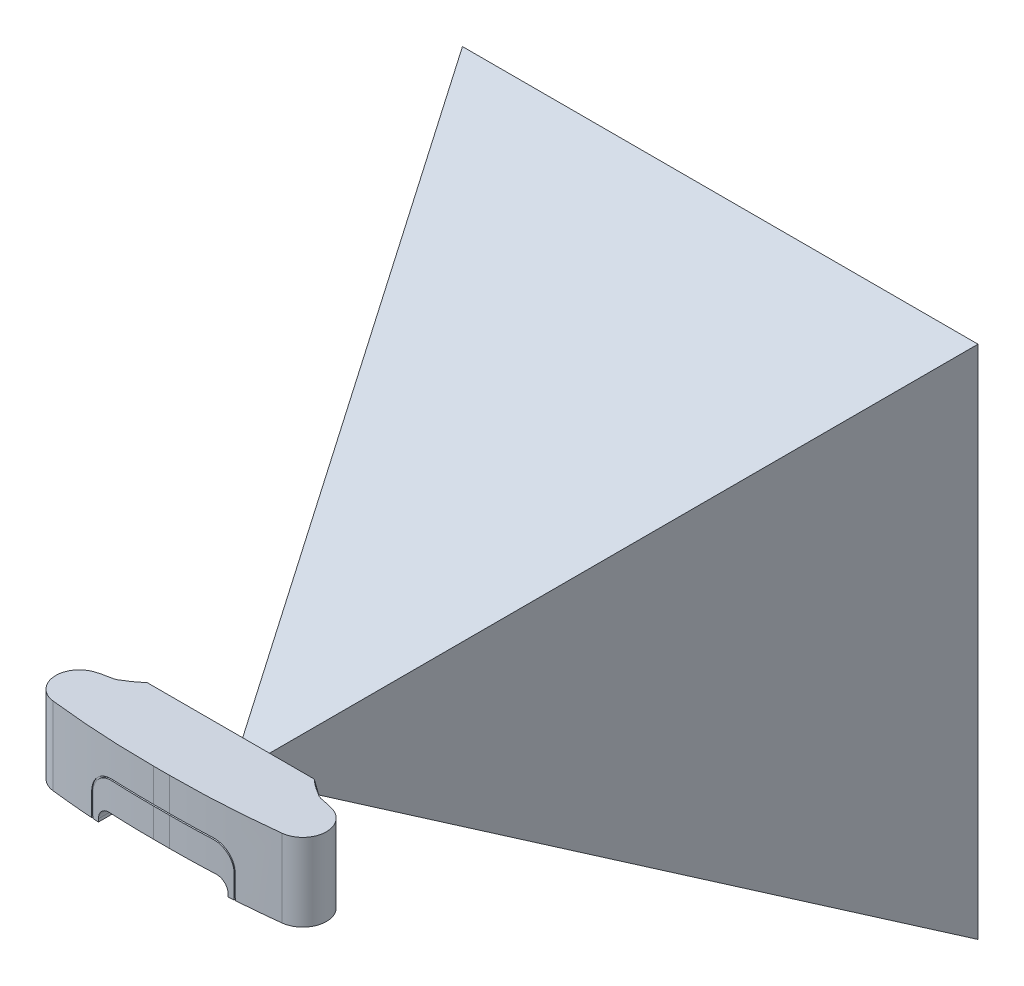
ISO-10303-21;
HEADER;
FILE_DESCRIPTION(('STEP AP214'),'2;1');
FILE_NAME('part.step','',(''),(''),'','','');
FILE_SCHEMA(('AUTOMOTIVE_DESIGN { 1 0 10303 214 1 1 1 1 }'));
ENDSEC;
DATA;
#1=APPLICATION_CONTEXT('core data for automotive mechanical design processes');
#2=APPLICATION_PROTOCOL_DEFINITION('international standard','automotive_design',2000,#1);
#3=PRODUCT_CONTEXT('',#1,'mechanical');
#4=PRODUCT('Part','Part','',(#3));
#5=PRODUCT_RELATED_PRODUCT_CATEGORY('part','',(#4));
#6=PRODUCT_DEFINITION_FORMATION('','',#4);
#7=PRODUCT_DEFINITION_CONTEXT('part definition',#1,'design');
#8=PRODUCT_DEFINITION('design','',#6,#7);
#9=PRODUCT_DEFINITION_SHAPE('','',#8);
#10=(LENGTH_UNIT() NAMED_UNIT(*) SI_UNIT(.MILLI.,.METRE.));
#11=(NAMED_UNIT(*) PLANE_ANGLE_UNIT() SI_UNIT($,.RADIAN.));
#12=(NAMED_UNIT(*) SI_UNIT($,.STERADIAN.) SOLID_ANGLE_UNIT());
#13=UNCERTAINTY_MEASURE_WITH_UNIT(LENGTH_MEASURE(1.E-05),#10,'distance_accuracy_value','');
#14=(GEOMETRIC_REPRESENTATION_CONTEXT(3) GLOBAL_UNCERTAINTY_ASSIGNED_CONTEXT((#13)) GLOBAL_UNIT_ASSIGNED_CONTEXT((#10,
#11,#12)) REPRESENTATION_CONTEXT('',''));
#15=CARTESIAN_POINT('',(0.,0.,0.));
#16=DIRECTION('',(0.,0.,1.));
#17=DIRECTION('',(1.,0.,0.));
#18=AXIS2_PLACEMENT_3D('',#15,#16,#17);
#19=CARTESIAN_POINT('',(0.,0.,-170.));
#20=DIRECTION('',(0.,0.,1.));
#21=DIRECTION('',(1.,0.,0.));
#22=AXIS2_PLACEMENT_3D('',#19,#20,#21);
#23=PLANE('',#22);
#24=DIRECTION('',(0.,1.,0.));
#25=VECTOR('',#24,1.);
#26=CARTESIAN_POINT('',(-39.5,-76.,-170.));
#27=LINE('',#26,#25);
#28=CARTESIAN_POINT('',(-39.5,-76.,-170.));
#29=VERTEX_POINT('',#28);
#30=CARTESIAN_POINT('',(-39.5,103.,-170.));
#31=VERTEX_POINT('',#30);
#32=EDGE_CURVE('E94',#29,#31,#27,.T.);
#33=ORIENTED_EDGE('',*,*,#32,.T.);
#34=DIRECTION('',(1.,0.,0.));
#35=VECTOR('',#34,1.);
#36=CARTESIAN_POINT('',(139.5,103.,-170.));
#37=LINE('',#36,#35);
#38=CARTESIAN_POINT('',(139.5,103.,-170.));
#39=VERTEX_POINT('',#38);
#40=EDGE_CURVE('E86',#31,#39,#37,.T.);
#41=ORIENTED_EDGE('',*,*,#40,.T.);
#42=DIRECTION('',(0.,-1.,0.));
#43=VECTOR('',#42,1.);
#44=CARTESIAN_POINT('',(139.5,-76.,-170.));
#45=LINE('',#44,#43);
#46=CARTESIAN_POINT('',(139.5,-76.,-170.));
#47=VERTEX_POINT('',#46);
#48=EDGE_CURVE('E65',#39,#47,#45,.T.);
#49=ORIENTED_EDGE('',*,*,#48,.T.);
#50=DIRECTION('',(-1.,0.,0.));
#51=VECTOR('',#50,1.);
#52=CARTESIAN_POINT('',(139.5,-76.,-170.));
#53=LINE('',#52,#51);
#54=EDGE_CURVE('E13',#47,#29,#53,.T.);
#55=ORIENTED_EDGE('',*,*,#54,.T.);
#56=EDGE_LOOP('',(#33,#41,#49,#55));
#57=FACE_BOUND('',#56,.T.);
#58=ADVANCED_FACE('F52',(#57),#23,.F.);
#59=CARTESIAN_POINT('',(39.1490168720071,0.,-20.610805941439));
#60=DIRECTION('',(0.88486176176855,0.,-0.465853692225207));
#61=DIRECTION('',(-0.465853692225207,0.,-0.88486176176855));
#62=AXIS2_PLACEMENT_3D('',#59,#60,#61);
#63=PLANE('',#62);
#64=DIRECTION('',(-0.422280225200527,0.422280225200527,-0.802096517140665));
#65=VECTOR('',#64,1.);
#66=CARTESIAN_POINT('',(50.,13.5,0.));
#67=LINE('',#66,#65);
#68=CARTESIAN_POINT('',(50.,13.5,0.));
#69=VERTEX_POINT('',#68);
#70=EDGE_CURVE('E90',#69,#31,#67,.T.);
#71=ORIENTED_EDGE('',*,*,#70,.T.);
#72=ORIENTED_EDGE('',*,*,#32,.F.);
#73=DIRECTION('',(-0.422280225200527,-0.422280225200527,-0.802096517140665));
#74=VECTOR('',#73,1.);
#75=CARTESIAN_POINT('',(50.,13.5,0.));
#76=LINE('',#75,#74);
#77=EDGE_CURVE('E102',#69,#29,#76,.T.);
#78=ORIENTED_EDGE('',*,*,#77,.F.);
#79=EDGE_LOOP('',(#71,#72,#78));
#80=FACE_BOUND('',#79,.T.);
#81=ADVANCED_FACE('F99',(#80),#63,.F.);
#82=CARTESIAN_POINT('',(0.,10.5702345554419,-5.56491760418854));
#83=DIRECTION('',(0.,0.88486176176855,-0.465853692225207));
#84=DIRECTION('',(0.,0.465853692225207,0.88486176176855));
#85=AXIS2_PLACEMENT_3D('',#82,#83,#84);
#86=PLANE('',#85);
#87=ORIENTED_EDGE('',*,*,#77,.T.);
#88=ORIENTED_EDGE('',*,*,#54,.F.);
#89=DIRECTION('',(0.422280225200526,-0.422280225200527,-0.802096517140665));
#90=VECTOR('',#89,1.);
#91=CARTESIAN_POINT('',(50.,13.5,0.));
#92=LINE('',#91,#90);
#93=EDGE_CURVE('E156',#69,#47,#92,.T.);
#94=ORIENTED_EDGE('',*,*,#93,.F.);
#95=EDGE_LOOP('',(#87,#88,#94));
#96=FACE_BOUND('',#95,.T.);
#97=ADVANCED_FACE('F139',(#96),#86,.F.);
#98=CARTESIAN_POINT('',(0.,10.5702345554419,5.56491760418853));
#99=DIRECTION('',(0.,-0.88486176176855,-0.465853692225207));
#100=DIRECTION('',(0.,0.465853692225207,-0.88486176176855));
#101=AXIS2_PLACEMENT_3D('',#98,#99,#100);
#102=PLANE('',#101);
#103=DIRECTION('',(0.422280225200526,0.422280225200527,-0.802096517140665));
#104=VECTOR('',#103,1.);
#105=CARTESIAN_POINT('',(50.,13.5,0.));
#106=LINE('',#105,#104);
#107=EDGE_CURVE('E92',#69,#39,#106,.T.);
#108=ORIENTED_EDGE('',*,*,#107,.T.);
#109=ORIENTED_EDGE('',*,*,#40,.F.);
#110=ORIENTED_EDGE('',*,*,#70,.F.);
#111=EDGE_LOOP('',(#108,#109,#110));
#112=FACE_BOUND('',#111,.T.);
#113=ADVANCED_FACE('F89',(#112),#102,.F.);
#114=CARTESIAN_POINT('',(39.1490168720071,0.,20.610805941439));
#115=DIRECTION('',(-0.88486176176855,0.,-0.465853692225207));
#116=DIRECTION('',(-0.465853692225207,0.,0.88486176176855));
#117=AXIS2_PLACEMENT_3D('',#114,#115,#116);
#118=PLANE('',#117);
#119=ORIENTED_EDGE('',*,*,#93,.T.);
#120=ORIENTED_EDGE('',*,*,#48,.F.);
#121=ORIENTED_EDGE('',*,*,#107,.F.);
#122=EDGE_LOOP('',(#119,#120,#121));
#123=FACE_BOUND('',#122,.T.);
#124=ADVANCED_FACE('F54',(#123),#118,.F.);
#125=CLOSED_SHELL('',(#58,#81,#97,#113,#124));
#126=MANIFOLD_SOLID_BREP('B2',#125);
#127=CARTESIAN_POINT('',(31.5,0.999999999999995,4.));
#128=DIRECTION('',(0.,0.,-1.));
#129=DIRECTION('',(-1.,0.,0.));
#130=AXIS2_PLACEMENT_3D('',#127,#128,#129);
#131=PLANE('',#130);
#132=DIRECTION('',(1.,0.,0.));
#133=VECTOR('',#132,1.);
#134=CARTESIAN_POINT('',(72.5,0.,4.));
#135=LINE('',#134,#133);
#136=CARTESIAN_POINT('',(27.5,0.,4.));
#137=VERTEX_POINT('',#136);
#138=CARTESIAN_POINT('',(72.5,0.,4.));
#139=VERTEX_POINT('',#138);
#140=EDGE_CURVE('E728',#137,#139,#135,.T.);
#141=ORIENTED_EDGE('',*,*,#140,.T.);
#142=DIRECTION('',(0.,1.,0.));
#143=VECTOR('',#142,1.);
#144=CARTESIAN_POINT('',(72.5,0.999999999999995,4.));
#145=LINE('',#144,#143);
#146=CARTESIAN_POINT('',(72.5,0.999999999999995,4.));
#147=VERTEX_POINT('',#146);
#148=EDGE_CURVE('E731',#139,#147,#145,.T.);
#149=ORIENTED_EDGE('',*,*,#148,.T.);
#150=CARTESIAN_POINT('',(68.5,0.999999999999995,4.));
#151=DIRECTION('',(0.,0.,1.));
#152=DIRECTION('',(-1.,0.,0.));
#153=AXIS2_PLACEMENT_3D('',#150,#151,#152);
#154=CIRCLE('',#153,4.);
#155=CARTESIAN_POINT('',(68.5,4.99999999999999,4.));
#156=VERTEX_POINT('',#155);
#157=EDGE_CURVE('E734',#147,#156,#154,.T.);
#158=ORIENTED_EDGE('',*,*,#157,.T.);
#159=DIRECTION('',(-1.,0.,0.));
#160=VECTOR('',#159,1.);
#161=CARTESIAN_POINT('',(31.5,5.,4.));
#162=LINE('',#161,#160);
#163=CARTESIAN_POINT('',(31.5,4.99999999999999,4.));
#164=VERTEX_POINT('',#163);
#165=EDGE_CURVE('E737',#156,#164,#162,.T.);
#166=ORIENTED_EDGE('',*,*,#165,.T.);
#167=CARTESIAN_POINT('',(31.5,0.999999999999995,4.));
#168=DIRECTION('',(0.,0.,1.));
#169=DIRECTION('',(-1.,0.,0.));
#170=AXIS2_PLACEMENT_3D('',#167,#168,#169);
#171=CIRCLE('',#170,4.);
#172=CARTESIAN_POINT('',(27.5,0.999999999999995,4.));
#173=VERTEX_POINT('',#172);
#174=EDGE_CURVE('E740',#164,#173,#171,.T.);
#175=ORIENTED_EDGE('',*,*,#174,.T.);
#176=DIRECTION('',(0.,-1.,0.));
#177=VECTOR('',#176,1.);
#178=CARTESIAN_POINT('',(27.5,0.,4.));
#179=LINE('',#178,#177);
#180=EDGE_CURVE('E743',#173,#137,#179,.T.);
#181=ORIENTED_EDGE('',*,*,#180,.T.);
#182=EDGE_LOOP('',(#141,#149,#158,#166,#175,#181));
#183=FACE_BOUND('',#182,.T.);
#184=DIRECTION('',(0.,-1.,0.));
#185=VECTOR('',#184,1.);
#186=CARTESIAN_POINT('',(39.,0.999999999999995,4.));
#187=LINE('',#186,#185);
#188=CARTESIAN_POINT('',(39.,3.99999999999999,4.));
#189=VERTEX_POINT('',#188);
#190=CARTESIAN_POINT('',(39.,0.999999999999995,4.));
#191=VERTEX_POINT('',#190);
#192=EDGE_CURVE('E628',#189,#191,#187,.T.);
#193=ORIENTED_EDGE('',*,*,#192,.F.);
#194=DIRECTION('',(-1.,0.,0.));
#195=VECTOR('',#194,1.);
#196=CARTESIAN_POINT('',(39.,3.99999999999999,4.));
#197=LINE('',#196,#195);
#198=CARTESIAN_POINT('',(61.,4.,4.));
#199=VERTEX_POINT('',#198);
#200=EDGE_CURVE('E635',#199,#189,#197,.T.);
#201=ORIENTED_EDGE('',*,*,#200,.F.);
#202=DIRECTION('',(0.,1.,0.));
#203=VECTOR('',#202,1.);
#204=CARTESIAN_POINT('',(61.,0.999999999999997,4.));
#205=LINE('',#204,#203);
#206=CARTESIAN_POINT('',(61.,0.999999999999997,4.));
#207=VERTEX_POINT('',#206);
#208=EDGE_CURVE('E646',#207,#199,#205,.T.);
#209=ORIENTED_EDGE('',*,*,#208,.F.);
#210=DIRECTION('',(1.,0.,0.));
#211=VECTOR('',#210,1.);
#212=CARTESIAN_POINT('',(39.,0.999999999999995,4.));
#213=LINE('',#212,#211);
#214=EDGE_CURVE('E642',#191,#207,#213,.T.);
#215=ORIENTED_EDGE('',*,*,#214,.F.);
#216=EDGE_LOOP('',(#193,#201,#209,#215));
#217=FACE_BOUND('',#216,.T.);
#218=ADVANCED_FACE('F239',(#183,#217),#131,.F.);
#219=CARTESIAN_POINT('',(0.,0.,24.));
#220=DIRECTION('',(0.,1.,0.));
#221=DIRECTION('',(0.,0.,1.));
#222=AXIS2_PLACEMENT_3D('',#219,#220,#221);
#223=PLANE('',#222);
#224=DIRECTION('',(0.,0.,1.));
#225=VECTOR('',#224,1.);
#226=CARTESIAN_POINT('',(25.5,0.,23.));
#227=LINE('',#226,#225);
#228=CARTESIAN_POINT('',(25.5,0.,3.5));
#229=VERTEX_POINT('',#228);
#230=CARTESIAN_POINT('',(25.5,0.,23.2669568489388));
#231=VERTEX_POINT('',#230);
#232=EDGE_CURVE('E796',#229,#231,#227,.T.);
#233=ORIENTED_EDGE('',*,*,#232,.F.);
#234=CARTESIAN_POINT('',(27.,0.,3.5));
#235=DIRECTION('',(0.,1.,0.));
#236=DIRECTION('',(0.,0.,1.));
#237=AXIS2_PLACEMENT_3D('',#234,#235,#236);
#238=CIRCLE('',#237,1.5);
#239=CARTESIAN_POINT('',(27.,0.,1.99999999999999));
#240=VERTEX_POINT('',#239);
#241=EDGE_CURVE('E659',#240,#229,#238,.T.);
#242=ORIENTED_EDGE('',*,*,#241,.F.);
#243=DIRECTION('',(-1.,0.,0.));
#244=VECTOR('',#243,1.);
#245=CARTESIAN_POINT('',(73.,0.,2.));
#246=LINE('',#245,#244);
#247=CARTESIAN_POINT('',(73.,0.,2.00000000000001));
#248=VERTEX_POINT('',#247);
#249=EDGE_CURVE('E703',#248,#240,#246,.T.);
#250=ORIENTED_EDGE('',*,*,#249,.F.);
#251=CARTESIAN_POINT('',(73.,0.,3.50000000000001));
#252=DIRECTION('',(0.,1.,0.));
#253=DIRECTION('',(0.,0.,1.));
#254=AXIS2_PLACEMENT_3D('',#251,#252,#253);
#255=CIRCLE('',#254,1.50000000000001);
#256=CARTESIAN_POINT('',(74.5,0.,3.50000000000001));
#257=VERTEX_POINT('',#256);
#258=EDGE_CURVE('E700',#257,#248,#255,.T.);
#259=ORIENTED_EDGE('',*,*,#258,.F.);
#260=DIRECTION('',(0.,0.,1.));
#261=VECTOR('',#260,1.);
#262=CARTESIAN_POINT('',(74.5,0.,23.));
#263=LINE('',#262,#261);
#264=CARTESIAN_POINT('',(74.5,0.,23.2669568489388));
#265=VERTEX_POINT('',#264);
#266=EDGE_CURVE('E818',#257,#265,#263,.T.);
#267=ORIENTED_EDGE('',*,*,#266,.T.);
#268=CARTESIAN_POINT('',(52.7849720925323,0.,-298.));
#269=DIRECTION('',(0.,1.,0.));
#270=DIRECTION('',(0.,0.,1.));
#271=AXIS2_PLACEMENT_3D('',#268,#269,#270);
#272=CIRCLE('',#271,322.);
#273=CARTESIAN_POINT('',(72.5,0.,23.3958893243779));
#274=VERTEX_POINT('',#273);
#275=EDGE_CURVE('E1124',#265,#274,#272,.F.);
#276=ORIENTED_EDGE('',*,*,#275,.T.);
#277=DIRECTION('',(0.,0.,1.));
#278=VECTOR('',#277,1.);
#279=CARTESIAN_POINT('',(72.5,0.,4.));
#280=LINE('',#279,#278);
#281=EDGE_CURVE('E746',#139,#274,#280,.T.);
#282=ORIENTED_EDGE('',*,*,#281,.F.);
#283=ORIENTED_EDGE('',*,*,#140,.F.);
#284=DIRECTION('',(0.,0.,1.));
#285=VECTOR('',#284,1.);
#286=CARTESIAN_POINT('',(27.5,0.,4.));
#287=LINE('',#286,#285);
#288=CARTESIAN_POINT('',(27.5,0.,23.3958893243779));
#289=VERTEX_POINT('',#288);
#290=EDGE_CURVE('E748',#137,#289,#287,.T.);
#291=ORIENTED_EDGE('',*,*,#290,.T.);
#292=CARTESIAN_POINT('',(47.2150279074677,0.,-298.));
#293=DIRECTION('',(0.,1.,0.));
#294=DIRECTION('',(0.,0.,1.));
#295=AXIS2_PLACEMENT_3D('',#292,#293,#294);
#296=CIRCLE('',#295,322.);
#297=EDGE_CURVE('E1103',#289,#231,#296,.F.);
#298=ORIENTED_EDGE('',*,*,#297,.T.);
#299=EDGE_LOOP('',(#233,#242,#250,#259,#267,#276,#282,#283,#291,#298));
#300=FACE_BOUND('',#299,.T.);
#301=ADVANCED_FACE('F1338',(#300),#223,.F.);
#302=CARTESIAN_POINT('',(32.5,8.,23.));
#303=DIRECTION('',(0.,0.,-1.));
#304=DIRECTION('',(-1.,0.,0.));
#305=AXIS2_PLACEMENT_3D('',#302,#303,#304);
#306=PLANE('',#305);
#307=DIRECTION('',(-1.,0.,0.));
#308=VECTOR('',#307,1.);
#309=CARTESIAN_POINT('',(75.,0.5,23.));
#310=LINE('',#309,#308);
#311=CARTESIAN_POINT('',(75.,0.5,23.));
#312=VERTEX_POINT('',#311);
#313=CARTESIAN_POINT('',(74.5,0.5,23.));
#314=VERTEX_POINT('',#313);
#315=EDGE_CURVE('E676',#312,#314,#310,.T.);
#316=ORIENTED_EDGE('',*,*,#315,.F.);
#317=DIRECTION('',(0.,1.,0.));
#318=VECTOR('',#317,1.);
#319=CARTESIAN_POINT('',(75.,0.,23.));
#320=LINE('',#319,#318);
#321=CARTESIAN_POINT('',(75.,8.00000000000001,23.));
#322=VERTEX_POINT('',#321);
#323=EDGE_CURVE('E782',#312,#322,#320,.T.);
#324=ORIENTED_EDGE('',*,*,#323,.T.);
#325=CARTESIAN_POINT('',(67.5,8.,23.));
#326=DIRECTION('',(0.,0.,1.));
#327=DIRECTION('',(1.,0.,0.));
#328=AXIS2_PLACEMENT_3D('',#325,#326,#327);
#329=CIRCLE('',#328,7.49999999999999);
#330=CARTESIAN_POINT('',(67.5,15.5,23.));
#331=VERTEX_POINT('',#330);
#332=EDGE_CURVE('E784',#322,#331,#329,.T.);
#333=ORIENTED_EDGE('',*,*,#332,.T.);
#334=DIRECTION('',(-1.,0.,0.));
#335=VECTOR('',#334,1.);
#336=CARTESIAN_POINT('',(32.5,15.5,23.));
#337=LINE('',#336,#335);
#338=CARTESIAN_POINT('',(32.5,15.5,23.));
#339=VERTEX_POINT('',#338);
#340=EDGE_CURVE('E787',#331,#339,#337,.T.);
#341=ORIENTED_EDGE('',*,*,#340,.T.);
#342=CARTESIAN_POINT('',(32.5,8.,23.));
#343=DIRECTION('',(0.,0.,1.));
#344=DIRECTION('',(-1.,0.,0.));
#345=AXIS2_PLACEMENT_3D('',#342,#343,#344);
#346=CIRCLE('',#345,7.5);
#347=CARTESIAN_POINT('',(25.,8.,23.));
#348=VERTEX_POINT('',#347);
#349=EDGE_CURVE('E790',#339,#348,#346,.T.);
#350=ORIENTED_EDGE('',*,*,#349,.T.);
#351=DIRECTION('',(0.,-1.,0.));
#352=VECTOR('',#351,1.);
#353=CARTESIAN_POINT('',(25.,0.,23.));
#354=LINE('',#353,#352);
#355=CARTESIAN_POINT('',(25.,0.5,23.));
#356=VERTEX_POINT('',#355);
#357=EDGE_CURVE('E793',#348,#356,#354,.T.);
#358=ORIENTED_EDGE('',*,*,#357,.T.);
#359=DIRECTION('',(-1.,0.,0.));
#360=VECTOR('',#359,1.);
#361=CARTESIAN_POINT('',(25.5,0.5,23.));
#362=LINE('',#361,#360);
#363=CARTESIAN_POINT('',(25.5,0.5,23.));
#364=VERTEX_POINT('',#363);
#365=EDGE_CURVE('E658',#364,#356,#362,.T.);
#366=ORIENTED_EDGE('',*,*,#365,.F.);
#367=DIRECTION('',(0.,1.,0.));
#368=VECTOR('',#367,1.);
#369=CARTESIAN_POINT('',(25.5,8.,23.));
#370=LINE('',#369,#368);
#371=CARTESIAN_POINT('',(25.5,8.,23.));
#372=VERTEX_POINT('',#371);
#373=EDGE_CURVE('E767',#364,#372,#370,.T.);
#374=ORIENTED_EDGE('',*,*,#373,.T.);
#375=CARTESIAN_POINT('',(32.5,8.,23.));
#376=DIRECTION('',(0.,0.,-1.));
#377=DIRECTION('',(1.,0.,0.));
#378=AXIS2_PLACEMENT_3D('',#375,#376,#377);
#379=CIRCLE('',#378,6.99999999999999);
#380=CARTESIAN_POINT('',(32.5,15.,23.));
#381=VERTEX_POINT('',#380);
#382=EDGE_CURVE('E769',#372,#381,#379,.T.);
#383=ORIENTED_EDGE('',*,*,#382,.T.);
#384=DIRECTION('',(1.,0.,0.));
#385=VECTOR('',#384,1.);
#386=CARTESIAN_POINT('',(67.5,15.,23.));
#387=LINE('',#386,#385);
#388=CARTESIAN_POINT('',(67.5,15.,23.));
#389=VERTEX_POINT('',#388);
#390=EDGE_CURVE('E773',#381,#389,#387,.T.);
#391=ORIENTED_EDGE('',*,*,#390,.T.);
#392=CARTESIAN_POINT('',(67.5,8.,23.));
#393=DIRECTION('',(0.,0.,-1.));
#394=DIRECTION('',(-1.,0.,0.));
#395=AXIS2_PLACEMENT_3D('',#392,#393,#394);
#396=CIRCLE('',#395,6.99999999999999);
#397=CARTESIAN_POINT('',(74.5,8.00000000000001,23.));
#398=VERTEX_POINT('',#397);
#399=EDGE_CURVE('E776',#389,#398,#396,.T.);
#400=ORIENTED_EDGE('',*,*,#399,.T.);
#401=DIRECTION('',(0.,-1.,0.));
#402=VECTOR('',#401,1.);
#403=CARTESIAN_POINT('',(74.5,8.00000000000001,23.));
#404=LINE('',#403,#402);
#405=EDGE_CURVE('E779',#398,#314,#404,.T.);
#406=ORIENTED_EDGE('',*,*,#405,.T.);
#407=EDGE_LOOP('',(#316,#324,#333,#341,#350,#358,#366,#374,#383,#391,#400,#406));
#408=FACE_BOUND('',#407,.T.);
#409=ADVANCED_FACE('F1270',(#408),#306,.F.);
#410=CARTESIAN_POINT('',(0.,0.,24.));
#411=DIRECTION('',(0.,0.,-1.));
#412=DIRECTION('',(-1.,0.,0.));
#413=AXIS2_PLACEMENT_3D('',#410,#411,#412);
#414=PLANE('',#413);
#415=DIRECTION('',(0.,1.,0.));
#416=VECTOR('',#415,1.);
#417=CARTESIAN_POINT('',(47.2150279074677,0.,24.));
#418=LINE('',#417,#416);
#419=CARTESIAN_POINT('',(47.2150279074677,27.,24.));
#420=VERTEX_POINT('',#419);
#421=CARTESIAN_POINT('',(47.2150279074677,15.5,24.));
#422=VERTEX_POINT('',#421);
#423=EDGE_CURVE('E1099',#420,#422,#418,.F.);
#424=ORIENTED_EDGE('',*,*,#423,.T.);
#425=DIRECTION('',(-1.,0.,0.));
#426=VECTOR('',#425,1.);
#427=CARTESIAN_POINT('',(32.5,15.5,24.));
#428=LINE('',#427,#426);
#429=CARTESIAN_POINT('',(52.7849720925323,15.5,24.));
#430=VERTEX_POINT('',#429);
#431=EDGE_CURVE('E770',#430,#422,#428,.T.);
#432=ORIENTED_EDGE('',*,*,#431,.F.);
#433=DIRECTION('',(0.,1.,0.));
#434=VECTOR('',#433,1.);
#435=CARTESIAN_POINT('',(52.7849720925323,0.,24.));
#436=LINE('',#435,#434);
#437=CARTESIAN_POINT('',(52.7849720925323,27.,24.));
#438=VERTEX_POINT('',#437);
#439=EDGE_CURVE('E1118',#430,#438,#436,.T.);
#440=ORIENTED_EDGE('',*,*,#439,.T.);
#441=DIRECTION('',(-1.,0.,0.));
#442=VECTOR('',#441,1.);
#443=CARTESIAN_POINT('',(0.,27.,24.));
#444=LINE('',#443,#442);
#445=EDGE_CURVE('E1088',#438,#420,#444,.T.);
#446=ORIENTED_EDGE('',*,*,#445,.T.);
#447=EDGE_LOOP('',(#424,#432,#440,#446));
#448=FACE_BOUND('',#447,.T.);
#449=ADVANCED_FACE('F1279',(#448),#414,.F.);
#450=CARTESIAN_POINT('',(47.2150279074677,13.5,-298.));
#451=DIRECTION('',(0.,1.,0.));
#452=DIRECTION('',(0.,0.,1.));
#453=AXIS2_PLACEMENT_3D('',#450,#451,#452);
#454=CYLINDRICAL_SURFACE('',#453,322.);
#455=DIRECTION('',(0.,1.,0.));
#456=VECTOR('',#455,1.);
#457=CARTESIAN_POINT('',(25.,13.5,23.232770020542));
#458=LINE('',#457,#456);
#459=CARTESIAN_POINT('',(25.,8.,23.232770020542));
#460=VERTEX_POINT('',#459);
#461=CARTESIAN_POINT('',(25.,0.,23.232770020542));
#462=VERTEX_POINT('',#461);
#463=EDGE_CURVE('E1241',#460,#462,#458,.F.);
#464=ORIENTED_EDGE('',*,*,#463,.F.);
#465=CARTESIAN_POINT('',(32.5,15.5,23.6635943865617));
#466=CARTESIAN_POINT('',(32.2887789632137,15.500022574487,23.6539338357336));
#467=CARTESIAN_POINT('',(32.0775712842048,15.4910780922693,23.6440612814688));
#468=CARTESIAN_POINT('',(31.6566875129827,15.4554231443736,23.6239762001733));
#469=CARTESIAN_POINT('',(31.4470113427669,15.4287135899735,23.6137636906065));
#470=CARTESIAN_POINT('',(31.0308299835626,15.3577232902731,23.5930894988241));
#471=CARTESIAN_POINT('',(30.8243225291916,15.3134557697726,23.5826280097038));
#472=CARTESIAN_POINT('',(30.4157842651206,15.2076737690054,23.5615450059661));
#473=CARTESIAN_POINT('',(30.2137534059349,15.1461594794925,23.5509234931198));
#474=CARTESIAN_POINT('',(29.8155419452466,15.0062995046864,23.5296217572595));
#475=CARTESIAN_POINT('',(29.6193630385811,14.9279489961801,23.5189415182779));
#476=CARTESIAN_POINT('',(29.2342370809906,14.7549515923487,23.4976335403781));
#477=CARTESIAN_POINT('',(29.0452927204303,14.6602987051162,23.4870058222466));
#478=CARTESIAN_POINT('',(28.6761219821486,14.4554245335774,23.4659284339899));
#479=CARTESIAN_POINT('',(28.4958924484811,14.3452089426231,23.455478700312));
#480=CARTESIAN_POINT('',(28.1453545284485,14.1099605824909,23.4348742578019));
#481=CARTESIAN_POINT('',(27.975046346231,13.98492750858,23.4247195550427));
#482=CARTESIAN_POINT('',(27.6455565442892,13.7209218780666,23.4048273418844));
#483=CARTESIAN_POINT('',(27.4863756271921,13.5819484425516,23.3950898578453));
#484=CARTESIAN_POINT('',(27.180286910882,13.2910519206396,23.3761544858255));
#485=CARTESIAN_POINT('',(27.0333791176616,13.1391288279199,23.3669565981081));
#486=CARTESIAN_POINT('',(26.7528578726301,12.823376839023,23.3492171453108));
#487=CARTESIAN_POINT('',(26.6192471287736,12.659545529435,23.3406757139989));
#488=CARTESIAN_POINT('',(26.3663143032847,12.3211708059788,23.3243644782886));
#489=CARTESIAN_POINT('',(26.2469918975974,12.1466276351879,23.316594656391));
#490=CARTESIAN_POINT('',(26.0235885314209,11.788224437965,23.3019380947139));
#491=CARTESIAN_POINT('',(25.9194941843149,11.6043727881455,23.2950505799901));
#492=CARTESIAN_POINT('',(25.7272054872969,11.2285892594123,23.2822478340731));
#493=CARTESIAN_POINT('',(25.6390053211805,11.0366603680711,23.2763322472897));
#494=CARTESIAN_POINT('',(25.4791178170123,10.6460761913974,23.2655547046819));
#495=CARTESIAN_POINT('',(25.4074253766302,10.4474230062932,23.2606924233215));
#496=CARTESIAN_POINT('',(25.2810545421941,10.0448362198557,23.2520891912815));
#497=CARTESIAN_POINT('',(25.2263719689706,9.84090392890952,23.248347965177));
#498=CARTESIAN_POINT('',(25.1204648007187,9.36671879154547,23.2410838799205));
#499=CARTESIAN_POINT('',(25.0752926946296,9.09506920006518,23.2379696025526));
#500=CARTESIAN_POINT('',(25.0301227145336,8.68543385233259,23.2348520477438));
#501=CARTESIAN_POINT('',(25.0188307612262,8.54859759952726,23.2340718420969));
#502=CARTESIAN_POINT('',(25.0037702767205,8.27451863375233,23.2330307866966));
#503=CARTESIAN_POINT('',(25.0000012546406,8.13727594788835,23.2327699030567));
#504=CARTESIAN_POINT('',(25.,8.,23.232770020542));
#505=B_SPLINE_CURVE_WITH_KNOTS('',3,(#465,#466,#467,#468,#469,#470,#471,#472,#473,#474,#475,
#476,#477,#478,#479,#480,#481,#482,#483,#484,#485,#486,#487,#488,#489,#490,#491,#492,#493,#494,
#495,#496,#497,#498,#499,#500,#501,#502,#503,#504),.UNSPECIFIED.,.F.,.F.,(4,2,2,2,2,2,2,2,2,2,2,
2,2,2,2,2,2,2,2,4),(0.,0.634131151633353,1.26822977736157,1.90185169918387,2.53546661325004,
3.16926328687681,3.80329341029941,4.43709218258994,5.07090399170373,5.70475578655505,
6.3386078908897,6.97258881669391,7.60655536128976,8.23996120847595,8.87313479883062,
9.50611241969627,10.1389344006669,10.963230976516,11.3749673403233,11.7866768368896),.UNSPECIFIED.);
#506=CARTESIAN_POINT('',(32.5,15.5,23.6635943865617));
#507=VERTEX_POINT('',#506);
#508=EDGE_CURVE('E1190',#507,#460,#505,.T.);
#509=ORIENTED_EDGE('',*,*,#508,.F.);
#510=CARTESIAN_POINT('',(47.2150279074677,15.5,-298.));
#511=DIRECTION('',(0.,1.,0.));
#512=DIRECTION('',(-1.,0.,0.));
#513=AXIS2_PLACEMENT_3D('',#510,#511,#512);
#514=CIRCLE('',#513,322.);
#515=EDGE_CURVE('E836',#422,#507,#514,.F.);
#516=ORIENTED_EDGE('',*,*,#515,.F.);
#517=ORIENTED_EDGE('',*,*,#423,.F.);
#518=CARTESIAN_POINT('',(47.2150279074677,27.,-298.));
#519=DIRECTION('',(0.,-1.,0.));
#520=DIRECTION('',(0.,0.,-1.));
#521=AXIS2_PLACEMENT_3D('',#518,#519,#520);
#522=CIRCLE('',#521,322.);
#523=CARTESIAN_POINT('',(10.2657741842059,27.,21.8730258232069));
#524=VERTEX_POINT('',#523);
#525=EDGE_CURVE('E1105',#524,#420,#522,.F.);
#526=ORIENTED_EDGE('',*,*,#525,.F.);
#527=DIRECTION('',(0.,1.,0.));
#528=VECTOR('',#527,1.);
#529=CARTESIAN_POINT('',(10.2657741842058,13.5,21.8730258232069));
#530=LINE('',#529,#528);
#531=CARTESIAN_POINT('',(10.2657741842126,0.,21.8730258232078));
#532=VERTEX_POINT('',#531);
#533=EDGE_CURVE('E1113',#524,#532,#530,.F.);
#534=ORIENTED_EDGE('',*,*,#533,.T.);
#535=EDGE_CURVE('E1102',#462,#532,#296,.F.);
#536=ORIENTED_EDGE('',*,*,#535,.F.);
#537=EDGE_LOOP('',(#464,#509,#516,#517,#526,#534,#536));
#538=FACE_BOUND('',#537,.T.);
#539=ADVANCED_FACE('F1202',(#538),#454,.T.);
#540=CARTESIAN_POINT('',(52.7849720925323,13.5,-298.));
#541=DIRECTION('',(0.,1.,0.));
#542=DIRECTION('',(0.,0.,1.));
#543=AXIS2_PLACEMENT_3D('',#540,#541,#542);
#544=CYLINDRICAL_SURFACE('',#543,322.);
#545=CARTESIAN_POINT('',(52.7849720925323,15.5,-298.));
#546=DIRECTION('',(0.,1.,0.));
#547=DIRECTION('',(-1.,0.,0.));
#548=AXIS2_PLACEMENT_3D('',#545,#546,#547);
#549=CIRCLE('',#548,322.);
#550=CARTESIAN_POINT('',(67.5,15.5,23.6635943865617));
#551=VERTEX_POINT('',#550);
#552=EDGE_CURVE('E2150',#551,#430,#549,.F.);
#553=ORIENTED_EDGE('',*,*,#552,.F.);
#554=CARTESIAN_POINT('',(75.,8.00000000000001,23.232770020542));
#555=CARTESIAN_POINT('',(75.0000229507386,8.21061574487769,23.2327668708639));
#556=CARTESIAN_POINT('',(74.9911291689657,8.42122798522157,23.233383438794));
#557=CARTESIAN_POINT('',(74.9556740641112,8.84094201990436,23.2358332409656));
#558=CARTESIAN_POINT('',(74.9291136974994,9.05004389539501,23.2376664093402));
#559=CARTESIAN_POINT('',(74.858520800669,9.46508352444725,23.242524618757));
#560=CARTESIAN_POINT('',(74.8145028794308,9.67102377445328,23.2455486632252));
#561=CARTESIAN_POINT('',(74.7093194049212,10.0784543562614,23.2527444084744));
#562=CARTESIAN_POINT('',(74.64815403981,10.2799447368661,23.2569160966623));
#563=CARTESIAN_POINT('',(74.5090943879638,10.6771024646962,23.2663495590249));
#564=CARTESIAN_POINT('',(74.4311955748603,10.8727682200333,23.2716116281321));
#565=CARTESIAN_POINT('',(74.2592065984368,11.2569045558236,23.2831534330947));
#566=CARTESIAN_POINT('',(74.1651104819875,11.4453724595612,23.2894335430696));
#567=CARTESIAN_POINT('',(73.9614560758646,11.8136392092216,23.3029208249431));
#568=CARTESIAN_POINT('',(73.8519031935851,11.993441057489,23.3101276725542));
#569=CARTESIAN_POINT('',(73.6180897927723,12.3431814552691,23.3253723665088));
#570=CARTESIAN_POINT('',(73.4938289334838,12.513119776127,23.3334102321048));
#571=CARTESIAN_POINT('',(73.231325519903,12.8421329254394,23.3502200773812));
#572=CARTESIAN_POINT('',(73.0930660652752,13.0011942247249,23.3589929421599));
#573=CARTESIAN_POINT('',(72.8036758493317,13.3071041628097,23.3771499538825));
#574=CARTESIAN_POINT('',(72.652545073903,13.4539527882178,23.3865341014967));
#575=CARTESIAN_POINT('',(72.3384519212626,13.7344331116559,23.4057967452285));
#576=CARTESIAN_POINT('',(72.1754870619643,13.8680620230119,23.4156753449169));
#577=CARTESIAN_POINT('',(71.838912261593,14.1211249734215,23.4358035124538));
#578=CARTESIAN_POINT('',(71.6653025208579,14.2405592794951,23.4460530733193));
#579=CARTESIAN_POINT('',(71.3082328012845,14.4646654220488,23.4668270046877));
#580=CARTESIAN_POINT('',(71.1247501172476,14.5693010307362,23.4773519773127));
#581=CARTESIAN_POINT('',(70.7496922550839,14.7626921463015,23.4985289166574));
#582=CARTESIAN_POINT('',(70.5581200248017,14.8514533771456,23.509180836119));
#583=CARTESIAN_POINT('',(70.1682232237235,15.012492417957,23.5304972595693));
#584=CARTESIAN_POINT('',(69.9699005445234,15.0847748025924,23.5411617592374));
#585=CARTESIAN_POINT('',(69.5679436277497,15.2123567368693,23.5623927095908));
#586=CARTESIAN_POINT('',(69.3643106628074,15.2676603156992,23.5729591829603));
#587=CARTESIAN_POINT('',(68.8866544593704,15.3759665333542,23.5972789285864));
#588=CARTESIAN_POINT('',(68.6111114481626,15.4224739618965,23.6109608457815));
#589=CARTESIAN_POINT('',(68.1955244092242,15.468982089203,23.6310528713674));
#590=CARTESIAN_POINT('',(68.0566850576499,15.4806092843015,23.6376752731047));
#591=CARTESIAN_POINT('',(67.7785767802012,15.4961172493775,23.6507596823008));
#592=CARTESIAN_POINT('',(67.6393078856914,15.4999985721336,23.6572217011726));
#593=CARTESIAN_POINT('',(67.5,15.5,23.6635943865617));
#594=B_SPLINE_CURVE_WITH_KNOTS('',3,(#554,#555,#556,#557,#558,#559,#560,#561,#562,#563,#564,
#565,#566,#567,#568,#569,#570,#571,#572,#573,#574,#575,#576,#577,#578,#579,#580,#581,#582,#583,
#584,#585,#586,#587,#588,#589,#590,#591,#592,#593),.UNSPECIFIED.,.F.,.F.,(4,2,2,2,2,2,2,2,2,2,2,
2,2,2,2,2,2,2,2,4),(0.,0.631653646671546,1.26327309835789,1.89436510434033,2.52545018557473,
3.15670618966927,3.78819470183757,4.41946283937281,5.05074560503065,5.6827998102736,
6.31485470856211,6.94704255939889,7.57921851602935,8.2129162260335,8.84638497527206,
9.47967765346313,10.1128199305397,10.9501712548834,11.368438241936,11.7866753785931),.UNSPECIFIED.);
#595=CARTESIAN_POINT('',(75.,8.00000000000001,23.232770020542));
#596=VERTEX_POINT('',#595);
#597=EDGE_CURVE('E2152',#596,#551,#594,.T.);
#598=ORIENTED_EDGE('',*,*,#597,.F.);
#599=DIRECTION('',(0.,1.,0.));
#600=VECTOR('',#599,1.);
#601=CARTESIAN_POINT('',(75.,13.5,23.232770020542));
#602=LINE('',#601,#600);
#603=CARTESIAN_POINT('',(75.,0.,23.232770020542));
#604=VERTEX_POINT('',#603);
#605=EDGE_CURVE('E2153',#604,#596,#602,.T.);
#606=ORIENTED_EDGE('',*,*,#605,.F.);
#607=CARTESIAN_POINT('',(89.7342258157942,0.,21.873025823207));
#608=VERTEX_POINT('',#607);
#609=EDGE_CURVE('E1125',#608,#604,#272,.F.);
#610=ORIENTED_EDGE('',*,*,#609,.F.);
#611=DIRECTION('',(0.,1.,0.));
#612=VECTOR('',#611,1.);
#613=CARTESIAN_POINT('',(89.7342258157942,13.5,21.8730258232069));
#614=LINE('',#613,#612);
#615=CARTESIAN_POINT('',(89.7342258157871,27.,21.8730258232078));
#616=VERTEX_POINT('',#615);
#617=EDGE_CURVE('E1128',#608,#616,#614,.T.);
#618=ORIENTED_EDGE('',*,*,#617,.T.);
#619=CARTESIAN_POINT('',(52.7849720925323,27.,-298.));
#620=DIRECTION('',(0.,-1.,0.));
#621=DIRECTION('',(0.,0.,-1.));
#622=AXIS2_PLACEMENT_3D('',#619,#620,#621);
#623=CIRCLE('',#622,322.);
#624=EDGE_CURVE('E1121',#438,#616,#623,.F.);
#625=ORIENTED_EDGE('',*,*,#624,.F.);
#626=ORIENTED_EDGE('',*,*,#439,.F.);
#627=EDGE_LOOP('',(#553,#598,#606,#610,#618,#625,#626));
#628=FACE_BOUND('',#627,.T.);
#629=ADVANCED_FACE('F1821',(#628),#544,.T.);
#630=CARTESIAN_POINT('',(50.,13.5,4.75));
#631=DIRECTION('',(0.,0.,-1.));
#632=DIRECTION('',(-1.,0.,0.));
#633=AXIS2_PLACEMENT_3D('',#630,#631,#632);
#634=PLANE('',#633);
#635=CARTESIAN_POINT('',(50.,13.5,4.75));
#636=DIRECTION('',(0.,0.,-1.));
#637=DIRECTION('',(-1.,0.,0.));
#638=AXIS2_PLACEMENT_3D('',#635,#636,#637);
#639=CIRCLE('',#638,3.5);
#640=CARTESIAN_POINT('',(50.,17.,4.75));
#641=VERTEX_POINT('',#640);
#642=CARTESIAN_POINT('',(50.,9.99999999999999,4.75));
#643=VERTEX_POINT('',#642);
#644=EDGE_CURVE('E838',#641,#643,#639,.T.);
#645=ORIENTED_EDGE('',*,*,#644,.F.);
#646=DIRECTION('',(1.,0.,0.));
#647=VECTOR('',#646,1.);
#648=CARTESIAN_POINT('',(53.5707142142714,17.,4.75));
#649=LINE('',#648,#647);
#650=CARTESIAN_POINT('',(53.5707142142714,17.,4.75));
#651=VERTEX_POINT('',#650);
#652=EDGE_CURVE('E856',#641,#651,#649,.T.);
#653=ORIENTED_EDGE('',*,*,#652,.T.);
#654=CARTESIAN_POINT('',(50.,13.5,4.75));
#655=DIRECTION('',(0.,0.,-1.));
#656=DIRECTION('',(-1.,0.,0.));
#657=AXIS2_PLACEMENT_3D('',#654,#655,#656);
#658=CIRCLE('',#657,5.);
#659=CARTESIAN_POINT('',(53.5707142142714,9.99999999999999,4.75));
#660=VERTEX_POINT('',#659);
#661=EDGE_CURVE('E845',#651,#660,#658,.T.);
#662=ORIENTED_EDGE('',*,*,#661,.T.);
#663=DIRECTION('',(-1.,0.,0.));
#664=VECTOR('',#663,1.);
#665=CARTESIAN_POINT('',(46.4292857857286,9.99999999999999,4.75));
#666=LINE('',#665,#664);
#667=EDGE_CURVE('E850',#660,#643,#666,.T.);
#668=ORIENTED_EDGE('',*,*,#667,.T.);
#669=EDGE_LOOP('',(#645,#653,#662,#668));
#670=FACE_BOUND('',#669,.T.);
#671=ADVANCED_FACE('F1568',(#670),#634,.T.);
#672=CARTESIAN_POINT('',(50.,13.5,1.));
#673=DIRECTION('',(0.,0.,-1.));
#674=DIRECTION('',(-1.,0.,0.));
#675=AXIS2_PLACEMENT_3D('',#672,#673,#674);
#676=PLANE('',#675);
#677=CARTESIAN_POINT('',(50.,13.5,1.));
#678=DIRECTION('',(0.,0.,1.));
#679=DIRECTION('',(-1.,0.,0.));
#680=AXIS2_PLACEMENT_3D('',#677,#678,#679);
#681=CIRCLE('',#680,15.5);
#682=CARTESIAN_POINT('',(40.1892915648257,25.5,1.));
#683=VERTEX_POINT('',#682);
#684=CARTESIAN_POINT('',(40.1892915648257,1.5,1.));
#685=VERTEX_POINT('',#684);
#686=EDGE_CURVE('E894',#683,#685,#681,.T.);
#687=ORIENTED_EDGE('',*,*,#686,.F.);
#688=DIRECTION('',(1.,0.,0.));
#689=VECTOR('',#688,1.);
#690=CARTESIAN_POINT('',(78.0401497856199,25.5,1.));
#691=LINE('',#690,#689);
#692=CARTESIAN_POINT('',(59.8107084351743,25.5,1.));
#693=VERTEX_POINT('',#692);
#694=EDGE_CURVE('E973',#683,#693,#691,.T.);
#695=ORIENTED_EDGE('',*,*,#694,.T.);
#696=CARTESIAN_POINT('',(50.,13.5,1.));
#697=DIRECTION('',(0.,0.,1.));
#698=DIRECTION('',(-1.,0.,0.));
#699=AXIS2_PLACEMENT_3D('',#696,#697,#698);
#700=CIRCLE('',#699,15.5);
#701=CARTESIAN_POINT('',(59.8107084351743,1.5,1.));
#702=VERTEX_POINT('',#701);
#703=EDGE_CURVE('E927',#702,#693,#700,.T.);
#704=ORIENTED_EDGE('',*,*,#703,.F.);
#705=DIRECTION('',(-1.,0.,0.));
#706=VECTOR('',#705,1.);
#707=CARTESIAN_POINT('',(21.9598502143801,1.5,1.));
#708=LINE('',#707,#706);
#709=EDGE_CURVE('E965',#702,#685,#708,.T.);
#710=ORIENTED_EDGE('',*,*,#709,.T.);
#711=EDGE_LOOP('',(#687,#695,#704,#710));
#712=FACE_BOUND('',#711,.T.);
#713=CARTESIAN_POINT('',(50.,13.5,1.));
#714=DIRECTION('',(0.,0.,-1.));
#715=DIRECTION('',(-1.,0.,0.));
#716=AXIS2_PLACEMENT_3D('',#713,#714,#715);
#717=CIRCLE('',#716,9.5);
#718=CARTESIAN_POINT('',(40.5,13.5,1.));
#719=VERTEX_POINT('',#718);
#720=EDGE_CURVE('E942',#719,#719,#717,.T.);
#721=ORIENTED_EDGE('',*,*,#720,.F.);
#722=EDGE_LOOP('',(#721));
#723=FACE_BOUND('',#722,.T.);
#724=ADVANCED_FACE('F1725',(#712,#723),#676,.T.);
#725=CARTESIAN_POINT('',(50.,13.5,1.));
#726=DIRECTION('',(0.,0.,-1.));
#727=DIRECTION('',(-1.,0.,0.));
#728=AXIS2_PLACEMENT_3D('',#725,#726,#727);
#729=CIRCLE('',#728,16.);
#730=CARTESIAN_POINT('',(60.5830052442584,25.5,1.));
#731=VERTEX_POINT('',#730);
#732=CARTESIAN_POINT('',(60.5830052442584,1.49999999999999,1.));
#733=VERTEX_POINT('',#732);
#734=EDGE_CURVE('E916',#731,#733,#729,.T.);
#735=ORIENTED_EDGE('',*,*,#734,.F.);
#736=CARTESIAN_POINT('',(78.0401497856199,25.5,1.));
#737=VERTEX_POINT('',#736);
#738=EDGE_CURVE('E968',#731,#737,#691,.T.);
#739=ORIENTED_EDGE('',*,*,#738,.T.);
#740=CARTESIAN_POINT('',(50.,13.5,1.));
#741=DIRECTION('',(0.,0.,-1.));
#742=DIRECTION('',(-1.,0.,0.));
#743=AXIS2_PLACEMENT_3D('',#740,#741,#742);
#744=CIRCLE('',#743,30.5);
#745=CARTESIAN_POINT('',(78.0401497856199,1.49999999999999,1.));
#746=VERTEX_POINT('',#745);
#747=EDGE_CURVE('E956',#737,#746,#744,.T.);
#748=ORIENTED_EDGE('',*,*,#747,.T.);
#749=EDGE_CURVE('E961',#746,#733,#708,.T.);
#750=ORIENTED_EDGE('',*,*,#749,.T.);
#751=EDGE_LOOP('',(#735,#739,#748,#750));
#752=FACE_BOUND('',#751,.T.);
#753=ADVANCED_FACE('F1726',(#752),#676,.T.);
#754=DIRECTION('',(0.,0.,1.));
#755=VECTOR('',#754,1.);
#756=CARTESIAN_POINT('',(75.,0.,23.));
#757=LINE('',#756,#755);
#758=CARTESIAN_POINT('',(75.,0.,3.5));
#759=VERTEX_POINT('',#758);
#760=EDGE_CURVE('E816',#759,#604,#757,.T.);
#761=ORIENTED_EDGE('',*,*,#760,.F.);
#762=CARTESIAN_POINT('',(73.,0.,3.50000000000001));
#763=DIRECTION('',(0.,-1.,0.));
#764=DIRECTION('',(0.,0.,-1.));
#765=AXIS2_PLACEMENT_3D('',#762,#763,#764);
#766=CIRCLE('',#765,1.99999999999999);
#767=CARTESIAN_POINT('',(73.,0.,1.50000000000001));
#768=VERTEX_POINT('',#767);
#769=EDGE_CURVE('E697',#768,#759,#766,.T.);
#770=ORIENTED_EDGE('',*,*,#769,.F.);
#771=DIRECTION('',(1.,0.,0.));
#772=VECTOR('',#771,1.);
#773=CARTESIAN_POINT('',(27.,0.,1.49999999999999));
#774=LINE('',#773,#772);
#775=CARTESIAN_POINT('',(27.,0.,1.5));
#776=VERTEX_POINT('',#775);
#777=EDGE_CURVE('E694',#776,#768,#774,.T.);
#778=ORIENTED_EDGE('',*,*,#777,.F.);
#779=CARTESIAN_POINT('',(27.,0.,3.5));
#780=DIRECTION('',(0.,-1.,0.));
#781=DIRECTION('',(0.,0.,-1.));
#782=AXIS2_PLACEMENT_3D('',#779,#780,#781);
#783=CIRCLE('',#782,2.);
#784=CARTESIAN_POINT('',(25.,0.,3.5));
#785=VERTEX_POINT('',#784);
#786=EDGE_CURVE('E655',#785,#776,#783,.T.);
#787=ORIENTED_EDGE('',*,*,#786,.F.);
#788=DIRECTION('',(0.,0.,1.));
#789=VECTOR('',#788,1.);
#790=CARTESIAN_POINT('',(25.,0.,23.));
#791=LINE('',#790,#789);
#792=EDGE_CURVE('E800',#785,#462,#791,.T.);
#793=ORIENTED_EDGE('',*,*,#792,.T.);
#794=ORIENTED_EDGE('',*,*,#535,.T.);
#795=CARTESIAN_POINT('',(11.2067179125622,0.,13.7271910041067));
#796=DIRECTION('',(0.,1.,0.));
#797=DIRECTION('',(0.,0.,1.));
#798=AXIS2_PLACEMENT_3D('',#795,#796,#797);
#799=CIRCLE('',#798,8.2);
#800=CARTESIAN_POINT('',(8.22827920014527,0.,6.08723663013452));
#801=VERTEX_POINT('',#800);
#802=EDGE_CURVE('E1116',#532,#801,#799,.F.);
#803=ORIENTED_EDGE('',*,*,#802,.T.);
#804=CARTESIAN_POINT('',(4.49626097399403,0.,21.1537356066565));
#805=CARTESIAN_POINT('',(1.70432902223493,0.,20.1660315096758));
#806=CARTESIAN_POINT('',(-2.67833061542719,0.,12.0273716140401));
#807=CARTESIAN_POINT('',(9.64866826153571,0.,3.9906471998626));
#808=CARTESIAN_POINT('',(16.5756830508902,0.,5.07234510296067));
#809=CARTESIAN_POINT('',(18.,0.,0.));
#810=B_SPLINE_CURVE_WITH_KNOTS('',3,(#804,#805,#806,#807,#808,#809),.UNSPECIFIED.,.F.,.F.,(4,1,
1,4),(0.,0.256067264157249,0.702105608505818,1.),.UNSPECIFIED.);
#811=CARTESIAN_POINT('',(14.0371887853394,0.,4.66557302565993));
#812=VERTEX_POINT('',#811);
#813=EDGE_CURVE('E1079',#801,#812,#810,.T.);
#814=ORIENTED_EDGE('',*,*,#813,.T.);
#815=CARTESIAN_POINT('',(15.9530530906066,0.,3.67325250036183));
#816=VERTEX_POINT('',#815);
#817=EDGE_CURVE('E1077',#812,#816,#810,.T.);
#818=ORIENTED_EDGE('',*,*,#817,.T.);
#819=CARTESIAN_POINT('',(14.0371887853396,0.,4.66557302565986));
#820=CARTESIAN_POINT('',(14.3586558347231,0.,4.51464940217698));
#821=CARTESIAN_POINT('',(14.6772363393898,0.,4.3575671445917));
#822=CARTESIAN_POINT('',(15.3080716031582,0.,4.03126022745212));
#823=CARTESIAN_POINT('',(15.6203270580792,0.,3.86203691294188));
#824=CARTESIAN_POINT('',(16.2380391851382,0.,3.51158459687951));
#825=CARTESIAN_POINT('',(16.5434956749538,0.,3.33035527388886));
#826=CARTESIAN_POINT('',(17.1471553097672,0.,2.95612888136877));
#827=CARTESIAN_POINT('',(17.4453577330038,0.,2.76313064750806));
#828=CARTESIAN_POINT('',(18.0256423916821,0.,2.37137309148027));
#829=CARTESIAN_POINT('',(18.307941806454,0.,2.17293531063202));
#830=CARTESIAN_POINT('',(18.8649356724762,0.,1.76560118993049));
#831=CARTESIAN_POINT('',(19.1396293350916,0.,1.5567037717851));
#832=CARTESIAN_POINT('',(19.6812587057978,0.,1.12872703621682));
#833=CARTESIAN_POINT('',(19.9481891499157,0.,0.909641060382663));
#834=CARTESIAN_POINT('',(20.4738375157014,0.,0.461894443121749));
#835=CARTESIAN_POINT('',(20.7325564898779,0.,0.233235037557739));
#836=CARTESIAN_POINT('',(20.987071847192,0.,0.));
#837=B_SPLINE_CURVE_WITH_KNOTS('',3,(#819,#820,#821,#822,#823,#824,#825,#826,#827,#828,#829,
#830,#831,#832,#833,#834,#835,#836),.UNSPECIFIED.,.F.,.F.,(4,2,2,2,2,2,2,2,4),(0.,
1.06533876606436,2.13055969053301,3.19580914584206,4.26116416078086,5.29611923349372,
6.33118122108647,7.36692941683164,8.40254431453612),.UNSPECIFIED.);
#838=CARTESIAN_POINT('',(20.987071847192,0.,0.));
#839=VERTEX_POINT('',#838);
#840=EDGE_CURVE('E1300',#816,#839,#837,.T.);
#841=ORIENTED_EDGE('',*,*,#840,.T.);
#842=DIRECTION('',(1.,0.,0.));
#843=VECTOR('',#842,1.);
#844=CARTESIAN_POINT('',(0.,0.,0.));
#845=LINE('',#844,#843);
#846=CARTESIAN_POINT('',(79.012928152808,0.,0.));
#847=VERTEX_POINT('',#846);
#848=EDGE_CURVE('E1087',#839,#847,#845,.T.);
#849=ORIENTED_EDGE('',*,*,#848,.T.);
#850=CARTESIAN_POINT('',(79.012928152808,0.,0.));
#851=CARTESIAN_POINT('',(79.274726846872,0.,0.239910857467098));
#852=CARTESIAN_POINT('',(79.54097457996,0.,0.474979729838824));
#853=CARTESIAN_POINT('',(80.0821024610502,0.,0.934935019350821));
#854=CARTESIAN_POINT('',(80.3569822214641,0.,1.15982189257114));
#855=CARTESIAN_POINT('',(80.9151441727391,0.,1.59894586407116));
#856=CARTESIAN_POINT('',(81.1984267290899,0.,1.81318249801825));
#857=CARTESIAN_POINT('',(81.7730673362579,0.,2.2305764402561));
#858=CARTESIAN_POINT('',(82.0644258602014,0.,2.43373309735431));
#859=CARTESIAN_POINT('',(82.6463881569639,0.,2.82293948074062));
#860=CARTESIAN_POINT('',(82.9367761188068,0.,3.00931197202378));
#861=CARTESIAN_POINT('',(83.5244183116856,0.,3.37096337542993));
#862=CARTESIAN_POINT('',(83.8216731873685,0.,3.54624124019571));
#863=CARTESIAN_POINT('',(84.4228309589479,0.,3.88559673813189));
#864=CARTESIAN_POINT('',(84.7267391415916,0.,4.04966500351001));
#865=CARTESIAN_POINT('',(85.340459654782,0.,4.36628573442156));
#866=CARTESIAN_POINT('',(85.6502714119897,0.,4.51883931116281));
#867=CARTESIAN_POINT('',(85.9628112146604,0.,4.66557302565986));
#868=B_SPLINE_CURVE_WITH_KNOTS('',3,(#850,#851,#852,#853,#854,#855,#856,#857,#858,#859,#860,
#861,#862,#863,#864,#865,#866,#867),.UNSPECIFIED.,.F.,.F.,(4,2,2,2,2,2,2,2,4),(0.,
1.06525132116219,2.13045487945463,3.19570483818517,4.26101733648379,5.2959237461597,
6.33092770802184,7.3667862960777,8.40254479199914),.UNSPECIFIED.);
#869=CARTESIAN_POINT('',(84.0469469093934,0.,3.67325250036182));
#870=VERTEX_POINT('',#869);
#871=EDGE_CURVE('E1034',#847,#870,#868,.T.);
#872=ORIENTED_EDGE('',*,*,#871,.T.);
#873=CARTESIAN_POINT('',(95.503739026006,0.,21.1537356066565));
#874=CARTESIAN_POINT('',(98.2956709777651,0.,20.1660315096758));
#875=CARTESIAN_POINT('',(102.678330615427,0.,12.0273716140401));
#876=CARTESIAN_POINT('',(90.3513317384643,0.,3.9906471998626));
#877=CARTESIAN_POINT('',(83.4243169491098,0.,5.07234510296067));
#878=CARTESIAN_POINT('',(82.,0.,0.));
#879=B_SPLINE_CURVE_WITH_KNOTS('',3,(#873,#874,#875,#876,#877,#878),.UNSPECIFIED.,.F.,.F.,(4,1,
1,4),(0.,0.256067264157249,0.702105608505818,1.),.UNSPECIFIED.);
#880=CARTESIAN_POINT('',(85.9628112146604,0.,4.66557302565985));
#881=VERTEX_POINT('',#880);
#882=EDGE_CURVE('E1292',#881,#870,#879,.T.);
#883=ORIENTED_EDGE('',*,*,#882,.F.);
#884=CARTESIAN_POINT('',(91.7717207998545,0.,6.08723663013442));
#885=VERTEX_POINT('',#884);
#886=EDGE_CURVE('E1065',#885,#881,#879,.T.);
#887=ORIENTED_EDGE('',*,*,#886,.F.);
#888=CARTESIAN_POINT('',(88.7932820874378,0.,13.7271910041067));
#889=DIRECTION('',(0.,1.,0.));
#890=DIRECTION('',(0.,0.,1.));
#891=AXIS2_PLACEMENT_3D('',#888,#889,#890);
#892=CIRCLE('',#891,8.2);
#893=EDGE_CURVE('E1134',#885,#608,#892,.F.);
#894=ORIENTED_EDGE('',*,*,#893,.T.);
#895=ORIENTED_EDGE('',*,*,#609,.T.);
#896=EDGE_LOOP('',(#761,#770,#778,#787,#793,#794,#803,#814,#818,#841,#849,#872,#883,#887,#894,#895));
#897=FACE_BOUND('',#896,.T.);
#898=ADVANCED_FACE('F1203',(#897),#223,.F.);
#899=CARTESIAN_POINT('',(0.,27.,24.));
#900=DIRECTION('',(0.,-1.,0.));
#901=DIRECTION('',(0.,0.,-1.));
#902=AXIS2_PLACEMENT_3D('',#899,#900,#901);
#903=PLANE('',#902);
#904=DIRECTION('',(-1.,0.,0.));
#905=VECTOR('',#904,1.);
#906=CARTESIAN_POINT('',(0.,27.,0.));
#907=LINE('',#906,#905);
#908=CARTESIAN_POINT('',(79.012928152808,27.,0.));
#909=VERTEX_POINT('',#908);
#910=CARTESIAN_POINT('',(20.987071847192,27.,0.));
#911=VERTEX_POINT('',#910);
#912=EDGE_CURVE('E1094',#909,#911,#907,.T.);
#913=ORIENTED_EDGE('',*,*,#912,.T.);
#914=CARTESIAN_POINT('',(20.987071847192,27.,0.));
#915=CARTESIAN_POINT('',(17.8483450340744,27.,2.87610802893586));
#916=CARTESIAN_POINT('',(14.0371887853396,27.,4.66557302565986));
#917=B_SPLINE_CURVE_WITH_KNOTS('',2,(#914,#915,#916),.UNSPECIFIED.,.F.,.F.,(3,3),(0.,1.),.UNSPECIFIED.);
#918=CARTESIAN_POINT('',(15.9530530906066,27.,3.67325250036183));
#919=VERTEX_POINT('',#918);
#920=EDGE_CURVE('E1047',#911,#919,#917,.T.);
#921=ORIENTED_EDGE('',*,*,#920,.T.);
#922=CARTESIAN_POINT('',(4.49626097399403,27.,21.1537356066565));
#923=CARTESIAN_POINT('',(1.70432902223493,27.,20.1660315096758));
#924=CARTESIAN_POINT('',(-2.67833061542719,27.,12.0273716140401));
#925=CARTESIAN_POINT('',(9.64866826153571,27.,3.9906471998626));
#926=CARTESIAN_POINT('',(16.5756830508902,27.,5.07234510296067));
#927=CARTESIAN_POINT('',(18.,27.,0.));
#928=B_SPLINE_CURVE_WITH_KNOTS('',3,(#922,#923,#924,#925,#926,#927),.UNSPECIFIED.,.F.,.F.,(4,1,
1,4),(0.,0.256067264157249,0.702105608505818,1.),.UNSPECIFIED.);
#929=CARTESIAN_POINT('',(14.0371887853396,27.,4.66557302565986));
#930=VERTEX_POINT('',#929);
#931=EDGE_CURVE('E1078',#930,#919,#928,.T.);
#932=ORIENTED_EDGE('',*,*,#931,.F.);
#933=CARTESIAN_POINT('',(8.22827920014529,27.,6.08723663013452));
#934=VERTEX_POINT('',#933);
#935=EDGE_CURVE('E1069',#934,#930,#928,.T.);
#936=ORIENTED_EDGE('',*,*,#935,.F.);
#937=CARTESIAN_POINT('',(11.2067179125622,27.,13.7271910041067));
#938=DIRECTION('',(0.,-1.,0.));
#939=DIRECTION('',(0.,0.,-1.));
#940=AXIS2_PLACEMENT_3D('',#937,#938,#939);
#941=CIRCLE('',#940,8.2);
#942=EDGE_CURVE('E1111',#934,#524,#941,.F.);
#943=ORIENTED_EDGE('',*,*,#942,.T.);
#944=ORIENTED_EDGE('',*,*,#525,.T.);
#945=ORIENTED_EDGE('',*,*,#445,.F.);
#946=ORIENTED_EDGE('',*,*,#624,.T.);
#947=CARTESIAN_POINT('',(88.7932820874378,27.,13.7271910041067));
#948=DIRECTION('',(0.,-1.,0.));
#949=DIRECTION('',(0.,0.,-1.));
#950=AXIS2_PLACEMENT_3D('',#947,#948,#949);
#951=CIRCLE('',#950,8.2);
#952=CARTESIAN_POINT('',(91.7717207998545,27.,6.08723663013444));
#953=VERTEX_POINT('',#952);
#954=EDGE_CURVE('E1131',#616,#953,#951,.F.);
#955=ORIENTED_EDGE('',*,*,#954,.T.);
#956=CARTESIAN_POINT('',(95.503739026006,27.,21.1537356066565));
#957=CARTESIAN_POINT('',(98.2956709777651,27.,20.1660315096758));
#958=CARTESIAN_POINT('',(102.678330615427,27.,12.0273716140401));
#959=CARTESIAN_POINT('',(90.3513317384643,27.,3.9906471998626));
#960=CARTESIAN_POINT('',(83.4243169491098,27.,5.07234510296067));
#961=CARTESIAN_POINT('',(82.,27.,0.));
#962=B_SPLINE_CURVE_WITH_KNOTS('',3,(#956,#957,#958,#959,#960,#961),.UNSPECIFIED.,.F.,.F.,(4,1,
1,4),(0.,0.256067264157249,0.702105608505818,1.),.UNSPECIFIED.);
#963=CARTESIAN_POINT('',(85.9628112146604,27.,4.66557302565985));
#964=VERTEX_POINT('',#963);
#965=EDGE_CURVE('E1295',#953,#964,#962,.T.);
#966=ORIENTED_EDGE('',*,*,#965,.T.);
#967=CARTESIAN_POINT('',(84.0469469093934,27.,3.67325250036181));
#968=VERTEX_POINT('',#967);
#969=EDGE_CURVE('E1297',#964,#968,#962,.T.);
#970=ORIENTED_EDGE('',*,*,#969,.T.);
#971=CARTESIAN_POINT('',(85.9628112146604,27.,4.66557302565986));
#972=CARTESIAN_POINT('',(85.6413441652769,27.,4.51464940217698));
#973=CARTESIAN_POINT('',(85.3227636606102,27.,4.3575671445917));
#974=CARTESIAN_POINT('',(84.6919283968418,27.,4.03126022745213));
#975=CARTESIAN_POINT('',(84.3796729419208,27.,3.86203691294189));
#976=CARTESIAN_POINT('',(83.7619608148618,27.,3.51158459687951));
#977=CARTESIAN_POINT('',(83.4565043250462,27.,3.33035527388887));
#978=CARTESIAN_POINT('',(82.8528446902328,27.,2.95612888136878));
#979=CARTESIAN_POINT('',(82.5546422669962,27.,2.76313064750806));
#980=CARTESIAN_POINT('',(81.9743576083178,27.,2.37137309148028));
#981=CARTESIAN_POINT('',(81.692058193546,27.,2.17293531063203));
#982=CARTESIAN_POINT('',(81.1350643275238,27.,1.76560118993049));
#983=CARTESIAN_POINT('',(80.8603706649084,27.,1.5567037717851));
#984=CARTESIAN_POINT('',(80.3187412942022,27.,1.12872703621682));
#985=CARTESIAN_POINT('',(80.0518108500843,27.,0.909641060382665));
#986=CARTESIAN_POINT('',(79.5261624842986,27.,0.461894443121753));
#987=CARTESIAN_POINT('',(79.2674435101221,27.,0.233235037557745));
#988=CARTESIAN_POINT('',(79.012928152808,27.,0.));
#989=B_SPLINE_CURVE_WITH_KNOTS('',3,(#971,#972,#973,#974,#975,#976,#977,#978,#979,#980,#981,
#982,#983,#984,#985,#986,#987,#988),.UNSPECIFIED.,.F.,.F.,(4,2,2,2,2,2,2,2,4),(0.,
1.06533876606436,2.13055969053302,3.19580914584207,4.26116416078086,5.29611923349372,
6.33118122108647,7.36692941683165,8.40254431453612),.UNSPECIFIED.);
#990=EDGE_CURVE('E1028',#968,#909,#989,.T.);
#991=ORIENTED_EDGE('',*,*,#990,.T.);
#992=EDGE_LOOP('',(#913,#921,#932,#936,#943,#944,#945,#946,#955,#966,#970,#991));
#993=FACE_BOUND('',#992,.T.);
#994=ADVANCED_FACE('F1284',(#993),#903,.F.);
#995=CARTESIAN_POINT('',(47.2150279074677,15.,24.));
#996=VERTEX_POINT('',#995);
#997=CARTESIAN_POINT('',(47.2150279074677,5.,24.));
#998=VERTEX_POINT('',#997);
#999=EDGE_CURVE('E1093',#996,#998,#418,.F.);
#1000=ORIENTED_EDGE('',*,*,#999,.T.);
#1001=DIRECTION('',(-1.,0.,0.));
#1002=VECTOR('',#1001,1.);
#1003=CARTESIAN_POINT('',(31.5,5.,24.));
#1004=LINE('',#1003,#1002);
#1005=CARTESIAN_POINT('',(52.7849720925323,4.99999999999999,24.));
#1006=VERTEX_POINT('',#1005);
#1007=EDGE_CURVE('E711',#1006,#998,#1004,.T.);
#1008=ORIENTED_EDGE('',*,*,#1007,.F.);
#1009=CARTESIAN_POINT('',(52.7849720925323,15.,24.));
#1010=VERTEX_POINT('',#1009);
#1011=EDGE_CURVE('E1119',#1006,#1010,#436,.T.);
#1012=ORIENTED_EDGE('',*,*,#1011,.T.);
#1013=DIRECTION('',(1.,0.,0.));
#1014=VECTOR('',#1013,1.);
#1015=CARTESIAN_POINT('',(67.5,15.,24.));
#1016=LINE('',#1015,#1014);
#1017=EDGE_CURVE('E766',#996,#1010,#1016,.T.);
#1018=ORIENTED_EDGE('',*,*,#1017,.F.);
#1019=EDGE_LOOP('',(#1000,#1008,#1012,#1018));
#1020=FACE_BOUND('',#1019,.T.);
#1021=ADVANCED_FACE('F1058',(#1020),#414,.F.);
#1022=CARTESIAN_POINT('',(0.,0.,0.));
#1023=DIRECTION('',(0.,0.,-1.));
#1024=DIRECTION('',(-1.,0.,0.));
#1025=AXIS2_PLACEMENT_3D('',#1022,#1023,#1024);
#1026=PLANE('',#1025);
#1027=CARTESIAN_POINT('',(50.,13.5,0.));
#1028=DIRECTION('',(0.,0.,-1.));
#1029=DIRECTION('',(-1.,0.,0.));
#1030=AXIS2_PLACEMENT_3D('',#1027,#1028,#1029);
#1031=CIRCLE('',#1030,30.5);
#1032=CARTESIAN_POINT('',(78.0401497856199,25.5,0.));
#1033=VERTEX_POINT('',#1032);
#1034=CARTESIAN_POINT('',(78.0401497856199,1.49999999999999,0.));
#1035=VERTEX_POINT('',#1034);
#1036=EDGE_CURVE('E953',#1033,#1035,#1031,.T.);
#1037=ORIENTED_EDGE('',*,*,#1036,.F.);
#1038=DIRECTION('',(1.,0.,0.));
#1039=VECTOR('',#1038,1.);
#1040=CARTESIAN_POINT('',(78.0401497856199,25.5,0.));
#1041=LINE('',#1040,#1039);
#1042=CARTESIAN_POINT('',(21.9598502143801,25.5,0.));
#1043=VERTEX_POINT('',#1042);
#1044=EDGE_CURVE('E960',#1043,#1033,#1041,.T.);
#1045=ORIENTED_EDGE('',*,*,#1044,.F.);
#1046=CARTESIAN_POINT('',(50.,13.5,0.));
#1047=DIRECTION('',(0.,0.,-1.));
#1048=DIRECTION('',(-1.,0.,0.));
#1049=AXIS2_PLACEMENT_3D('',#1046,#1047,#1048);
#1050=CIRCLE('',#1049,30.5);
#1051=CARTESIAN_POINT('',(21.9598502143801,1.49999999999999,0.));
#1052=VERTEX_POINT('',#1051);
#1053=EDGE_CURVE('E978',#1052,#1043,#1050,.T.);
#1054=ORIENTED_EDGE('',*,*,#1053,.F.);
#1055=DIRECTION('',(-1.,0.,0.));
#1056=VECTOR('',#1055,1.);
#1057=CARTESIAN_POINT('',(21.9598502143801,1.5,0.));
#1058=LINE('',#1057,#1056);
#1059=EDGE_CURVE('E975',#1035,#1052,#1058,.T.);
#1060=ORIENTED_EDGE('',*,*,#1059,.F.);
#1061=EDGE_LOOP('',(#1037,#1045,#1054,#1060));
#1062=FACE_BOUND('',#1061,.T.);
#1063=CARTESIAN_POINT('',(50.,13.5,0.));
#1064=DIRECTION('',(0.,0.,1.));
#1065=DIRECTION('',(1.,0.,0.));
#1066=AXIS2_PLACEMENT_3D('',#1063,#1064,#1065);
#1067=CIRCLE('',#1066,32.);
#1068=CARTESIAN_POINT('',(18.,13.5,0.));
#1069=VERTEX_POINT('',#1068);
#1070=EDGE_CURVE('E1325',#911,#1069,#1067,.T.);
#1071=ORIENTED_EDGE('',*,*,#1070,.F.);
#1072=ORIENTED_EDGE('',*,*,#912,.F.);
#1073=CARTESIAN_POINT('',(82.,13.5,0.));
#1074=VERTEX_POINT('',#1073);
#1075=EDGE_CURVE('E996',#1074,#909,#1067,.T.);
#1076=ORIENTED_EDGE('',*,*,#1075,.F.);
#1077=EDGE_CURVE('E985',#847,#1074,#1067,.T.);
#1078=ORIENTED_EDGE('',*,*,#1077,.F.);
#1079=ORIENTED_EDGE('',*,*,#848,.F.);
#1080=EDGE_CURVE('E1323',#1069,#839,#1067,.T.);
#1081=ORIENTED_EDGE('',*,*,#1080,.F.);
#1082=EDGE_LOOP('',(#1071,#1072,#1076,#1078,#1079,#1081));
#1083=FACE_BOUND('',#1082,.T.);
#1084=ADVANCED_FACE('F1056',(#1062,#1083),#1026,.T.);
#1085=CARTESIAN_POINT('',(4.49626097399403,-15.,21.1537356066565));
#1086=CARTESIAN_POINT('',(1.70432902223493,-15.,20.1660315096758));
#1087=CARTESIAN_POINT('',(-2.67833061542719,-15.,12.0273716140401));
#1088=CARTESIAN_POINT('',(9.64866826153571,-15.,3.9906471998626));
#1089=CARTESIAN_POINT('',(16.5756830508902,-15.,5.07234510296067));
#1090=CARTESIAN_POINT('',(18.,-15.,0.));
#1091=B_SPLINE_CURVE_WITH_KNOTS('',3,(#1085,#1086,#1087,#1088,#1089,#1090),.UNSPECIFIED.,.F.,
.F.,(4,1,1,4),(0.,0.256067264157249,0.702105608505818,1.),.UNSPECIFIED.);
#1092=DIRECTION('',(0.,1.,0.));
#1093=VECTOR('',#1092,1.);
#1094=SURFACE_OF_LINEAR_EXTRUSION('',#1091,#1093);
#1095=ORIENTED_EDGE('',*,*,#931,.T.);
#1096=CARTESIAN_POINT('',(15.9530530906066,27.,3.67325250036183));
#1097=CARTESIAN_POINT('',(15.9832887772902,26.961887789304,3.64746411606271));
#1098=CARTESIAN_POINT('',(16.012462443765,26.9228094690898,3.62189982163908));
#1099=CARTESIAN_POINT('',(16.0688905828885,26.8430544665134,3.57121210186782));
#1100=CARTESIAN_POINT('',(16.0961461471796,26.8023787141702,3.54608843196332));
#1101=CARTESIAN_POINT('',(16.1487746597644,26.7200350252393,3.49643611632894));
#1102=CARTESIAN_POINT('',(16.1741604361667,26.6783770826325,3.47190438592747));
#1103=CARTESIAN_POINT('',(16.2234578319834,26.5939792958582,3.42321082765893));
#1104=CARTESIAN_POINT('',(16.2473692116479,26.5512392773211,3.39904906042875));
#1105=CARTESIAN_POINT('',(16.3169970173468,26.421908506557,3.32721865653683));
#1106=CARTESIAN_POINT('',(16.3607532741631,26.333973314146,3.28006554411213));
#1107=CARTESIAN_POINT('',(16.4439785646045,26.155539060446,3.18699902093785));
#1108=CARTESIAN_POINT('',(16.4834491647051,26.0650409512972,3.14108516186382));
#1109=CARTESIAN_POINT('',(16.5586293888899,25.8825761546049,3.05059896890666));
#1110=CARTESIAN_POINT('',(16.5943591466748,25.7906207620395,3.00602048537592));
#1111=CARTESIAN_POINT('',(16.6628970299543,25.6050306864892,2.91777442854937));
#1112=CARTESIAN_POINT('',(16.6957010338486,25.511393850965,2.87410820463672));
#1113=CARTESIAN_POINT('',(16.75878382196,25.3227539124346,2.78762915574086));
#1114=CARTESIAN_POINT('',(16.7890598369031,25.2277494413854,2.74481730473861));
#1115=CARTESIAN_POINT('',(16.8473884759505,25.0366438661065,2.66002465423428));
#1116=CARTESIAN_POINT('',(16.8754401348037,24.9405423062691,2.61804422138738));
#1117=CARTESIAN_POINT('',(16.9435916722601,24.6974384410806,2.51336424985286));
#1118=CARTESIAN_POINT('',(16.9824082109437,24.5498484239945,2.45119307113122));
#1119=CARTESIAN_POINT('',(17.0562277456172,24.2529735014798,2.32864155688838));
#1120=CARTESIAN_POINT('',(17.0912303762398,24.1036884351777,2.26826139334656));
#1121=CARTESIAN_POINT('',(17.1579473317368,23.8037255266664,2.14928853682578));
#1122=CARTESIAN_POINT('',(17.1896624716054,23.6530480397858,2.09069540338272));
#1123=CARTESIAN_POINT('',(17.2502278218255,23.3504365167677,1.97529433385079));
#1124=CARTESIAN_POINT('',(17.2790779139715,23.1985024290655,1.91848647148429));
#1125=CARTESIAN_POINT('',(17.3618582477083,22.7409002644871,1.75075698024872));
#1126=CARTESIAN_POINT('',(17.411996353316,22.4335344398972,1.64256993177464));
#1127=CARTESIAN_POINT('',(17.5040847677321,21.8148871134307,1.43404560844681));
#1128=CARTESIAN_POINT('',(17.5460333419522,21.5036047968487,1.33370999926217));
#1129=CARTESIAN_POINT('',(17.6233417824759,20.8748066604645,1.14086437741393));
#1130=CARTESIAN_POINT('',(17.6586411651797,20.557260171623,1.04843002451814));
#1131=CARTESIAN_POINT('',(17.7231112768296,19.9190156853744,0.873354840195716));
#1132=CARTESIAN_POINT('',(17.7522847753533,19.5983191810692,0.79070959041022));
#1133=CARTESIAN_POINT('',(17.8051809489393,18.9539905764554,0.636193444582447));
#1134=CARTESIAN_POINT('',(17.8289052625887,18.6303593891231,0.564319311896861));
#1135=CARTESIAN_POINT('',(17.8713976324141,17.9803680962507,0.432322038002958));
#1136=CARTESIAN_POINT('',(17.8901655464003,17.6540079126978,0.372199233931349));
#1137=CARTESIAN_POINT('',(17.9230716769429,16.9993579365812,0.264718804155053));
#1138=CARTESIAN_POINT('',(17.9372154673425,16.6710709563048,0.217345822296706));
#1139=CARTESIAN_POINT('',(17.9611493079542,16.0125949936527,0.136076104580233));
#1140=CARTESIAN_POINT('',(17.9709384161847,15.682405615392,0.102182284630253));
#1141=CARTESIAN_POINT('',(17.9863168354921,15.0207837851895,0.0485115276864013));
#1142=CARTESIAN_POINT('',(17.9919062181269,14.6893513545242,0.0287343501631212));
#1143=CARTESIAN_POINT('',(17.9989723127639,14.0259236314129,0.00367914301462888));
#1144=CARTESIAN_POINT('',(18.0004494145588,13.6939283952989,-0.00160026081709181));
#1145=CARTESIAN_POINT('',(17.9993147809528,13.0300857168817,0.00243997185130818));
#1146=CARTESIAN_POINT('',(17.9967036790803,12.6982382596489,0.0117573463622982));
#1147=CARTESIAN_POINT('',(17.987353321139,12.0352962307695,0.0448051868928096));
#1148=CARTESIAN_POINT('',(17.980613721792,11.7042017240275,0.0685368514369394));
#1149=CARTESIAN_POINT('',(17.9628997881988,11.0434203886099,0.129961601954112));
#1150=CARTESIAN_POINT('',(17.9519253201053,10.7137336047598,0.167655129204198));
#1151=CARTESIAN_POINT('',(17.925564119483,10.0563990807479,0.256311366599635));
#1152=CARTESIAN_POINT('',(17.9101782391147,9.72875095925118,0.307271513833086));
#1153=CARTESIAN_POINT('',(17.8754557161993,9.0893587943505,0.419248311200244));
#1154=CARTESIAN_POINT('',(17.8563081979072,8.77751616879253,0.479763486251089));
#1155=CARTESIAN_POINT('',(17.8133782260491,8.15641828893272,0.611350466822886));
#1156=CARTESIAN_POINT('',(17.78959611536,7.84716284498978,0.682421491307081));
#1157=CARTESIAN_POINT('',(17.7369370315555,7.23141230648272,0.834250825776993));
#1158=CARTESIAN_POINT('',(17.7080589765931,6.92491781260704,0.915011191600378));
#1159=CARTESIAN_POINT('',(17.6445821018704,6.31487522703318,1.08536053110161));
#1160=CARTESIAN_POINT('',(17.6099812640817,6.01132821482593,1.17495261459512));
#1161=CARTESIAN_POINT('',(17.5345264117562,5.41000542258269,1.36136094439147));
#1162=CARTESIAN_POINT('',(17.4937259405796,5.11220273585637,1.45811200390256));
#1163=CARTESIAN_POINT('',(17.404507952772,4.5202252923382,1.65877927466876));
#1164=CARTESIAN_POINT('',(17.3560916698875,4.22604995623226,1.7626943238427));
#1165=CARTESIAN_POINT('',(17.2499771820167,3.64188764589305,1.97717918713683));
#1166=CARTESIAN_POINT('',(17.1922817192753,3.35189946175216,2.08774702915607));
#1167=CARTESIAN_POINT('',(17.0967982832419,2.92077673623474,2.25847484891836));
#1168=CARTESIAN_POINT('',(17.0634731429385,2.77768520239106,2.31620840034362));
#1169=CARTESIAN_POINT('',(16.9933632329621,2.49303443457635,2.43331865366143));
#1170=CARTESIAN_POINT('',(16.9565787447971,2.35147507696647,2.49269522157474));
#1171=CARTESIAN_POINT('',(16.890436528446,2.11185482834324,2.59531536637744));
#1172=CARTESIAN_POINT('',(16.8621052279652,2.01332642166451,2.63812953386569));
#1173=CARTESIAN_POINT('',(16.8031617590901,1.81738730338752,2.72462208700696));
#1174=CARTESIAN_POINT('',(16.772550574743,1.71997613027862,2.76830009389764));
#1175=CARTESIAN_POINT('',(16.7087312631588,1.5265507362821,2.85654333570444));
#1176=CARTESIAN_POINT('',(16.6755260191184,1.43053510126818,2.9011075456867));
#1177=CARTESIAN_POINT('',(16.6061046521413,1.24022465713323,2.99118249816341));
#1178=CARTESIAN_POINT('',(16.5698928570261,1.1459276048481,3.03669181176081));
#1179=CARTESIAN_POINT('',(16.4936303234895,0.958783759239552,3.12909714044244));
#1180=CARTESIAN_POINT('',(16.4535578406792,0.865949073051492,3.17599984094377));
#1181=CARTESIAN_POINT('',(16.3689871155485,0.682908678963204,3.27109110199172));
#1182=CARTESIAN_POINT('',(16.3244872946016,0.592703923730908,3.31928011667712));
#1183=CARTESIAN_POINT('',(16.2535967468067,0.46004752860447,3.39270931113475));
#1184=CARTESIAN_POINT('',(16.2292386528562,0.416209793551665,3.41741277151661));
#1185=CARTESIAN_POINT('',(16.1789897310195,0.329654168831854,3.46720551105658));
#1186=CARTESIAN_POINT('',(16.1530991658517,0.286936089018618,3.49229472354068));
#1187=CARTESIAN_POINT('',(16.0993822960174,0.202504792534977,3.54308919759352));
#1188=CARTESIAN_POINT('',(16.0715422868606,0.160802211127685,3.56879776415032));
#1189=CARTESIAN_POINT('',(16.0138576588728,0.0790619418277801,3.62067652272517));
#1190=CARTESIAN_POINT('',(15.9840118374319,0.0390252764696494,3.64684698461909));
#1191=CARTESIAN_POINT('',(15.9530530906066,0.,3.67325250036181));
#1192=B_SPLINE_CURVE_WITH_KNOTS('',3,(#1096,#1097,#1098,#1099,#1100,#1101,#1102,#1103,#1104,
#1105,#1106,#1107,#1108,#1109,#1110,#1111,#1112,#1113,#1114,#1115,#1116,#1117,#1118,#1119,#1120,
#1121,#1122,#1123,#1124,#1125,#1126,#1127,#1128,#1129,#1130,#1131,#1132,#1133,#1134,#1135,#1136,
#1137,#1138,#1139,#1140,#1141,#1142,#1143,#1144,#1145,#1146,#1147,#1148,#1149,#1150,#1151,#1152,
#1153,#1154,#1155,#1156,#1157,#1158,#1159,#1160,#1161,#1162,#1163,#1164,#1165,#1166,#1167,#1168,
#1169,#1170,#1171,#1172,#1173,#1174,#1175,#1176,#1177,#1178,#1179,#1180,#1181,#1182,#1183,#1184,
#1185,#1186,#1187,#1188,#1189,#1190,#1191),.UNSPECIFIED.,.F.,.F.,(4,2,2,2,2,2,2,2,2,2,2,2,2,2,2,
2,2,2,2,2,2,2,2,2,2,2,2,2,2,2,2,2,2,2,2,2,2,2,2,2,2,2,2,2,2,2,2,4),(0.,0.165137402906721,
0.330180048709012,0.493957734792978,0.657761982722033,0.984445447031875,1.31100909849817,
1.6357134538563,1.96086823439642,2.28637465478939,2.61202156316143,3.1063034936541,
3.60063273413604,4.09483913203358,4.5890659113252,5.57785551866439,6.56685433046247,
7.56445564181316,8.5616049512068,9.55845402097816,10.5553316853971,11.5510032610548,
12.5468901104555,13.5427599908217,14.5385354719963,15.5341566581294,16.5298606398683,
17.5255960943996,18.5211393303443,19.4756211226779,20.4300323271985,21.3846463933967,
22.33959780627,23.2867269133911,24.2337027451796,25.1803992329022,25.6539301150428,
26.127422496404,26.4607004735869,26.7938354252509,27.1266052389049,27.458904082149,
27.7931981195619,28.1276117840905,28.2952984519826,28.4629564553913,28.6319420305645,
28.8010298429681),.UNSPECIFIED.);
#1193=EDGE_CURVE('E1046',#919,#1069,#1192,.T.);
#1194=ORIENTED_EDGE('',*,*,#1193,.T.);
#1195=EDGE_CURVE('E1040',#1069,#816,#1192,.T.);
#1196=ORIENTED_EDGE('',*,*,#1195,.T.);
#1197=ORIENTED_EDGE('',*,*,#817,.F.);
#1198=ORIENTED_EDGE('',*,*,#813,.F.);
#1199=DIRECTION('',(0.,1.,0.));
#1200=VECTOR('',#1199,1.);
#1201=CARTESIAN_POINT('',(8.22827920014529,0.,6.08723663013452));
#1202=LINE('',#1201,#1200);
#1203=EDGE_CURVE('E1108',#801,#934,#1202,.T.);
#1204=ORIENTED_EDGE('',*,*,#1203,.T.);
#1205=ORIENTED_EDGE('',*,*,#935,.T.);
#1206=EDGE_LOOP('',(#1095,#1194,#1196,#1197,#1198,#1204,#1205));
#1207=FACE_BOUND('',#1206,.T.);
#1208=ADVANCED_FACE('F1050',(#1207),#1094,.F.);
#1209=DIRECTION('',(0.,1.,0.));
#1210=VECTOR('',#1209,1.);
#1211=CARTESIAN_POINT('',(27.5,13.5,23.3958893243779));
#1212=LINE('',#1211,#1210);
#1213=CARTESIAN_POINT('',(27.5,0.999999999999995,23.3958893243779));
#1214=VERTEX_POINT('',#1213);
#1215=EDGE_CURVE('E247',#1214,#289,#1212,.F.);
#1216=ORIENTED_EDGE('',*,*,#1215,.F.);
#1217=CARTESIAN_POINT('',(31.5,4.99999999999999,23.6162898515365));
#1218=CARTESIAN_POINT('',(31.3873562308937,5.00001070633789,23.610786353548));
#1219=CARTESIAN_POINT('',(31.2747206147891,4.99524180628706,23.6052227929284));
#1220=CARTESIAN_POINT('',(31.0502610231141,4.97622921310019,23.594018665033));
#1221=CARTESIAN_POINT('',(30.938437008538,4.96198597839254,23.588378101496));
#1222=CARTESIAN_POINT('',(30.7164663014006,4.92412300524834,23.5770666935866));
#1223=CARTESIAN_POINT('',(30.6063184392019,4.90051014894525,23.5713958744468));
#1224=CARTESIAN_POINT('',(30.3884328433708,4.84409943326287,23.560068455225));
#1225=CARTESIAN_POINT('',(30.2806950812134,4.81130168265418,23.5544118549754));
#1226=CARTESIAN_POINT('',(29.9621362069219,4.69939546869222,23.5375292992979));
#1227=CARTESIAN_POINT('',(29.7558787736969,4.60675848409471,23.5263859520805));
#1228=CARTESIAN_POINT('',(29.3619961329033,4.38817573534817,23.5047562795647));
#1229=CARTESIAN_POINT('',(29.1743675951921,4.26223593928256,23.4942698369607));
#1230=CARTESIAN_POINT('',(28.8229358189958,3.98060210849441,23.4743565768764));
#1231=CARTESIAN_POINT('',(28.6591259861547,3.82491633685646,23.4649294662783));
#1232=CARTESIAN_POINT('',(28.3599532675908,3.48814182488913,23.4475208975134));
#1233=CARTESIAN_POINT('',(28.2245958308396,3.30704822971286,23.4395397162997));
#1234=CARTESIAN_POINT('',(27.9863733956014,2.92486164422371,23.4253772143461));
#1235=CARTESIAN_POINT('',(27.8834719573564,2.72379141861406,23.4191938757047));
#1236=CARTESIAN_POINT('',(27.7129494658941,2.30721902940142,23.4088926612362));
#1237=CARTESIAN_POINT('',(27.6453068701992,2.09172576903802,23.404773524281));
#1238=CARTESIAN_POINT('',(27.5642633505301,1.72906511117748,23.3998264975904));
#1239=CARTESIAN_POINT('',(27.540179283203,1.58420410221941,23.3983521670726));
#1240=CARTESIAN_POINT('',(27.5080498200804,1.29291594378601,23.3963831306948));
#1241=CARTESIAN_POINT('',(27.4999817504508,1.14649130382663,23.3958870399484));
#1242=CARTESIAN_POINT('',(27.5,0.999999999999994,23.395889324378));
#1243=B_SPLINE_CURVE_WITH_KNOTS('',3,(#1217,#1218,#1219,#1220,#1221,#1222,#1223,#1224,#1225,
#1226,#1227,#1228,#1229,#1230,#1231,#1232,#1233,#1234,#1235,#1236,#1237,#1238,#1239,#1240,#1241,
#1242),.UNSPECIFIED.,.F.,.F.,(4,2,2,2,2,2,2,2,2,2,2,2,4),(0.,0.338224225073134,
0.676432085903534,1.01439198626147,1.35234788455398,2.02798664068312,2.70350439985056,
3.37883478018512,4.05429437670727,4.72899288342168,5.40327867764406,5.84302294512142,
6.28214422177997),.UNSPECIFIED.);
#1244=CARTESIAN_POINT('',(31.5,5.,23.6162898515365));
#1245=VERTEX_POINT('',#1244);
#1246=EDGE_CURVE('E1208',#1245,#1214,#1243,.T.);
#1247=ORIENTED_EDGE('',*,*,#1246,.F.);
#1248=CARTESIAN_POINT('',(47.2150279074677,5.,-298.));
#1249=DIRECTION('',(0.,1.,0.));
#1250=DIRECTION('',(-1.,0.,0.));
#1251=AXIS2_PLACEMENT_3D('',#1248,#1249,#1250);
#1252=CIRCLE('',#1251,322.);
#1253=EDGE_CURVE('E751',#998,#1245,#1252,.F.);
#1254=ORIENTED_EDGE('',*,*,#1253,.F.);
#1255=ORIENTED_EDGE('',*,*,#999,.F.);
#1256=CARTESIAN_POINT('',(47.2150279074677,15.,-298.));
#1257=DIRECTION('',(0.,-1.,0.));
#1258=DIRECTION('',(1.,0.,0.));
#1259=AXIS2_PLACEMENT_3D('',#1256,#1257,#1258);
#1260=CIRCLE('',#1259,322.);
#1261=CARTESIAN_POINT('',(32.5,15.,23.6635943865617));
#1262=VERTEX_POINT('',#1261);
#1263=EDGE_CURVE('E803',#1262,#996,#1260,.F.);
#1264=ORIENTED_EDGE('',*,*,#1263,.F.);
#1265=CARTESIAN_POINT('',(25.5,8.,23.2669568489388));
#1266=CARTESIAN_POINT('',(25.4999785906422,8.19658701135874,23.2669540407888));
#1267=CARTESIAN_POINT('',(25.50828048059,8.39317076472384,23.2675164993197));
#1268=CARTESIAN_POINT('',(25.5413760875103,8.78492861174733,23.2697516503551));
#1269=CARTESIAN_POINT('',(25.5661689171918,8.98010278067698,23.2714242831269));
#1270=CARTESIAN_POINT('',(25.6320642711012,9.36749873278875,23.2758576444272));
#1271=CARTESIAN_POINT('',(25.6731532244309,9.55972283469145,23.278617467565));
#1272=CARTESIAN_POINT('',(25.7713380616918,9.9400176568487,23.2851857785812));
#1273=CARTESIAN_POINT('',(25.8284337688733,10.1280884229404,23.28899425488));
#1274=CARTESIAN_POINT('',(25.9582415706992,10.4987951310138,23.297608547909));
#1275=CARTESIAN_POINT('',(26.030957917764,10.6814295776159,23.3024146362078));
#1276=CARTESIAN_POINT('',(26.1915053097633,11.0399823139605,23.3129595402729));
#1277=CARTESIAN_POINT('',(26.2793419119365,11.2158981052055,23.3186986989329));
#1278=CARTESIAN_POINT('',(26.4694491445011,11.5596372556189,23.3310287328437));
#1279=CARTESIAN_POINT('',(26.5717147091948,11.7274634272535,23.3376193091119));
#1280=CARTESIAN_POINT('',(26.7899756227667,12.0539084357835,23.3515663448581));
#1281=CARTESIAN_POINT('',(26.9059712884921,12.2125270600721,23.3589228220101));
#1282=CARTESIAN_POINT('',(27.151006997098,12.5196133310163,23.3743146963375));
#1283=CARTESIAN_POINT('',(27.2800620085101,12.6680689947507,23.3823508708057));
#1284=CARTESIAN_POINT('',(27.5501858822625,12.9535806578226,23.3989923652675));
#1285=CARTESIAN_POINT('',(27.6912547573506,13.0906366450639,23.4075976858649));
#1286=CARTESIAN_POINT('',(27.9844356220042,13.3524112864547,23.425272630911));
#1287=CARTESIAN_POINT('',(28.1365499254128,13.4771273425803,23.4343423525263));
#1288=CARTESIAN_POINT('',(28.4507138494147,13.7133091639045,23.4528352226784));
#1289=CARTESIAN_POINT('',(28.6127632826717,13.8247751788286,23.4622583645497));
#1290=CARTESIAN_POINT('',(28.9460424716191,14.0339190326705,23.4813712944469));
#1291=CARTESIAN_POINT('',(29.1172927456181,14.1315641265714,23.4910616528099));
#1292=CARTESIAN_POINT('',(29.4673441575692,14.3120332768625,23.5105759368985));
#1293=CARTESIAN_POINT('',(29.646142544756,14.3948626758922,23.520399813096));
#1294=CARTESIAN_POINT('',(30.010039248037,14.5451375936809,23.5400776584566));
#1295=CARTESIAN_POINT('',(30.1951358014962,14.612587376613,23.5499316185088));
#1296=CARTESIAN_POINT('',(30.5702839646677,14.7316372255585,23.5695691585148));
#1297=CARTESIAN_POINT('',(30.7603343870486,14.7832410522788,23.5793527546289));
#1298=CARTESIAN_POINT('',(31.2060856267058,14.8842889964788,23.6018939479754));
#1299=CARTESIAN_POINT('',(31.4632028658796,14.9276760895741,23.6145937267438));
#1300=CARTESIAN_POINT('',(31.8509963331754,14.9710635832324,23.6332746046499));
#1301=CARTESIAN_POINT('',(31.9805497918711,14.9819105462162,23.6394371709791));
#1302=CARTESIAN_POINT('',(32.2400568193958,14.9963778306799,23.6516238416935));
#1303=CARTESIAN_POINT('',(32.3700103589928,14.9999986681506,23.6576479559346));
#1304=CARTESIAN_POINT('',(32.5,15.,23.6635943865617));
#1305=B_SPLINE_CURVE_WITH_KNOTS('',3,(#1265,#1266,#1267,#1268,#1269,#1270,#1271,#1272,#1273,
#1274,#1275,#1276,#1277,#1278,#1279,#1280,#1281,#1282,#1283,#1284,#1285,#1286,#1287,#1288,#1289,
#1290,#1291,#1292,#1293,#1294,#1295,#1296,#1297,#1298,#1299,#1300,#1301,#1302,#1303,#1304),
.UNSPECIFIED.,.F.,.F.,(4,2,2,2,2,2,2,2,2,2,2,2,2,2,2,2,2,2,2,4),(0.,0.589580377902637,
1.17912903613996,1.76818776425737,2.35723998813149,2.94645277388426,3.53588258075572,
4.12510596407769,4.71434294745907,5.30426312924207,5.8941839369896,6.48422868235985,
7.07426230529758,7.6656712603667,8.2568665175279,8.84789765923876,9.43878842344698,
10.2201313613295,10.6104207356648,11.0006822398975),.UNSPECIFIED.);
#1306=CARTESIAN_POINT('',(25.5,8.,23.2669568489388));
#1307=VERTEX_POINT('',#1306);
#1308=EDGE_CURVE('E1183',#1307,#1262,#1305,.T.);
#1309=ORIENTED_EDGE('',*,*,#1308,.F.);
#1310=DIRECTION('',(0.,1.,0.));
#1311=VECTOR('',#1310,1.);
#1312=CARTESIAN_POINT('',(25.5,13.5,23.2669568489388));
#1313=LINE('',#1312,#1311);
#1314=EDGE_CURVE('E1191',#231,#1307,#1313,.T.);
#1315=ORIENTED_EDGE('',*,*,#1314,.F.);
#1316=ORIENTED_EDGE('',*,*,#297,.F.);
#1317=EDGE_LOOP('',(#1216,#1247,#1254,#1255,#1264,#1309,#1315,#1316));
#1318=FACE_BOUND('',#1317,.T.);
#1319=ADVANCED_FACE('F1055',(#1318),#454,.T.);
#1320=CARTESIAN_POINT('',(11.2067179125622,0.,13.7271910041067));
#1321=DIRECTION('',(0.,1.,0.));
#1322=DIRECTION('',(0.,0.,1.));
#1323=AXIS2_PLACEMENT_3D('',#1320,#1321,#1322);
#1324=CYLINDRICAL_SURFACE('',#1323,8.2);
#1325=ORIENTED_EDGE('',*,*,#802,.F.);
#1326=ORIENTED_EDGE('',*,*,#533,.F.);
#1327=ORIENTED_EDGE('',*,*,#942,.F.);
#1328=ORIENTED_EDGE('',*,*,#1203,.F.);
#1329=EDGE_LOOP('',(#1325,#1326,#1327,#1328));
#1330=FACE_BOUND('',#1329,.T.);
#1331=ADVANCED_FACE('F1200',(#1330),#1324,.T.);
#1332=CARTESIAN_POINT('',(95.503739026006,-15.,21.1537356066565));
#1333=CARTESIAN_POINT('',(98.2956709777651,-15.,20.1660315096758));
#1334=CARTESIAN_POINT('',(102.678330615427,-15.,12.0273716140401));
#1335=CARTESIAN_POINT('',(90.3513317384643,-15.,3.9906471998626));
#1336=CARTESIAN_POINT('',(83.4243169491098,-15.,5.07234510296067));
#1337=CARTESIAN_POINT('',(82.,-15.,0.));
#1338=B_SPLINE_CURVE_WITH_KNOTS('',3,(#1332,#1333,#1334,#1335,#1336,#1337),.UNSPECIFIED.,.F.,
.F.,(4,1,1,4),(0.,0.256067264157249,0.702105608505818,1.),.UNSPECIFIED.);
#1339=DIRECTION('',(0.,1.,0.));
#1340=VECTOR('',#1339,1.);
#1341=SURFACE_OF_LINEAR_EXTRUSION('',#1338,#1340);
#1342=CARTESIAN_POINT('',(84.0469469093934,27.,3.67325250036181));
#1343=CARTESIAN_POINT('',(84.0167112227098,26.961887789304,3.64746411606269));
#1344=CARTESIAN_POINT('',(83.987537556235,26.9228094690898,3.62189982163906));
#1345=CARTESIAN_POINT('',(83.9311094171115,26.8430544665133,3.5712121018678));
#1346=CARTESIAN_POINT('',(83.9038538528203,26.8023787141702,3.5460884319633));
#1347=CARTESIAN_POINT('',(83.8512253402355,26.7200350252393,3.49643611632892));
#1348=CARTESIAN_POINT('',(83.8258395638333,26.6783770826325,3.47190438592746));
#1349=CARTESIAN_POINT('',(83.7765421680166,26.5939792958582,3.42321082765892));
#1350=CARTESIAN_POINT('',(83.7526307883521,26.5512392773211,3.39904906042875));
#1351=CARTESIAN_POINT('',(83.6830029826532,26.421908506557,3.32721865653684));
#1352=CARTESIAN_POINT('',(83.6392467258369,26.333973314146,3.28006554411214));
#1353=CARTESIAN_POINT('',(83.5560214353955,26.155539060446,3.18699902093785));
#1354=CARTESIAN_POINT('',(83.5165508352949,26.0650409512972,3.14108516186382));
#1355=CARTESIAN_POINT('',(83.4413706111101,25.8825761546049,3.05059896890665));
#1356=CARTESIAN_POINT('',(83.4056408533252,25.7906207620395,3.00602048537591));
#1357=CARTESIAN_POINT('',(83.3371029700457,25.6050306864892,2.91777442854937));
#1358=CARTESIAN_POINT('',(83.3042989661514,25.5113938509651,2.87410820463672));
#1359=CARTESIAN_POINT('',(83.2412161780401,25.3227539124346,2.78762915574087));
#1360=CARTESIAN_POINT('',(83.210940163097,25.2277494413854,2.74481730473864));
#1361=CARTESIAN_POINT('',(83.1526115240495,25.0366438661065,2.66002465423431));
#1362=CARTESIAN_POINT('',(83.1245598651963,24.9405423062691,2.61804422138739));
#1363=CARTESIAN_POINT('',(83.0564083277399,24.6974384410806,2.51336424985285));
#1364=CARTESIAN_POINT('',(83.0175917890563,24.5498484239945,2.45119307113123));
#1365=CARTESIAN_POINT('',(82.9437722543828,24.2529735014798,2.32864155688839));
#1366=CARTESIAN_POINT('',(82.9087696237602,24.1036884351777,2.26826139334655));
#1367=CARTESIAN_POINT('',(82.8420526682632,23.8037255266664,2.14928853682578));
#1368=CARTESIAN_POINT('',(82.8103375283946,23.6530480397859,2.09069540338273));
#1369=CARTESIAN_POINT('',(82.7497721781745,23.3504365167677,1.97529433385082));
#1370=CARTESIAN_POINT('',(82.7209220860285,23.1985024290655,1.91848647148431));
#1371=CARTESIAN_POINT('',(82.6381417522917,22.7409002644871,1.75075698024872));
#1372=CARTESIAN_POINT('',(82.5880036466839,22.4335344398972,1.64256993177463));
#1373=CARTESIAN_POINT('',(82.4959152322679,21.8148871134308,1.43404560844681));
#1374=CARTESIAN_POINT('',(82.4539666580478,21.5036047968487,1.33370999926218));
#1375=CARTESIAN_POINT('',(82.3766582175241,20.8748066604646,1.14086437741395));
#1376=CARTESIAN_POINT('',(82.3413588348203,20.5572601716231,1.04843002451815));
#1377=CARTESIAN_POINT('',(82.2768887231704,19.9190156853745,0.873354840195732));
#1378=CARTESIAN_POINT('',(82.2477152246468,19.5983191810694,0.790709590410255));
#1379=CARTESIAN_POINT('',(82.1948190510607,18.9539905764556,0.6361934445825));
#1380=CARTESIAN_POINT('',(82.1710947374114,18.6303593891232,0.564319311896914));
#1381=CARTESIAN_POINT('',(82.1286023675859,17.9803680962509,0.432322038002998));
#1382=CARTESIAN_POINT('',(82.1098344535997,17.6540079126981,0.372199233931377));
#1383=CARTESIAN_POINT('',(82.0769283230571,16.9993579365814,0.264718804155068));
#1384=CARTESIAN_POINT('',(82.0627845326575,16.6710709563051,0.217345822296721));
#1385=CARTESIAN_POINT('',(82.0388506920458,16.0125949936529,0.136076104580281));
#1386=CARTESIAN_POINT('',(82.0290615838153,15.6824056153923,0.102182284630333));
#1387=CARTESIAN_POINT('',(82.013683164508,15.0207837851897,0.0485115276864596));
#1388=CARTESIAN_POINT('',(82.0080937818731,14.6893513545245,0.0287343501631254));
#1389=CARTESIAN_POINT('',(82.001027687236,14.0259236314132,0.00367914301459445));
#1390=CARTESIAN_POINT('',(81.9995505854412,13.6939283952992,-0.00160026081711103));
#1391=CARTESIAN_POINT('',(82.0006852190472,13.030085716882,0.00243997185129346));
#1392=CARTESIAN_POINT('',(82.0032963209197,12.6982382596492,0.0117573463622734));
#1393=CARTESIAN_POINT('',(82.012646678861,12.0352962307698,0.044805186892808));
#1394=CARTESIAN_POINT('',(82.0193862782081,11.7042017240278,0.0685368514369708));
#1395=CARTESIAN_POINT('',(82.0371002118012,11.0434203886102,0.129961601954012));
#1396=CARTESIAN_POINT('',(82.0480746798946,10.71373360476,0.167655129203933));
#1397=CARTESIAN_POINT('',(82.074435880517,10.0563990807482,0.2563113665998));
#1398=CARTESIAN_POINT('',(82.0898217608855,9.72875095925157,0.307271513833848));
#1399=CARTESIAN_POINT('',(82.1245442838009,9.08935879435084,0.419248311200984));
#1400=CARTESIAN_POINT('',(82.1436918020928,8.77751616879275,0.479763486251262));
#1401=CARTESIAN_POINT('',(82.1866217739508,8.15641828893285,0.611350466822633));
#1402=CARTESIAN_POINT('',(82.2104038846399,7.84716284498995,0.68242149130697));
#1403=CARTESIAN_POINT('',(82.2630629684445,7.23141230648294,0.834250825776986));
#1404=CARTESIAN_POINT('',(82.2919410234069,6.92491781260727,0.915011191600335));
#1405=CARTESIAN_POINT('',(82.3554178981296,6.31487522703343,1.08536053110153));
#1406=CARTESIAN_POINT('',(82.3900187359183,6.01132821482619,1.17495261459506));
#1407=CARTESIAN_POINT('',(82.4654735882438,5.41000542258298,1.36136094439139));
#1408=CARTESIAN_POINT('',(82.5062740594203,5.11220273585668,1.45811200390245));
#1409=CARTESIAN_POINT('',(82.5954920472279,4.52022529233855,1.65877927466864));
#1410=CARTESIAN_POINT('',(82.6439083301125,4.22604995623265,1.76269432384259));
#1411=CARTESIAN_POINT('',(82.7500228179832,3.64188764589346,1.97717918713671));
#1412=CARTESIAN_POINT('',(82.8077182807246,3.35189946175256,2.0877470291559));
#1413=CARTESIAN_POINT('',(82.903201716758,2.92077673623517,2.25847484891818));
#1414=CARTESIAN_POINT('',(82.9365268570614,2.7776852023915,2.31620840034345));
#1415=CARTESIAN_POINT('',(83.0066367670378,2.49303443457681,2.43331865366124));
#1416=CARTESIAN_POINT('',(83.0434212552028,2.35147507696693,2.49269522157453));
#1417=CARTESIAN_POINT('',(83.1095634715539,2.11185482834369,2.59531536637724));
#1418=CARTESIAN_POINT('',(83.1378947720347,2.01332642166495,2.63812953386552));
#1419=CARTESIAN_POINT('',(83.1968382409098,1.81738730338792,2.72462208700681));
#1420=CARTESIAN_POINT('',(83.2274494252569,1.71997613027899,2.76830009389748));
#1421=CARTESIAN_POINT('',(83.2912687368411,1.52655073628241,2.85654333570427));
#1422=CARTESIAN_POINT('',(83.3244739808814,1.43053510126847,2.90110754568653));
#1423=CARTESIAN_POINT('',(83.3938953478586,1.24022465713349,2.99118249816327));
#1424=CARTESIAN_POINT('',(83.4301071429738,1.14592760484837,3.03669181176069));
#1425=CARTESIAN_POINT('',(83.5063696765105,0.95878375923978,3.12909714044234));
#1426=CARTESIAN_POINT('',(83.5464421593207,0.865949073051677,3.17599984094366));
#1427=CARTESIAN_POINT('',(83.6310128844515,0.68290867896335,3.27109110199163));
#1428=CARTESIAN_POINT('',(83.6755127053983,0.592703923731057,3.31928011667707));
#1429=CARTESIAN_POINT('',(83.7464032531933,0.460047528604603,3.3927093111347));
#1430=CARTESIAN_POINT('',(83.7707613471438,0.416209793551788,3.41741277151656));
#1431=CARTESIAN_POINT('',(83.8210102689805,0.32965416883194,3.46720551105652));
#1432=CARTESIAN_POINT('',(83.8469008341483,0.286936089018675,3.49229472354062));
#1433=CARTESIAN_POINT('',(83.9006177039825,0.202504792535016,3.54308919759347));
#1434=CARTESIAN_POINT('',(83.9284577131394,0.160802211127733,3.56879776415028));
#1435=CARTESIAN_POINT('',(83.9861423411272,0.0790619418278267,3.62067652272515));
#1436=CARTESIAN_POINT('',(84.0159881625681,0.0390252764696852,3.64684698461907));
#1437=CARTESIAN_POINT('',(84.0469469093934,0.,3.67325250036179));
#1438=B_SPLINE_CURVE_WITH_KNOTS('',3,(#1342,#1343,#1344,#1345,#1346,#1347,#1348,#1349,#1350,
#1351,#1352,#1353,#1354,#1355,#1356,#1357,#1358,#1359,#1360,#1361,#1362,#1363,#1364,#1365,#1366,
#1367,#1368,#1369,#1370,#1371,#1372,#1373,#1374,#1375,#1376,#1377,#1378,#1379,#1380,#1381,#1382,
#1383,#1384,#1385,#1386,#1387,#1388,#1389,#1390,#1391,#1392,#1393,#1394,#1395,#1396,#1397,#1398,
#1399,#1400,#1401,#1402,#1403,#1404,#1405,#1406,#1407,#1408,#1409,#1410,#1411,#1412,#1413,#1414,
#1415,#1416,#1417,#1418,#1419,#1420,#1421,#1422,#1423,#1424,#1425,#1426,#1427,#1428,#1429,#1430,
#1431,#1432,#1433,#1434,#1435,#1436,#1437),.UNSPECIFIED.,.F.,.F.,(4,2,2,2,2,2,2,2,2,2,2,2,2,2,2,
2,2,2,2,2,2,2,2,2,2,2,2,2,2,2,2,2,2,2,2,2,2,2,2,2,2,2,2,2,2,2,2,4),(0.,0.165137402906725,
0.33018004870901,0.493957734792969,0.657761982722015,0.984445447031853,1.31100909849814,
1.63571345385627,1.96086823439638,2.28637465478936,2.61202156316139,3.10630349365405,
3.60063273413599,4.09483913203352,4.58906591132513,5.57785551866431,6.56685433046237,
7.56445564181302,8.56160495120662,9.55845402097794,10.5553316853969,11.5510032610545,
12.5468901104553,13.5427599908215,14.538535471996,15.534156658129,16.529860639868,
17.5255960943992,18.521139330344,19.4756211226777,20.4300323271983,21.3846463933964,
22.3395978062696,23.2867269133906,24.2337027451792,25.1803992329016,25.6539301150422,
26.1274224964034,26.4607004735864,26.7938354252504,27.1266052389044,27.4589040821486,
27.7931981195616,28.1276117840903,28.2952984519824,28.4629564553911,28.6319420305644,
28.801029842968),.UNSPECIFIED.);
#1439=EDGE_CURVE('E1139',#968,#1074,#1438,.T.);
#1440=ORIENTED_EDGE('',*,*,#1439,.F.);
#1441=ORIENTED_EDGE('',*,*,#969,.F.);
#1442=ORIENTED_EDGE('',*,*,#965,.F.);
#1443=DIRECTION('',(0.,1.,0.));
#1444=VECTOR('',#1443,1.);
#1445=CARTESIAN_POINT('',(91.7717207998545,27.,6.08723663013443));
#1446=LINE('',#1445,#1444);
#1447=EDGE_CURVE('E1133',#953,#885,#1446,.F.);
#1448=ORIENTED_EDGE('',*,*,#1447,.T.);
#1449=ORIENTED_EDGE('',*,*,#886,.T.);
#1450=ORIENTED_EDGE('',*,*,#882,.T.);
#1451=EDGE_CURVE('E1019',#1074,#870,#1438,.T.);
#1452=ORIENTED_EDGE('',*,*,#1451,.F.);
#1453=EDGE_LOOP('',(#1440,#1441,#1442,#1448,#1449,#1450,#1452));
#1454=FACE_BOUND('',#1453,.T.);
#1455=ADVANCED_FACE('F1012',(#1454),#1341,.T.);
#1456=CARTESIAN_POINT('',(52.7849720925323,5.,-298.));
#1457=DIRECTION('',(0.,1.,0.));
#1458=DIRECTION('',(-1.,0.,0.));
#1459=AXIS2_PLACEMENT_3D('',#1456,#1457,#1458);
#1460=CIRCLE('',#1459,322.);
#1461=CARTESIAN_POINT('',(68.5,4.99999999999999,23.6162898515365));
#1462=VERTEX_POINT('',#1461);
#1463=EDGE_CURVE('E1214',#1462,#1006,#1460,.F.);
#1464=ORIENTED_EDGE('',*,*,#1463,.F.);
#1465=CARTESIAN_POINT('',(72.5,0.999999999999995,23.3958893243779));
#1466=CARTESIAN_POINT('',(72.5000108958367,1.11236216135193,23.395888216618));
#1467=CARTESIAN_POINT('',(72.4952655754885,1.22471913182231,23.3961797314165));
#1468=CARTESIAN_POINT('',(72.4763468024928,1.44862780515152,23.3973396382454));
#1469=CARTESIAN_POINT('',(72.4621738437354,1.56017954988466,23.3982080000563));
#1470=CARTESIAN_POINT('',(72.4244994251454,1.78160462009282,23.4005122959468));
#1471=CARTESIAN_POINT('',(72.4010055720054,1.89147923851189,23.4019477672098));
#1472=CARTESIAN_POINT('',(72.3448817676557,2.10882806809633,23.4053682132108));
#1473=CARTESIAN_POINT('',(72.3122519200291,2.21630230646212,23.4073531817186));
#1474=CARTESIAN_POINT('',(72.2009271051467,2.53408343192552,23.4141040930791));
#1475=CARTESIAN_POINT('',(72.1087805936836,2.73984383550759,23.4196670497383));
#1476=CARTESIAN_POINT('',(71.891397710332,3.13281722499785,23.4326621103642));
#1477=CARTESIAN_POINT('',(71.7661665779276,3.32003314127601,23.4400939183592));
#1478=CARTESIAN_POINT('',(71.4860099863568,3.67098761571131,23.456514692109));
#1479=CARTESIAN_POINT('',(71.3310574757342,3.83470454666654,23.4655050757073));
#1480=CARTESIAN_POINT('',(70.9959049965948,4.13383554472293,23.4846653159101));
#1481=CARTESIAN_POINT('',(70.8156999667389,4.26924392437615,23.4948354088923));
#1482=CARTESIAN_POINT('',(70.4348349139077,4.50814152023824,23.5159696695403));
#1483=CARTESIAN_POINT('',(70.2341371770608,4.61157042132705,23.5269352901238));
#1484=CARTESIAN_POINT('',(69.818282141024,4.78320722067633,23.5492335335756));
#1485=CARTESIAN_POINT('',(69.6031331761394,4.85143522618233,23.5605659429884));
#1486=CARTESIAN_POINT('',(69.2389165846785,4.9339740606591,23.5793663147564));
#1487=CARTESIAN_POINT('',(69.0921285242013,4.95871773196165,23.5868440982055));
#1488=CARTESIAN_POINT('',(68.7969157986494,4.99172880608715,23.601678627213));
#1489=CARTESIAN_POINT('',(68.6484937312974,5.00001937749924,23.6090355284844));
#1490=CARTESIAN_POINT('',(68.5,5.,23.6162898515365));
#1491=B_SPLINE_CURVE_WITH_KNOTS('',3,(#1465,#1466,#1467,#1468,#1469,#1470,#1471,#1472,#1473,
#1474,#1475,#1476,#1477,#1478,#1479,#1480,#1481,#1482,#1483,#1484,#1485,#1486,#1487,#1488,#1489,
#1490),.UNSPECIFIED.,.F.,.F.,(4,2,2,2,2,2,2,2,2,2,2,2,4),(0.,0.336976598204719,
0.673935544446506,1.01062006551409,1.34730076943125,2.02037634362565,2.69334538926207,
3.36692988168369,4.04064957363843,4.71563229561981,5.39022902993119,5.83650998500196,
6.28216205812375),.UNSPECIFIED.);
#1492=CARTESIAN_POINT('',(72.5,0.999999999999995,23.3958893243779));
#1493=VERTEX_POINT('',#1492);
#1494=EDGE_CURVE('E1235',#1493,#1462,#1491,.T.);
#1495=ORIENTED_EDGE('',*,*,#1494,.F.);
#1496=DIRECTION('',(0.,1.,0.));
#1497=VECTOR('',#1496,1.);
#1498=CARTESIAN_POINT('',(72.5,13.5,23.3958893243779));
#1499=LINE('',#1498,#1497);
#1500=EDGE_CURVE('E1240',#274,#1493,#1499,.T.);
#1501=ORIENTED_EDGE('',*,*,#1500,.F.);
#1502=ORIENTED_EDGE('',*,*,#275,.F.);
#1503=DIRECTION('',(0.,1.,0.));
#1504=VECTOR('',#1503,1.);
#1505=CARTESIAN_POINT('',(74.5,13.5,23.2669568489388));
#1506=LINE('',#1505,#1504);
#1507=CARTESIAN_POINT('',(74.5,8.00000000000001,23.2669568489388));
#1508=VERTEX_POINT('',#1507);
#1509=EDGE_CURVE('E1153',#1508,#265,#1506,.F.);
#1510=ORIENTED_EDGE('',*,*,#1509,.F.);
#1511=CARTESIAN_POINT('',(67.5,15.,23.6635943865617));
#1512=CARTESIAN_POINT('',(67.6971342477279,15.0000210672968,23.6545779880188));
#1513=CARTESIAN_POINT('',(67.894256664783,14.9916733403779,23.6453769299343));
#1514=CARTESIAN_POINT('',(68.2870734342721,14.9583968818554,23.6266829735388));
#1515=CARTESIAN_POINT('',(68.4827678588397,14.9334689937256,23.6171900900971));
#1516=CARTESIAN_POINT('',(68.8711989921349,14.8672136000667,23.5979962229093));
#1517=CARTESIAN_POINT('',(69.063937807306,14.8258983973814,23.5882954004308));
#1518=CARTESIAN_POINT('',(69.4452384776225,14.7271706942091,23.5687670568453));
#1519=CARTESIAN_POINT('',(69.6338003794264,14.6697583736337,23.5589395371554));
#1520=CARTESIAN_POINT('',(70.0054653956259,14.5392239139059,23.5392499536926));
#1521=CARTESIAN_POINT('',(70.188566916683,14.4660972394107,23.5293878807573));
#1522=CARTESIAN_POINT('',(70.5480209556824,14.3046333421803,23.5097300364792));
#1523=CARTESIAN_POINT('',(70.7243709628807,14.2162905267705,23.4999342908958));
#1524=CARTESIAN_POINT('',(71.0689343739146,14.02507388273,23.480522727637));
#1525=CARTESIAN_POINT('',(71.2371507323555,13.9222053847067,23.4709068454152));
#1526=CARTESIAN_POINT('',(71.5643237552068,13.7026385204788,23.4519603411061));
#1527=CARTESIAN_POINT('',(71.7232802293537,13.5859398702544,23.442629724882));
#1528=CARTESIAN_POINT('',(72.0308008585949,13.339537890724,23.4243640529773));
#1529=CARTESIAN_POINT('',(72.1793648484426,13.2098343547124,23.4154290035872));
#1530=CARTESIAN_POINT('',(72.4650385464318,12.9383419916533,23.3980638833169));
#1531=CARTESIAN_POINT('',(72.6021482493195,12.7965531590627,23.3896338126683));
#1532=CARTESIAN_POINT('',(72.8639602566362,12.501864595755,23.373383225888));
#1533=CARTESIAN_POINT('',(72.9886600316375,12.348962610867,23.365562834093));
#1534=CARTESIAN_POINT('',(73.2247242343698,12.0331620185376,23.3506348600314));
#1535=CARTESIAN_POINT('',(73.3360889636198,11.8702636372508,23.3435272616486));
#1536=CARTESIAN_POINT('',(73.5445952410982,11.5357705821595,23.3301245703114));
#1537=CARTESIAN_POINT('',(73.6417491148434,11.3641836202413,23.3238287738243));
#1538=CARTESIAN_POINT('',(73.8212177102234,11.0134693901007,23.3121293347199));
#1539=CARTESIAN_POINT('',(73.9035378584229,10.8343449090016,23.3067253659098));
#1540=CARTESIAN_POINT('',(74.0527673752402,10.4698189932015,23.296882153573));
#1541=CARTESIAN_POINT('',(74.1196814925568,10.2844195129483,23.2924426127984));
#1542=CARTESIAN_POINT('',(74.2376313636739,9.90869308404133,23.2845886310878));
#1543=CARTESIAN_POINT('',(74.2886710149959,9.7183673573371,23.2811739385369));
#1544=CARTESIAN_POINT('',(74.387536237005,9.27577301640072,23.2745437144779));
#1545=CARTESIAN_POINT('',(74.4297081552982,9.02219976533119,23.2717016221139));
#1546=CARTESIAN_POINT('',(74.4718780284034,8.63982275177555,23.2688566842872));
#1547=CARTESIAN_POINT('',(74.4824199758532,8.51209205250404,23.2681447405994));
#1548=CARTESIAN_POINT('',(74.4964801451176,8.25625123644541,23.2671947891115));
#1549=CARTESIAN_POINT('',(74.4999988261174,8.12814114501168,23.2669567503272));
#1550=CARTESIAN_POINT('',(74.5,8.,23.2669568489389));
#1551=B_SPLINE_CURVE_WITH_KNOTS('',3,(#1511,#1512,#1513,#1514,#1515,#1516,#1517,#1518,#1519,
#1520,#1521,#1522,#1523,#1524,#1525,#1526,#1527,#1528,#1529,#1530,#1531,#1532,#1533,#1534,#1535,
#1536,#1537,#1538,#1539,#1540,#1541,#1542,#1543,#1544,#1545,#1546,#1547,#1548,#1549,#1550),
.UNSPECIFIED.,.F.,.F.,(4,2,2,2,2,2,2,2,2,2,2,2,2,2,2,2,2,2,2,4),(0.,0.591839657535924,
1.18364920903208,1.77501529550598,2.36637477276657,2.95790515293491,3.54965341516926,
4.14118508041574,4.73272889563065,5.32428211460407,5.91583560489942,6.50750942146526,
7.09916985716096,7.69031404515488,8.28124153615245,8.87198663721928,9.46258658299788,
10.2320325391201,10.6163706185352,11.000683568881),.UNSPECIFIED.);
#1552=CARTESIAN_POINT('',(67.5,15.,23.6635943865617));
#1553=VERTEX_POINT('',#1552);
#1554=EDGE_CURVE('E1150',#1553,#1508,#1551,.T.);
#1555=ORIENTED_EDGE('',*,*,#1554,.F.);
#1556=CARTESIAN_POINT('',(52.7849720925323,15.,-298.));
#1557=DIRECTION('',(0.,-1.,0.));
#1558=DIRECTION('',(1.,0.,0.));
#1559=AXIS2_PLACEMENT_3D('',#1556,#1557,#1558);
#1560=CIRCLE('',#1559,322.);
#1561=EDGE_CURVE('E1146',#1010,#1553,#1560,.F.);
#1562=ORIENTED_EDGE('',*,*,#1561,.F.);
#1563=ORIENTED_EDGE('',*,*,#1011,.F.);
#1564=EDGE_LOOP('',(#1464,#1495,#1501,#1502,#1510,#1555,#1562,#1563));
#1565=FACE_BOUND('',#1564,.T.);
#1566=ADVANCED_FACE('F1161',(#1565),#544,.T.);
#1567=CARTESIAN_POINT('',(88.7932820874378,0.,13.7271910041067));
#1568=DIRECTION('',(0.,1.,0.));
#1569=DIRECTION('',(0.,0.,1.));
#1570=AXIS2_PLACEMENT_3D('',#1567,#1568,#1569);
#1571=CYLINDRICAL_SURFACE('',#1570,8.2);
#1572=ORIENTED_EDGE('',*,*,#893,.F.);
#1573=ORIENTED_EDGE('',*,*,#1447,.F.);
#1574=ORIENTED_EDGE('',*,*,#954,.F.);
#1575=ORIENTED_EDGE('',*,*,#617,.F.);
#1576=EDGE_LOOP('',(#1572,#1573,#1574,#1575));
#1577=FACE_BOUND('',#1576,.T.);
#1578=ADVANCED_FACE('F241',(#1577),#1571,.T.);
#1579=CARTESIAN_POINT('',(20.987071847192,27.,0.));
#1580=CARTESIAN_POINT('',(17.8483450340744,27.,2.87610802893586));
#1581=CARTESIAN_POINT('',(14.0371887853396,27.,4.66557302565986));
#1582=B_SPLINE_CURVE_WITH_KNOTS('',2,(#1579,#1580,#1581),.UNSPECIFIED.,.F.,.F.,(3,3),(0.,1.),.UNSPECIFIED.);
#1583=CARTESIAN_POINT('',(50.,13.5,0.));
#1584=DIRECTION('',(0.,0.,1.));
#1585=AXIS1_PLACEMENT('',#1583,#1584);
#1586=SURFACE_OF_REVOLUTION('',#1582,#1585);
#1587=ORIENTED_EDGE('',*,*,#1077,.T.);
#1588=ORIENTED_EDGE('',*,*,#1451,.T.);
#1589=ORIENTED_EDGE('',*,*,#871,.F.);
#1590=EDGE_LOOP('',(#1587,#1588,#1589));
#1591=FACE_BOUND('',#1590,.T.);
#1592=ADVANCED_FACE('F1329',(#1591),#1586,.T.);
#1593=ORIENTED_EDGE('',*,*,#1439,.T.);
#1594=ORIENTED_EDGE('',*,*,#1075,.T.);
#1595=ORIENTED_EDGE('',*,*,#990,.F.);
#1596=EDGE_LOOP('',(#1593,#1594,#1595));
#1597=FACE_BOUND('',#1596,.T.);
#1598=ADVANCED_FACE('F1008',(#1597),#1586,.T.);
#1599=ORIENTED_EDGE('',*,*,#1195,.F.);
#1600=ORIENTED_EDGE('',*,*,#1080,.T.);
#1601=ORIENTED_EDGE('',*,*,#840,.F.);
#1602=EDGE_LOOP('',(#1599,#1600,#1601));
#1603=FACE_BOUND('',#1602,.T.);
#1604=ADVANCED_FACE('F1002',(#1603),#1586,.T.);
#1605=ORIENTED_EDGE('',*,*,#1070,.T.);
#1606=ORIENTED_EDGE('',*,*,#1193,.F.);
#1607=ORIENTED_EDGE('',*,*,#920,.F.);
#1608=EDGE_LOOP('',(#1605,#1606,#1607));
#1609=FACE_BOUND('',#1608,.T.);
#1610=ADVANCED_FACE('F1007',(#1609),#1586,.T.);
#1611=CARTESIAN_POINT('',(50.,13.5,1.));
#1612=DIRECTION('',(0.,0.,-1.));
#1613=DIRECTION('',(-1.,0.,0.));
#1614=AXIS2_PLACEMENT_3D('',#1611,#1612,#1613);
#1615=CYLINDRICAL_SURFACE('',#1614,30.5);
#1616=ORIENTED_EDGE('',*,*,#1036,.T.);
#1617=DIRECTION('',(0.,0.,-1.));
#1618=VECTOR('',#1617,1.);
#1619=CARTESIAN_POINT('',(78.0401497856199,1.49999999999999,1.));
#1620=LINE('',#1619,#1618);
#1621=EDGE_CURVE('E972',#746,#1035,#1620,.T.);
#1622=ORIENTED_EDGE('',*,*,#1621,.F.);
#1623=ORIENTED_EDGE('',*,*,#747,.F.);
#1624=DIRECTION('',(0.,0.,-1.));
#1625=VECTOR('',#1624,1.);
#1626=CARTESIAN_POINT('',(78.0401497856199,25.5,1.));
#1627=LINE('',#1626,#1625);
#1628=EDGE_CURVE('E983',#737,#1033,#1627,.T.);
#1629=ORIENTED_EDGE('',*,*,#1628,.T.);
#1630=EDGE_LOOP('',(#1616,#1622,#1623,#1629));
#1631=FACE_BOUND('',#1630,.T.);
#1632=ADVANCED_FACE('F1010',(#1631),#1615,.F.);
#1633=CARTESIAN_POINT('',(78.0401497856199,25.5,1.));
#1634=DIRECTION('',(0.,1.,0.));
#1635=DIRECTION('',(-1.,0.,0.));
#1636=AXIS2_PLACEMENT_3D('',#1633,#1634,#1635);
#1637=PLANE('',#1636);
#1638=ORIENTED_EDGE('',*,*,#1044,.T.);
#1639=ORIENTED_EDGE('',*,*,#1628,.F.);
#1640=ORIENTED_EDGE('',*,*,#738,.F.);
#1641=DIRECTION('',(0.,0.,-1.));
#1642=VECTOR('',#1641,1.);
#1643=CARTESIAN_POINT('',(60.5830052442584,25.5,2.));
#1644=LINE('',#1643,#1642);
#1645=CARTESIAN_POINT('',(60.5830052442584,25.5,2.));
#1646=VERTEX_POINT('',#1645);
#1647=EDGE_CURVE('E940',#1646,#731,#1644,.T.);
#1648=ORIENTED_EDGE('',*,*,#1647,.F.);
#1649=DIRECTION('',(1.,0.,0.));
#1650=VECTOR('',#1649,1.);
#1651=CARTESIAN_POINT('',(60.5830052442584,25.5,2.));
#1652=LINE('',#1651,#1650);
#1653=CARTESIAN_POINT('',(59.8107084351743,25.5,2.));
#1654=VERTEX_POINT('',#1653);
#1655=EDGE_CURVE('E933',#1654,#1646,#1652,.T.);
#1656=ORIENTED_EDGE('',*,*,#1655,.F.);
#1657=DIRECTION('',(0.,0.,-1.));
#1658=VECTOR('',#1657,1.);
#1659=CARTESIAN_POINT('',(59.8107084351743,25.5,2.));
#1660=LINE('',#1659,#1658);
#1661=EDGE_CURVE('E943',#1654,#693,#1660,.T.);
#1662=ORIENTED_EDGE('',*,*,#1661,.T.);
#1663=ORIENTED_EDGE('',*,*,#694,.F.);
#1664=DIRECTION('',(0.,0.,-1.));
#1665=VECTOR('',#1664,1.);
#1666=CARTESIAN_POINT('',(40.1892915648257,25.5,2.));
#1667=LINE('',#1666,#1665);
#1668=CARTESIAN_POINT('',(40.1892915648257,25.5,2.));
#1669=VERTEX_POINT('',#1668);
#1670=EDGE_CURVE('E914',#1669,#683,#1667,.T.);
#1671=ORIENTED_EDGE('',*,*,#1670,.F.);
#1672=DIRECTION('',(1.,0.,0.));
#1673=VECTOR('',#1672,1.);
#1674=CARTESIAN_POINT('',(40.1892915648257,25.5,2.));
#1675=LINE('',#1674,#1673);
#1676=CARTESIAN_POINT('',(39.4169947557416,25.5,2.));
#1677=VERTEX_POINT('',#1676);
#1678=EDGE_CURVE('E907',#1677,#1669,#1675,.T.);
#1679=ORIENTED_EDGE('',*,*,#1678,.F.);
#1680=DIRECTION('',(0.,0.,-1.));
#1681=VECTOR('',#1680,1.);
#1682=CARTESIAN_POINT('',(39.4169947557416,25.5,2.));
#1683=LINE('',#1682,#1681);
#1684=CARTESIAN_POINT('',(39.4169947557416,25.5,1.));
#1685=VERTEX_POINT('',#1684);
#1686=EDGE_CURVE('E917',#1677,#1685,#1683,.T.);
#1687=ORIENTED_EDGE('',*,*,#1686,.T.);
#1688=CARTESIAN_POINT('',(21.9598502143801,25.5,1.));
#1689=VERTEX_POINT('',#1688);
#1690=EDGE_CURVE('E969',#1689,#1685,#691,.T.);
#1691=ORIENTED_EDGE('',*,*,#1690,.F.);
#1692=DIRECTION('',(0.,0.,-1.));
#1693=VECTOR('',#1692,1.);
#1694=CARTESIAN_POINT('',(21.9598502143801,25.5,1.));
#1695=LINE('',#1694,#1693);
#1696=EDGE_CURVE('E986',#1689,#1043,#1695,.T.);
#1697=ORIENTED_EDGE('',*,*,#1696,.T.);
#1698=EDGE_LOOP('',(#1638,#1639,#1640,#1648,#1656,#1662,#1663,#1671,#1679,#1687,#1691,#1697));
#1699=FACE_BOUND('',#1698,.T.);
#1700=ADVANCED_FACE('F1740',(#1699),#1637,.F.);
#1701=CARTESIAN_POINT('',(50.,13.5,1.));
#1702=DIRECTION('',(0.,0.,-1.));
#1703=DIRECTION('',(-1.,0.,0.));
#1704=AXIS2_PLACEMENT_3D('',#1701,#1702,#1703);
#1705=CYLINDRICAL_SURFACE('',#1704,30.5);
#1706=ORIENTED_EDGE('',*,*,#1053,.T.);
#1707=ORIENTED_EDGE('',*,*,#1696,.F.);
#1708=CARTESIAN_POINT('',(50.,13.5,1.));
#1709=DIRECTION('',(0.,0.,-1.));
#1710=DIRECTION('',(-1.,0.,0.));
#1711=AXIS2_PLACEMENT_3D('',#1708,#1709,#1710);
#1712=CIRCLE('',#1711,30.5);
#1713=CARTESIAN_POINT('',(21.9598502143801,1.49999999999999,1.));
#1714=VERTEX_POINT('',#1713);
#1715=EDGE_CURVE('E964',#1714,#1689,#1712,.T.);
#1716=ORIENTED_EDGE('',*,*,#1715,.F.);
#1717=DIRECTION('',(0.,0.,-1.));
#1718=VECTOR('',#1717,1.);
#1719=CARTESIAN_POINT('',(21.9598502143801,1.49999999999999,1.));
#1720=LINE('',#1719,#1718);
#1721=EDGE_CURVE('E988',#1714,#1052,#1720,.T.);
#1722=ORIENTED_EDGE('',*,*,#1721,.T.);
#1723=EDGE_LOOP('',(#1706,#1707,#1716,#1722));
#1724=FACE_BOUND('',#1723,.T.);
#1725=ADVANCED_FACE('F1732',(#1724),#1705,.F.);
#1726=CARTESIAN_POINT('',(21.9598502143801,1.5,1.));
#1727=DIRECTION('',(0.,-1.,0.));
#1728=DIRECTION('',(1.,0.,0.));
#1729=AXIS2_PLACEMENT_3D('',#1726,#1727,#1728);
#1730=PLANE('',#1729);
#1731=ORIENTED_EDGE('',*,*,#1059,.T.);
#1732=ORIENTED_EDGE('',*,*,#1721,.F.);
#1733=CARTESIAN_POINT('',(39.4169947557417,1.49999999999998,1.));
#1734=VERTEX_POINT('',#1733);
#1735=EDGE_CURVE('E959',#1734,#1714,#708,.T.);
#1736=ORIENTED_EDGE('',*,*,#1735,.F.);
#1737=DIRECTION('',(0.,0.,-1.));
#1738=VECTOR('',#1737,1.);
#1739=CARTESIAN_POINT('',(39.4169947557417,1.49999999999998,2.));
#1740=LINE('',#1739,#1738);
#1741=CARTESIAN_POINT('',(39.4169947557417,1.49999999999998,2.));
#1742=VERTEX_POINT('',#1741);
#1743=EDGE_CURVE('E919',#1742,#1734,#1740,.T.);
#1744=ORIENTED_EDGE('',*,*,#1743,.F.);
#1745=DIRECTION('',(-1.,0.,0.));
#1746=VECTOR('',#1745,1.);
#1747=CARTESIAN_POINT('',(39.4169947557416,1.49999999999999,2.));
#1748=LINE('',#1747,#1746);
#1749=CARTESIAN_POINT('',(40.1892915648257,1.49999999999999,2.));
#1750=VERTEX_POINT('',#1749);
#1751=EDGE_CURVE('E900',#1750,#1742,#1748,.T.);
#1752=ORIENTED_EDGE('',*,*,#1751,.F.);
#1753=DIRECTION('',(0.,0.,-1.));
#1754=VECTOR('',#1753,1.);
#1755=CARTESIAN_POINT('',(40.1892915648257,1.49999999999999,2.));
#1756=LINE('',#1755,#1754);
#1757=EDGE_CURVE('E910',#1750,#685,#1756,.T.);
#1758=ORIENTED_EDGE('',*,*,#1757,.T.);
#1759=ORIENTED_EDGE('',*,*,#709,.F.);
#1760=DIRECTION('',(0.,0.,-1.));
#1761=VECTOR('',#1760,1.);
#1762=CARTESIAN_POINT('',(59.8107084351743,1.5,2.));
#1763=LINE('',#1762,#1761);
#1764=CARTESIAN_POINT('',(59.8107084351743,1.5,2.));
#1765=VERTEX_POINT('',#1764);
#1766=EDGE_CURVE('E946',#1765,#702,#1763,.T.);
#1767=ORIENTED_EDGE('',*,*,#1766,.F.);
#1768=DIRECTION('',(-1.,0.,0.));
#1769=VECTOR('',#1768,1.);
#1770=CARTESIAN_POINT('',(60.5830052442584,1.49999999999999,2.));
#1771=LINE('',#1770,#1769);
#1772=CARTESIAN_POINT('',(60.5830052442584,1.49999999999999,2.));
#1773=VERTEX_POINT('',#1772);
#1774=EDGE_CURVE('E926',#1773,#1765,#1771,.T.);
#1775=ORIENTED_EDGE('',*,*,#1774,.F.);
#1776=DIRECTION('',(0.,0.,-1.));
#1777=VECTOR('',#1776,1.);
#1778=CARTESIAN_POINT('',(60.5830052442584,1.49999999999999,2.));
#1779=LINE('',#1778,#1777);
#1780=EDGE_CURVE('E936',#1773,#733,#1779,.T.);
#1781=ORIENTED_EDGE('',*,*,#1780,.T.);
#1782=ORIENTED_EDGE('',*,*,#749,.F.);
#1783=ORIENTED_EDGE('',*,*,#1621,.T.);
#1784=EDGE_LOOP('',(#1731,#1732,#1736,#1744,#1752,#1758,#1759,#1767,#1775,#1781,#1782,#1783));
#1785=FACE_BOUND('',#1784,.T.);
#1786=ADVANCED_FACE('F1722',(#1785),#1730,.F.);
#1787=CARTESIAN_POINT('',(50.,13.5,1.));
#1788=DIRECTION('',(0.,0.,-1.));
#1789=DIRECTION('',(-1.,0.,0.));
#1790=AXIS2_PLACEMENT_3D('',#1787,#1788,#1789);
#1791=CIRCLE('',#1790,16.);
#1792=EDGE_CURVE('E901',#1734,#1685,#1791,.T.);
#1793=ORIENTED_EDGE('',*,*,#1792,.F.);
#1794=ORIENTED_EDGE('',*,*,#1735,.T.);
#1795=ORIENTED_EDGE('',*,*,#1715,.T.);
#1796=ORIENTED_EDGE('',*,*,#1690,.T.);
#1797=EDGE_LOOP('',(#1793,#1794,#1795,#1796));
#1798=FACE_BOUND('',#1797,.T.);
#1799=ADVANCED_FACE('F1713',(#1798),#676,.T.);
#1800=CARTESIAN_POINT('',(50.,13.5,2.));
#1801=DIRECTION('',(0.,0.,-1.));
#1802=DIRECTION('',(-1.,0.,0.));
#1803=AXIS2_PLACEMENT_3D('',#1800,#1801,#1802);
#1804=CYLINDRICAL_SURFACE('',#1803,9.5);
#1805=CARTESIAN_POINT('',(50.,13.5,2.));
#1806=DIRECTION('',(0.,0.,-1.));
#1807=DIRECTION('',(-1.,0.,0.));
#1808=AXIS2_PLACEMENT_3D('',#1805,#1806,#1807);
#1809=CIRCLE('',#1808,9.5);
#1810=CARTESIAN_POINT('',(40.5,13.5,2.));
#1811=VERTEX_POINT('',#1810);
#1812=EDGE_CURVE('E950',#1811,#1811,#1809,.T.);
#1813=ORIENTED_EDGE('',*,*,#1812,.F.);
#1814=EDGE_LOOP('',(#1813));
#1815=FACE_BOUND('',#1814,.T.);
#1816=ORIENTED_EDGE('',*,*,#720,.T.);
#1817=EDGE_LOOP('',(#1816));
#1818=FACE_BOUND('',#1817,.T.);
#1819=ADVANCED_FACE('F1706',(#1815,#1818),#1804,.F.);
#1820=CARTESIAN_POINT('',(50.,13.5,2.));
#1821=DIRECTION('',(0.,0.,-1.));
#1822=DIRECTION('',(-1.,0.,0.));
#1823=AXIS2_PLACEMENT_3D('',#1820,#1821,#1822);
#1824=PLANE('',#1823);
#1825=CARTESIAN_POINT('',(50.,13.5,2.));
#1826=DIRECTION('',(0.,0.,-1.));
#1827=DIRECTION('',(-1.,0.,0.));
#1828=AXIS2_PLACEMENT_3D('',#1825,#1826,#1827);
#1829=CIRCLE('',#1828,8.5);
#1830=CARTESIAN_POINT('',(41.5,13.5,2.));
#1831=VERTEX_POINT('',#1830);
#1832=EDGE_CURVE('E888',#1831,#1831,#1829,.T.);
#1833=ORIENTED_EDGE('',*,*,#1832,.F.);
#1834=EDGE_LOOP('',(#1833));
#1835=FACE_BOUND('',#1834,.T.);
#1836=ORIENTED_EDGE('',*,*,#1812,.T.);
#1837=EDGE_LOOP('',(#1836));
#1838=FACE_BOUND('',#1837,.T.);
#1839=ADVANCED_FACE('F1698',(#1835,#1838),#1824,.T.);
#1840=CARTESIAN_POINT('',(50.,13.5,2.));
#1841=DIRECTION('',(0.,0.,-1.));
#1842=DIRECTION('',(-1.,0.,0.));
#1843=AXIS2_PLACEMENT_3D('',#1840,#1841,#1842);
#1844=CYLINDRICAL_SURFACE('',#1843,16.);
#1845=ORIENTED_EDGE('',*,*,#734,.T.);
#1846=ORIENTED_EDGE('',*,*,#1780,.F.);
#1847=CARTESIAN_POINT('',(50.,13.5,2.));
#1848=DIRECTION('',(0.,0.,-1.));
#1849=DIRECTION('',(-1.,0.,0.));
#1850=AXIS2_PLACEMENT_3D('',#1847,#1848,#1849);
#1851=CIRCLE('',#1850,16.);
#1852=EDGE_CURVE('E923',#1646,#1773,#1851,.T.);
#1853=ORIENTED_EDGE('',*,*,#1852,.F.);
#1854=ORIENTED_EDGE('',*,*,#1647,.T.);
#1855=EDGE_LOOP('',(#1845,#1846,#1853,#1854));
#1856=FACE_BOUND('',#1855,.T.);
#1857=ADVANCED_FACE('F1690',(#1856),#1844,.F.);
#1858=CARTESIAN_POINT('',(50.,13.5,2.));
#1859=DIRECTION('',(0.,0.,-1.));
#1860=DIRECTION('',(-1.,0.,0.));
#1861=AXIS2_PLACEMENT_3D('',#1858,#1859,#1860);
#1862=CYLINDRICAL_SURFACE('',#1861,15.5);
#1863=ORIENTED_EDGE('',*,*,#703,.T.);
#1864=ORIENTED_EDGE('',*,*,#1661,.F.);
#1865=CARTESIAN_POINT('',(50.,13.5,2.));
#1866=DIRECTION('',(0.,0.,1.));
#1867=DIRECTION('',(-1.,0.,0.));
#1868=AXIS2_PLACEMENT_3D('',#1865,#1866,#1867);
#1869=CIRCLE('',#1868,15.5);
#1870=EDGE_CURVE('E930',#1765,#1654,#1869,.T.);
#1871=ORIENTED_EDGE('',*,*,#1870,.F.);
#1872=ORIENTED_EDGE('',*,*,#1766,.T.);
#1873=EDGE_LOOP('',(#1863,#1864,#1871,#1872));
#1874=FACE_BOUND('',#1873,.T.);
#1875=ADVANCED_FACE('F1682',(#1874),#1862,.T.);
#1876=CARTESIAN_POINT('',(50.,13.5,2.));
#1877=DIRECTION('',(0.,0.,-1.));
#1878=DIRECTION('',(-1.,0.,0.));
#1879=AXIS2_PLACEMENT_3D('',#1876,#1877,#1878);
#1880=PLANE('',#1879);
#1881=ORIENTED_EDGE('',*,*,#1852,.T.);
#1882=ORIENTED_EDGE('',*,*,#1774,.T.);
#1883=ORIENTED_EDGE('',*,*,#1870,.T.);
#1884=ORIENTED_EDGE('',*,*,#1655,.T.);
#1885=EDGE_LOOP('',(#1881,#1882,#1883,#1884));
#1886=FACE_BOUND('',#1885,.T.);
#1887=ADVANCED_FACE('F1674',(#1886),#1880,.T.);
#1888=CARTESIAN_POINT('',(50.,13.5,2.));
#1889=DIRECTION('',(0.,0.,-1.));
#1890=DIRECTION('',(-1.,0.,0.));
#1891=AXIS2_PLACEMENT_3D('',#1888,#1889,#1890);
#1892=CYLINDRICAL_SURFACE('',#1891,15.5);
#1893=ORIENTED_EDGE('',*,*,#686,.T.);
#1894=ORIENTED_EDGE('',*,*,#1757,.F.);
#1895=CARTESIAN_POINT('',(50.,13.5,2.));
#1896=DIRECTION('',(0.,0.,1.));
#1897=DIRECTION('',(-1.,0.,0.));
#1898=AXIS2_PLACEMENT_3D('',#1895,#1896,#1897);
#1899=CIRCLE('',#1898,15.5);
#1900=EDGE_CURVE('E897',#1669,#1750,#1899,.T.);
#1901=ORIENTED_EDGE('',*,*,#1900,.F.);
#1902=ORIENTED_EDGE('',*,*,#1670,.T.);
#1903=EDGE_LOOP('',(#1893,#1894,#1901,#1902));
#1904=FACE_BOUND('',#1903,.T.);
#1905=ADVANCED_FACE('F1666',(#1904),#1892,.T.);
#1906=CARTESIAN_POINT('',(50.,13.5,2.));
#1907=DIRECTION('',(0.,0.,-1.));
#1908=DIRECTION('',(-1.,0.,0.));
#1909=AXIS2_PLACEMENT_3D('',#1906,#1907,#1908);
#1910=CYLINDRICAL_SURFACE('',#1909,16.);
#1911=ORIENTED_EDGE('',*,*,#1792,.T.);
#1912=ORIENTED_EDGE('',*,*,#1686,.F.);
#1913=CARTESIAN_POINT('',(50.,13.5,2.));
#1914=DIRECTION('',(0.,0.,-1.));
#1915=DIRECTION('',(-1.,0.,0.));
#1916=AXIS2_PLACEMENT_3D('',#1913,#1914,#1915);
#1917=CIRCLE('',#1916,16.);
#1918=EDGE_CURVE('E904',#1742,#1677,#1917,.T.);
#1919=ORIENTED_EDGE('',*,*,#1918,.F.);
#1920=ORIENTED_EDGE('',*,*,#1743,.T.);
#1921=EDGE_LOOP('',(#1911,#1912,#1919,#1920));
#1922=FACE_BOUND('',#1921,.T.);
#1923=ADVANCED_FACE('F1658',(#1922),#1910,.F.);
#1924=CARTESIAN_POINT('',(50.,13.5,2.));
#1925=DIRECTION('',(0.,0.,-1.));
#1926=DIRECTION('',(-1.,0.,0.));
#1927=AXIS2_PLACEMENT_3D('',#1924,#1925,#1926);
#1928=PLANE('',#1927);
#1929=ORIENTED_EDGE('',*,*,#1900,.T.);
#1930=ORIENTED_EDGE('',*,*,#1751,.T.);
#1931=ORIENTED_EDGE('',*,*,#1918,.T.);
#1932=ORIENTED_EDGE('',*,*,#1678,.T.);
#1933=EDGE_LOOP('',(#1929,#1930,#1931,#1932));
#1934=FACE_BOUND('',#1933,.T.);
#1935=ADVANCED_FACE('F1649',(#1934),#1928,.T.);
#1936=CARTESIAN_POINT('',(50.,13.5,2.25));
#1937=DIRECTION('',(0.,0.,-1.));
#1938=DIRECTION('',(-1.,0.,0.));
#1939=AXIS2_PLACEMENT_3D('',#1936,#1937,#1938);
#1940=CYLINDRICAL_SURFACE('',#1939,8.5);
#1941=CARTESIAN_POINT('',(50.,13.5,2.25));
#1942=DIRECTION('',(0.,0.,-1.));
#1943=DIRECTION('',(-1.,0.,0.));
#1944=AXIS2_PLACEMENT_3D('',#1941,#1942,#1943);
#1945=CIRCLE('',#1944,8.5);
#1946=CARTESIAN_POINT('',(41.5,13.5,2.25));
#1947=VERTEX_POINT('',#1946);
#1948=EDGE_CURVE('E891',#1947,#1947,#1945,.T.);
#1949=ORIENTED_EDGE('',*,*,#1948,.F.);
#1950=EDGE_LOOP('',(#1949));
#1951=FACE_BOUND('',#1950,.T.);
#1952=ORIENTED_EDGE('',*,*,#1832,.T.);
#1953=EDGE_LOOP('',(#1952));
#1954=FACE_BOUND('',#1953,.T.);
#1955=ADVANCED_FACE('F1641',(#1951,#1954),#1940,.F.);
#1956=CARTESIAN_POINT('',(50.,13.5,2.25));
#1957=DIRECTION('',(0.,0.,-1.));
#1958=DIRECTION('',(-1.,0.,0.));
#1959=AXIS2_PLACEMENT_3D('',#1956,#1957,#1958);
#1960=PLANE('',#1959);
#1961=CARTESIAN_POINT('',(50.,13.5,2.25));
#1962=DIRECTION('',(0.,0.,-1.));
#1963=DIRECTION('',(-1.,0.,0.));
#1964=AXIS2_PLACEMENT_3D('',#1961,#1962,#1963);
#1965=CIRCLE('',#1964,7.5);
#1966=CARTESIAN_POINT('',(42.5,13.5,2.25));
#1967=VERTEX_POINT('',#1966);
#1968=EDGE_CURVE('E882',#1967,#1967,#1965,.T.);
#1969=ORIENTED_EDGE('',*,*,#1968,.F.);
#1970=EDGE_LOOP('',(#1969));
#1971=FACE_BOUND('',#1970,.T.);
#1972=ORIENTED_EDGE('',*,*,#1948,.T.);
#1973=EDGE_LOOP('',(#1972));
#1974=FACE_BOUND('',#1973,.T.);
#1975=ADVANCED_FACE('F1633',(#1971,#1974),#1960,.T.);
#1976=CARTESIAN_POINT('',(50.,13.5,2.5));
#1977=DIRECTION('',(0.,0.,-1.));
#1978=DIRECTION('',(-1.,0.,0.));
#1979=AXIS2_PLACEMENT_3D('',#1976,#1977,#1978);
#1980=CYLINDRICAL_SURFACE('',#1979,7.5);
#1981=CARTESIAN_POINT('',(50.,13.5,2.5));
#1982=DIRECTION('',(0.,0.,-1.));
#1983=DIRECTION('',(-1.,0.,0.));
#1984=AXIS2_PLACEMENT_3D('',#1981,#1982,#1983);
#1985=CIRCLE('',#1984,7.5);
#1986=CARTESIAN_POINT('',(42.5,13.5,2.5));
#1987=VERTEX_POINT('',#1986);
#1988=EDGE_CURVE('E885',#1987,#1987,#1985,.T.);
#1989=ORIENTED_EDGE('',*,*,#1988,.F.);
#1990=EDGE_LOOP('',(#1989));
#1991=FACE_BOUND('',#1990,.T.);
#1992=ORIENTED_EDGE('',*,*,#1968,.T.);
#1993=EDGE_LOOP('',(#1992));
#1994=FACE_BOUND('',#1993,.T.);
#1995=ADVANCED_FACE('F1625',(#1991,#1994),#1980,.F.);
#1996=CARTESIAN_POINT('',(50.,13.5,2.5));
#1997=DIRECTION('',(0.,0.,-1.));
#1998=DIRECTION('',(-1.,0.,0.));
#1999=AXIS2_PLACEMENT_3D('',#1996,#1997,#1998);
#2000=PLANE('',#1999);
#2001=CARTESIAN_POINT('',(50.,13.5,2.5));
#2002=DIRECTION('',(0.,0.,-1.));
#2003=DIRECTION('',(-1.,0.,0.));
#2004=AXIS2_PLACEMENT_3D('',#2001,#2002,#2003);
#2005=CIRCLE('',#2004,6.5);
#2006=CARTESIAN_POINT('',(43.5,13.5,2.5));
#2007=VERTEX_POINT('',#2006);
#2008=EDGE_CURVE('E872',#2007,#2007,#2005,.T.);
#2009=ORIENTED_EDGE('',*,*,#2008,.F.);
#2010=EDGE_LOOP('',(#2009));
#2011=FACE_BOUND('',#2010,.T.);
#2012=ORIENTED_EDGE('',*,*,#1988,.T.);
#2013=EDGE_LOOP('',(#2012));
#2014=FACE_BOUND('',#2013,.T.);
#2015=ADVANCED_FACE('F1617',(#2011,#2014),#2000,.T.);
#2016=CARTESIAN_POINT('',(50.,13.5,2.75));
#2017=DIRECTION('',(0.,0.,-1.));
#2018=DIRECTION('',(-1.,0.,0.));
#2019=AXIS2_PLACEMENT_3D('',#2016,#2017,#2018);
#2020=CYLINDRICAL_SURFACE('',#2019,6.5);
#2021=CARTESIAN_POINT('',(50.,13.5,2.75));
#2022=DIRECTION('',(0.,0.,-1.));
#2023=DIRECTION('',(-1.,0.,0.));
#2024=AXIS2_PLACEMENT_3D('',#2021,#2022,#2023);
#2025=CIRCLE('',#2024,6.5);
#2026=CARTESIAN_POINT('',(43.5,13.5,2.75));
#2027=VERTEX_POINT('',#2026);
#2028=EDGE_CURVE('E879',#2027,#2027,#2025,.T.);
#2029=ORIENTED_EDGE('',*,*,#2028,.F.);
#2030=EDGE_LOOP('',(#2029));
#2031=FACE_BOUND('',#2030,.T.);
#2032=ORIENTED_EDGE('',*,*,#2008,.T.);
#2033=EDGE_LOOP('',(#2032));
#2034=FACE_BOUND('',#2033,.T.);
#2035=ADVANCED_FACE('F1609',(#2031,#2034),#2020,.F.);
#2036=CARTESIAN_POINT('',(50.,13.5,2.75));
#2037=DIRECTION('',(0.,0.,-1.));
#2038=DIRECTION('',(-1.,0.,0.));
#2039=AXIS2_PLACEMENT_3D('',#2036,#2037,#2038);
#2040=PLANE('',#2039);
#2041=CARTESIAN_POINT('',(50.,13.5,2.75));
#2042=DIRECTION('',(0.,0.,-1.));
#2043=DIRECTION('',(-1.,0.,0.));
#2044=AXIS2_PLACEMENT_3D('',#2041,#2042,#2043);
#2045=CIRCLE('',#2044,5.);
#2046=CARTESIAN_POINT('',(53.5707142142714,17.,2.75));
#2047=VERTEX_POINT('',#2046);
#2048=CARTESIAN_POINT('',(53.5707142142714,9.99999999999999,2.75));
#2049=VERTEX_POINT('',#2048);
#2050=EDGE_CURVE('E844',#2047,#2049,#2045,.T.);
#2051=ORIENTED_EDGE('',*,*,#2050,.F.);
#2052=DIRECTION('',(1.,0.,0.));
#2053=VECTOR('',#2052,1.);
#2054=CARTESIAN_POINT('',(53.5707142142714,17.,2.75));
#2055=LINE('',#2054,#2053);
#2056=CARTESIAN_POINT('',(46.4292857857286,17.,2.75));
#2057=VERTEX_POINT('',#2056);
#2058=EDGE_CURVE('E849',#2057,#2047,#2055,.T.);
#2059=ORIENTED_EDGE('',*,*,#2058,.F.);
#2060=CARTESIAN_POINT('',(50.,13.5,2.75));
#2061=DIRECTION('',(0.,0.,-1.));
#2062=DIRECTION('',(-1.,0.,0.));
#2063=AXIS2_PLACEMENT_3D('',#2060,#2061,#2062);
#2064=CIRCLE('',#2063,5.);
#2065=CARTESIAN_POINT('',(46.4292857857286,9.99999999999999,2.75));
#2066=VERTEX_POINT('',#2065);
#2067=EDGE_CURVE('E865',#2066,#2057,#2064,.T.);
#2068=ORIENTED_EDGE('',*,*,#2067,.F.);
#2069=DIRECTION('',(-1.,0.,0.));
#2070=VECTOR('',#2069,1.);
#2071=CARTESIAN_POINT('',(46.4292857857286,9.99999999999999,2.75));
#2072=LINE('',#2071,#2070);
#2073=EDGE_CURVE('E862',#2049,#2066,#2072,.T.);
#2074=ORIENTED_EDGE('',*,*,#2073,.F.);
#2075=EDGE_LOOP('',(#2051,#2059,#2068,#2074));
#2076=FACE_BOUND('',#2075,.T.);
#2077=ORIENTED_EDGE('',*,*,#2028,.T.);
#2078=EDGE_LOOP('',(#2077));
#2079=FACE_BOUND('',#2078,.T.);
#2080=ADVANCED_FACE('F1600',(#2076,#2079),#2040,.T.);
#2081=CARTESIAN_POINT('',(50.,13.5,4.75));
#2082=DIRECTION('',(0.,0.,-1.));
#2083=DIRECTION('',(-1.,0.,0.));
#2084=AXIS2_PLACEMENT_3D('',#2081,#2082,#2083);
#2085=CYLINDRICAL_SURFACE('',#2084,5.);
#2086=ORIENTED_EDGE('',*,*,#2050,.T.);
#2087=DIRECTION('',(0.,0.,-1.));
#2088=VECTOR('',#2087,1.);
#2089=CARTESIAN_POINT('',(53.5707142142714,9.99999999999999,4.75));
#2090=LINE('',#2089,#2088);
#2091=EDGE_CURVE('E860',#660,#2049,#2090,.T.);
#2092=ORIENTED_EDGE('',*,*,#2091,.F.);
#2093=ORIENTED_EDGE('',*,*,#661,.F.);
#2094=DIRECTION('',(0.,0.,-1.));
#2095=VECTOR('',#2094,1.);
#2096=CARTESIAN_POINT('',(53.5707142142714,17.,4.75));
#2097=LINE('',#2096,#2095);
#2098=EDGE_CURVE('E870',#651,#2047,#2097,.T.);
#2099=ORIENTED_EDGE('',*,*,#2098,.T.);
#2100=EDGE_LOOP('',(#2086,#2092,#2093,#2099));
#2101=FACE_BOUND('',#2100,.T.);
#2102=ADVANCED_FACE('F1593',(#2101),#2085,.F.);
#2103=CARTESIAN_POINT('',(53.5707142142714,17.,4.75));
#2104=DIRECTION('',(0.,1.,0.));
#2105=DIRECTION('',(0.,0.,1.));
#2106=AXIS2_PLACEMENT_3D('',#2103,#2104,#2105);
#2107=PLANE('',#2106);
#2108=ORIENTED_EDGE('',*,*,#2058,.T.);
#2109=ORIENTED_EDGE('',*,*,#2098,.F.);
#2110=ORIENTED_EDGE('',*,*,#652,.F.);
#2111=CARTESIAN_POINT('',(46.4292857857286,17.,4.75));
#2112=VERTEX_POINT('',#2111);
#2113=EDGE_CURVE('E857',#2112,#641,#649,.T.);
#2114=ORIENTED_EDGE('',*,*,#2113,.F.);
#2115=DIRECTION('',(0.,0.,-1.));
#2116=VECTOR('',#2115,1.);
#2117=CARTESIAN_POINT('',(46.4292857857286,17.,4.75));
#2118=LINE('',#2117,#2116);
#2119=EDGE_CURVE('E873',#2112,#2057,#2118,.T.);
#2120=ORIENTED_EDGE('',*,*,#2119,.T.);
#2121=EDGE_LOOP('',(#2108,#2109,#2110,#2114,#2120));
#2122=FACE_BOUND('',#2121,.T.);
#2123=ADVANCED_FACE('F1584',(#2122),#2107,.F.);
#2124=CARTESIAN_POINT('',(50.,13.5,4.75));
#2125=DIRECTION('',(0.,0.,-1.));
#2126=DIRECTION('',(-1.,0.,0.));
#2127=AXIS2_PLACEMENT_3D('',#2124,#2125,#2126);
#2128=CYLINDRICAL_SURFACE('',#2127,5.);
#2129=ORIENTED_EDGE('',*,*,#2067,.T.);
#2130=ORIENTED_EDGE('',*,*,#2119,.F.);
#2131=CARTESIAN_POINT('',(50.,13.5,4.75));
#2132=DIRECTION('',(0.,0.,-1.));
#2133=DIRECTION('',(-1.,0.,0.));
#2134=AXIS2_PLACEMENT_3D('',#2131,#2132,#2133);
#2135=CIRCLE('',#2134,5.);
#2136=CARTESIAN_POINT('',(46.4292857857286,9.99999999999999,4.75));
#2137=VERTEX_POINT('',#2136);
#2138=EDGE_CURVE('E853',#2137,#2112,#2135,.T.);
#2139=ORIENTED_EDGE('',*,*,#2138,.F.);
#2140=DIRECTION('',(0.,0.,-1.));
#2141=VECTOR('',#2140,1.);
#2142=CARTESIAN_POINT('',(46.4292857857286,9.99999999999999,4.75));
#2143=LINE('',#2142,#2141);
#2144=EDGE_CURVE('E875',#2137,#2066,#2143,.T.);
#2145=ORIENTED_EDGE('',*,*,#2144,.T.);
#2146=EDGE_LOOP('',(#2129,#2130,#2139,#2145));
#2147=FACE_BOUND('',#2146,.T.);
#2148=ADVANCED_FACE('F1575',(#2147),#2128,.F.);
#2149=CARTESIAN_POINT('',(46.4292857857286,9.99999999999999,4.75));
#2150=DIRECTION('',(0.,-1.,0.));
#2151=DIRECTION('',(0.,0.,-1.));
#2152=AXIS2_PLACEMENT_3D('',#2149,#2150,#2151);
#2153=PLANE('',#2152);
#2154=ORIENTED_EDGE('',*,*,#2073,.T.);
#2155=ORIENTED_EDGE('',*,*,#2144,.F.);
#2156=EDGE_CURVE('E848',#643,#2137,#666,.T.);
#2157=ORIENTED_EDGE('',*,*,#2156,.F.);
#2158=ORIENTED_EDGE('',*,*,#667,.F.);
#2159=ORIENTED_EDGE('',*,*,#2091,.T.);
#2160=EDGE_LOOP('',(#2154,#2155,#2157,#2158,#2159));
#2161=FACE_BOUND('',#2160,.T.);
#2162=ADVANCED_FACE('F1565',(#2161),#2153,.F.);
#2163=EDGE_CURVE('E841',#643,#641,#639,.T.);
#2164=ORIENTED_EDGE('',*,*,#2163,.F.);
#2165=ORIENTED_EDGE('',*,*,#2156,.T.);
#2166=ORIENTED_EDGE('',*,*,#2138,.T.);
#2167=ORIENTED_EDGE('',*,*,#2113,.T.);
#2168=EDGE_LOOP('',(#2164,#2165,#2166,#2167));
#2169=FACE_BOUND('',#2168,.T.);
#2170=ADVANCED_FACE('F1557',(#2169),#634,.T.);
#2171=CARTESIAN_POINT('',(50.,13.5,4.75));
#2172=DIRECTION('',(0.,0.,-1.));
#2173=DIRECTION('',(-1.,0.,0.));
#2174=AXIS2_PLACEMENT_3D('',#2171,#2172,#2173);
#2175=CONICAL_SURFACE('',#2174,3.5,0.977384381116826);
#2176=CARTESIAN_POINT('',(50.,13.5,5.75));
#2177=DIRECTION('',(0.,0.,-1.));
#2178=DIRECTION('',(-1.,0.,0.));
#2179=AXIS2_PLACEMENT_3D('',#2176,#2177,#2178);
#2180=CIRCLE('',#2179,2.01743903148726);
#2181=CARTESIAN_POINT('',(47.9825609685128,13.5,5.75));
#2182=VERTEX_POINT('',#2181);
#2183=EDGE_CURVE('E840',#2182,#2182,#2180,.T.);
#2184=ORIENTED_EDGE('',*,*,#2183,.F.);
#2185=EDGE_LOOP('',(#2184));
#2186=FACE_BOUND('',#2185,.T.);
#2187=ORIENTED_EDGE('',*,*,#644,.T.);
#2188=ORIENTED_EDGE('',*,*,#2163,.T.);
#2189=EDGE_LOOP('',(#2187,#2188));
#2190=FACE_BOUND('',#2189,.T.);
#2191=ADVANCED_FACE('F1549',(#2186,#2190),#2175,.F.);
#2192=CARTESIAN_POINT('',(50.,13.5,5.75));
#2193=DIRECTION('',(0.,0.,-1.));
#2194=DIRECTION('',(-1.,0.,0.));
#2195=AXIS2_PLACEMENT_3D('',#2192,#2193,#2194);
#2196=PLANE('',#2195);
#2197=ORIENTED_EDGE('',*,*,#2183,.T.);
#2198=EDGE_LOOP('',(#2197));
#2199=FACE_BOUND('',#2198,.T.);
#2200=ADVANCED_FACE('F1541',(#2199),#2196,.T.);
#2201=CARTESIAN_POINT('',(25.,0.,23.));
#2202=DIRECTION('',(-1.,0.,0.));
#2203=DIRECTION('',(0.,-1.,0.));
#2204=AXIS2_PLACEMENT_3D('',#2201,#2202,#2203);
#2205=PLANE('',#2204);
#2206=ORIENTED_EDGE('',*,*,#463,.T.);
#2207=ORIENTED_EDGE('',*,*,#792,.F.);
#2208=DIRECTION('',(0.,-1.,0.));
#2209=VECTOR('',#2208,1.);
#2210=CARTESIAN_POINT('',(25.,0.5,3.5));
#2211=LINE('',#2210,#2209);
#2212=CARTESIAN_POINT('',(25.,0.5,3.5));
#2213=VERTEX_POINT('',#2212);
#2214=EDGE_CURVE('E691',#2213,#785,#2211,.T.);
#2215=ORIENTED_EDGE('',*,*,#2214,.F.);
#2216=DIRECTION('',(0.,0.,-1.));
#2217=VECTOR('',#2216,1.);
#2218=CARTESIAN_POINT('',(25.,0.5,23.));
#2219=LINE('',#2218,#2217);
#2220=EDGE_CURVE('E662',#356,#2213,#2219,.T.);
#2221=ORIENTED_EDGE('',*,*,#2220,.F.);
#2222=ORIENTED_EDGE('',*,*,#357,.F.);
#2223=DIRECTION('',(0.,0.,1.));
#2224=VECTOR('',#2223,1.);
#2225=CARTESIAN_POINT('',(25.,8.,23.));
#2226=LINE('',#2225,#2224);
#2227=EDGE_CURVE('E804',#348,#460,#2226,.T.);
#2228=ORIENTED_EDGE('',*,*,#2227,.T.);
#2229=EDGE_LOOP('',(#2206,#2207,#2215,#2221,#2222,#2228));
#2230=FACE_BOUND('',#2229,.T.);
#2231=ADVANCED_FACE('F1251',(#2230),#2205,.F.);
#2232=CARTESIAN_POINT('',(32.5,8.,23.));
#2233=DIRECTION('',(0.,0.,1.));
#2234=DIRECTION('',(1.,0.,0.));
#2235=AXIS2_PLACEMENT_3D('',#2232,#2233,#2234);
#2236=CYLINDRICAL_SURFACE('',#2235,7.5);
#2237=ORIENTED_EDGE('',*,*,#508,.T.);
#2238=ORIENTED_EDGE('',*,*,#2227,.F.);
#2239=ORIENTED_EDGE('',*,*,#349,.F.);
#2240=DIRECTION('',(0.,0.,1.));
#2241=VECTOR('',#2240,1.);
#2242=CARTESIAN_POINT('',(32.5,15.5,23.));
#2243=LINE('',#2242,#2241);
#2244=EDGE_CURVE('E807',#339,#507,#2243,.T.);
#2245=ORIENTED_EDGE('',*,*,#2244,.T.);
#2246=EDGE_LOOP('',(#2237,#2238,#2239,#2245));
#2247=FACE_BOUND('',#2246,.T.);
#2248=ADVANCED_FACE('F1246',(#2247),#2236,.F.);
#2249=CARTESIAN_POINT('',(32.5,15.5,23.));
#2250=DIRECTION('',(0.,1.,0.));
#2251=DIRECTION('',(-1.,0.,0.));
#2252=AXIS2_PLACEMENT_3D('',#2249,#2250,#2251);
#2253=PLANE('',#2252);
#2254=ORIENTED_EDGE('',*,*,#515,.T.);
#2255=ORIENTED_EDGE('',*,*,#2244,.F.);
#2256=ORIENTED_EDGE('',*,*,#340,.F.);
#2257=DIRECTION('',(0.,0.,1.));
#2258=VECTOR('',#2257,1.);
#2259=CARTESIAN_POINT('',(67.5,15.5,23.));
#2260=LINE('',#2259,#2258);
#2261=EDGE_CURVE('E810',#331,#551,#2260,.T.);
#2262=ORIENTED_EDGE('',*,*,#2261,.T.);
#2263=ORIENTED_EDGE('',*,*,#552,.T.);
#2264=ORIENTED_EDGE('',*,*,#431,.T.);
#2265=EDGE_LOOP('',(#2254,#2255,#2256,#2262,#2263,#2264));
#2266=FACE_BOUND('',#2265,.T.);
#2267=ADVANCED_FACE('F1274',(#2266),#2253,.F.);
#2268=CARTESIAN_POINT('',(67.5,8.,23.));
#2269=DIRECTION('',(0.,0.,1.));
#2270=DIRECTION('',(1.,0.,0.));
#2271=AXIS2_PLACEMENT_3D('',#2268,#2269,#2270);
#2272=CYLINDRICAL_SURFACE('',#2271,7.49999999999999);
#2273=ORIENTED_EDGE('',*,*,#597,.T.);
#2274=ORIENTED_EDGE('',*,*,#2261,.F.);
#2275=ORIENTED_EDGE('',*,*,#332,.F.);
#2276=DIRECTION('',(0.,0.,1.));
#2277=VECTOR('',#2276,1.);
#2278=CARTESIAN_POINT('',(75.,8.00000000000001,23.));
#2279=LINE('',#2278,#2277);
#2280=EDGE_CURVE('E813',#322,#596,#2279,.T.);
#2281=ORIENTED_EDGE('',*,*,#2280,.T.);
#2282=EDGE_LOOP('',(#2273,#2274,#2275,#2281));
#2283=FACE_BOUND('',#2282,.T.);
#2284=ADVANCED_FACE('F1516',(#2283),#2272,.F.);
#2285=CARTESIAN_POINT('',(75.,0.,23.));
#2286=DIRECTION('',(1.,0.,0.));
#2287=DIRECTION('',(0.,0.,-1.));
#2288=AXIS2_PLACEMENT_3D('',#2285,#2286,#2287);
#2289=PLANE('',#2288);
#2290=ORIENTED_EDGE('',*,*,#605,.T.);
#2291=ORIENTED_EDGE('',*,*,#2280,.F.);
#2292=ORIENTED_EDGE('',*,*,#323,.F.);
#2293=DIRECTION('',(0.,0.,1.));
#2294=VECTOR('',#2293,1.);
#2295=CARTESIAN_POINT('',(75.,0.5,3.5));
#2296=LINE('',#2295,#2294);
#2297=CARTESIAN_POINT('',(75.,0.5,3.5));
#2298=VERTEX_POINT('',#2297);
#2299=EDGE_CURVE('E674',#2298,#312,#2296,.T.);
#2300=ORIENTED_EDGE('',*,*,#2299,.F.);
#2301=DIRECTION('',(0.,-1.,0.));
#2302=VECTOR('',#2301,1.);
#2303=CARTESIAN_POINT('',(75.,0.5,3.5));
#2304=LINE('',#2303,#2302);
#2305=EDGE_CURVE('E719',#2298,#759,#2304,.T.);
#2306=ORIENTED_EDGE('',*,*,#2305,.T.);
#2307=ORIENTED_EDGE('',*,*,#760,.T.);
#2308=EDGE_LOOP('',(#2290,#2291,#2292,#2300,#2306,#2307));
#2309=FACE_BOUND('',#2308,.T.);
#2310=ADVANCED_FACE('F1509',(#2309),#2289,.F.);
#2311=CARTESIAN_POINT('',(74.5,8.00000000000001,23.));
#2312=DIRECTION('',(-1.,0.,0.));
#2313=DIRECTION('',(0.,0.,1.));
#2314=AXIS2_PLACEMENT_3D('',#2311,#2312,#2313);
#2315=PLANE('',#2314);
#2316=ORIENTED_EDGE('',*,*,#1509,.T.);
#2317=ORIENTED_EDGE('',*,*,#266,.F.);
#2318=DIRECTION('',(0.,-1.,0.));
#2319=VECTOR('',#2318,1.);
#2320=CARTESIAN_POINT('',(74.5,0.5,3.50000000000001));
#2321=LINE('',#2320,#2319);
#2322=CARTESIAN_POINT('',(74.5,0.5,3.50000000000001));
#2323=VERTEX_POINT('',#2322);
#2324=EDGE_CURVE('E716',#2323,#257,#2321,.T.);
#2325=ORIENTED_EDGE('',*,*,#2324,.F.);
#2326=DIRECTION('',(0.,0.,-1.));
#2327=VECTOR('',#2326,1.);
#2328=CARTESIAN_POINT('',(74.5,0.5,23.));
#2329=LINE('',#2328,#2327);
#2330=EDGE_CURVE('E679',#314,#2323,#2329,.T.);
#2331=ORIENTED_EDGE('',*,*,#2330,.F.);
#2332=ORIENTED_EDGE('',*,*,#405,.F.);
#2333=DIRECTION('',(0.,0.,1.));
#2334=VECTOR('',#2333,1.);
#2335=CARTESIAN_POINT('',(74.5,8.00000000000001,23.));
#2336=LINE('',#2335,#2334);
#2337=EDGE_CURVE('E821',#398,#1508,#2336,.T.);
#2338=ORIENTED_EDGE('',*,*,#2337,.T.);
#2339=EDGE_LOOP('',(#2316,#2317,#2325,#2331,#2332,#2338));
#2340=FACE_BOUND('',#2339,.T.);
#2341=ADVANCED_FACE('F1170',(#2340),#2315,.F.);
#2342=CARTESIAN_POINT('',(67.5,8.,23.));
#2343=DIRECTION('',(0.,0.,1.));
#2344=DIRECTION('',(1.,0.,0.));
#2345=AXIS2_PLACEMENT_3D('',#2342,#2343,#2344);
#2346=CYLINDRICAL_SURFACE('',#2345,6.99999999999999);
#2347=ORIENTED_EDGE('',*,*,#1554,.T.);
#2348=ORIENTED_EDGE('',*,*,#2337,.F.);
#2349=ORIENTED_EDGE('',*,*,#399,.F.);
#2350=DIRECTION('',(0.,0.,1.));
#2351=VECTOR('',#2350,1.);
#2352=CARTESIAN_POINT('',(67.5,15.,23.));
#2353=LINE('',#2352,#2351);
#2354=EDGE_CURVE('E824',#389,#1553,#2353,.T.);
#2355=ORIENTED_EDGE('',*,*,#2354,.T.);
#2356=EDGE_LOOP('',(#2347,#2348,#2349,#2355));
#2357=FACE_BOUND('',#2356,.T.);
#2358=ADVANCED_FACE('F1164',(#2357),#2346,.T.);
#2359=CARTESIAN_POINT('',(67.5,15.,23.));
#2360=DIRECTION('',(0.,-1.,0.));
#2361=DIRECTION('',(1.,0.,0.));
#2362=AXIS2_PLACEMENT_3D('',#2359,#2360,#2361);
#2363=PLANE('',#2362);
#2364=ORIENTED_EDGE('',*,*,#1263,.T.);
#2365=ORIENTED_EDGE('',*,*,#1017,.T.);
#2366=ORIENTED_EDGE('',*,*,#1561,.T.);
#2367=ORIENTED_EDGE('',*,*,#2354,.F.);
#2368=ORIENTED_EDGE('',*,*,#390,.F.);
#2369=DIRECTION('',(0.,0.,1.));
#2370=VECTOR('',#2369,1.);
#2371=CARTESIAN_POINT('',(32.5,15.,23.));
#2372=LINE('',#2371,#2370);
#2373=EDGE_CURVE('E827',#381,#1262,#2372,.T.);
#2374=ORIENTED_EDGE('',*,*,#2373,.T.);
#2375=EDGE_LOOP('',(#2364,#2365,#2366,#2367,#2368,#2374));
#2376=FACE_BOUND('',#2375,.T.);
#2377=ADVANCED_FACE('F1169',(#2376),#2363,.F.);
#2378=CARTESIAN_POINT('',(32.5,8.,23.));
#2379=DIRECTION('',(0.,0.,1.));
#2380=DIRECTION('',(1.,0.,0.));
#2381=AXIS2_PLACEMENT_3D('',#2378,#2379,#2380);
#2382=CYLINDRICAL_SURFACE('',#2381,6.99999999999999);
#2383=ORIENTED_EDGE('',*,*,#1308,.T.);
#2384=ORIENTED_EDGE('',*,*,#2373,.F.);
#2385=ORIENTED_EDGE('',*,*,#382,.F.);
#2386=DIRECTION('',(0.,0.,1.));
#2387=VECTOR('',#2386,1.);
#2388=CARTESIAN_POINT('',(25.5,8.,23.));
#2389=LINE('',#2388,#2387);
#2390=EDGE_CURVE('E830',#372,#1307,#2389,.T.);
#2391=ORIENTED_EDGE('',*,*,#2390,.T.);
#2392=EDGE_LOOP('',(#2383,#2384,#2385,#2391));
#2393=FACE_BOUND('',#2392,.T.);
#2394=ADVANCED_FACE('F1175',(#2393),#2382,.T.);
#2395=CARTESIAN_POINT('',(25.5,8.,23.));
#2396=DIRECTION('',(1.,0.,0.));
#2397=DIRECTION('',(0.,0.,-1.));
#2398=AXIS2_PLACEMENT_3D('',#2395,#2396,#2397);
#2399=PLANE('',#2398);
#2400=ORIENTED_EDGE('',*,*,#1314,.T.);
#2401=ORIENTED_EDGE('',*,*,#2390,.F.);
#2402=ORIENTED_EDGE('',*,*,#373,.F.);
#2403=DIRECTION('',(0.,0.,1.));
#2404=VECTOR('',#2403,1.);
#2405=CARTESIAN_POINT('',(25.5,0.5,3.5));
#2406=LINE('',#2405,#2404);
#2407=CARTESIAN_POINT('',(25.5,0.5,3.5));
#2408=VERTEX_POINT('',#2407);
#2409=EDGE_CURVE('E656',#2408,#364,#2406,.T.);
#2410=ORIENTED_EDGE('',*,*,#2409,.F.);
#2411=DIRECTION('',(0.,-1.,0.));
#2412=VECTOR('',#2411,1.);
#2413=CARTESIAN_POINT('',(25.5,0.5,3.5));
#2414=LINE('',#2413,#2412);
#2415=EDGE_CURVE('E708',#2408,#229,#2414,.T.);
#2416=ORIENTED_EDGE('',*,*,#2415,.T.);
#2417=ORIENTED_EDGE('',*,*,#232,.T.);
#2418=EDGE_LOOP('',(#2400,#2401,#2402,#2410,#2416,#2417));
#2419=FACE_BOUND('',#2418,.T.);
#2420=ADVANCED_FACE('F1179',(#2419),#2399,.F.);
#2421=CARTESIAN_POINT('',(27.5,0.,4.));
#2422=DIRECTION('',(-1.,0.,0.));
#2423=DIRECTION('',(0.,0.,1.));
#2424=AXIS2_PLACEMENT_3D('',#2421,#2422,#2423);
#2425=PLANE('',#2424);
#2426=ORIENTED_EDGE('',*,*,#1215,.T.);
#2427=ORIENTED_EDGE('',*,*,#290,.F.);
#2428=ORIENTED_EDGE('',*,*,#180,.F.);
#2429=DIRECTION('',(0.,0.,1.));
#2430=VECTOR('',#2429,1.);
#2431=CARTESIAN_POINT('',(27.5,0.999999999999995,4.));
#2432=LINE('',#2431,#2430);
#2433=EDGE_CURVE('E752',#173,#1214,#2432,.T.);
#2434=ORIENTED_EDGE('',*,*,#2433,.T.);
#2435=EDGE_LOOP('',(#2426,#2427,#2428,#2434));
#2436=FACE_BOUND('',#2435,.T.);
#2437=ADVANCED_FACE('F1222',(#2436),#2425,.F.);
#2438=CARTESIAN_POINT('',(31.5,0.999999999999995,4.));
#2439=DIRECTION('',(0.,0.,1.));
#2440=DIRECTION('',(1.,0.,0.));
#2441=AXIS2_PLACEMENT_3D('',#2438,#2439,#2440);
#2442=CYLINDRICAL_SURFACE('',#2441,4.);
#2443=ORIENTED_EDGE('',*,*,#1246,.T.);
#2444=ORIENTED_EDGE('',*,*,#2433,.F.);
#2445=ORIENTED_EDGE('',*,*,#174,.F.);
#2446=DIRECTION('',(0.,0.,1.));
#2447=VECTOR('',#2446,1.);
#2448=CARTESIAN_POINT('',(31.5,4.99999999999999,4.));
#2449=LINE('',#2448,#2447);
#2450=EDGE_CURVE('E755',#164,#1245,#2449,.T.);
#2451=ORIENTED_EDGE('',*,*,#2450,.T.);
#2452=EDGE_LOOP('',(#2443,#2444,#2445,#2451));
#2453=FACE_BOUND('',#2452,.T.);
#2454=ADVANCED_FACE('F1216',(#2453),#2442,.F.);
#2455=CARTESIAN_POINT('',(31.5,5.,4.));
#2456=DIRECTION('',(0.,1.,0.));
#2457=DIRECTION('',(-1.,0.,0.));
#2458=AXIS2_PLACEMENT_3D('',#2455,#2456,#2457);
#2459=PLANE('',#2458);
#2460=ORIENTED_EDGE('',*,*,#1253,.T.);
#2461=ORIENTED_EDGE('',*,*,#2450,.F.);
#2462=ORIENTED_EDGE('',*,*,#165,.F.);
#2463=DIRECTION('',(0.,0.,1.));
#2464=VECTOR('',#2463,1.);
#2465=CARTESIAN_POINT('',(68.5,4.99999999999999,4.));
#2466=LINE('',#2465,#2464);
#2467=EDGE_CURVE('E758',#156,#1462,#2466,.T.);
#2468=ORIENTED_EDGE('',*,*,#2467,.T.);
#2469=ORIENTED_EDGE('',*,*,#1463,.T.);
#2470=ORIENTED_EDGE('',*,*,#1007,.T.);
#2471=EDGE_LOOP('',(#2460,#2461,#2462,#2468,#2469,#2470));
#2472=FACE_BOUND('',#2471,.T.);
#2473=ADVANCED_FACE('F1221',(#2472),#2459,.F.);
#2474=CARTESIAN_POINT('',(68.5,0.999999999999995,4.));
#2475=DIRECTION('',(0.,0.,1.));
#2476=DIRECTION('',(1.,0.,0.));
#2477=AXIS2_PLACEMENT_3D('',#2474,#2475,#2476);
#2478=CYLINDRICAL_SURFACE('',#2477,4.);
#2479=ORIENTED_EDGE('',*,*,#1494,.T.);
#2480=ORIENTED_EDGE('',*,*,#2467,.F.);
#2481=ORIENTED_EDGE('',*,*,#157,.F.);
#2482=DIRECTION('',(0.,0.,1.));
#2483=VECTOR('',#2482,1.);
#2484=CARTESIAN_POINT('',(72.5,0.999999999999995,4.));
#2485=LINE('',#2484,#2483);
#2486=EDGE_CURVE('E761',#147,#1493,#2485,.T.);
#2487=ORIENTED_EDGE('',*,*,#2486,.T.);
#2488=EDGE_LOOP('',(#2479,#2480,#2481,#2487));
#2489=FACE_BOUND('',#2488,.T.);
#2490=ADVANCED_FACE('F1227',(#2489),#2478,.F.);
#2491=CARTESIAN_POINT('',(72.5,0.999999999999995,4.));
#2492=DIRECTION('',(1.,0.,0.));
#2493=DIRECTION('',(0.,0.,-1.));
#2494=AXIS2_PLACEMENT_3D('',#2491,#2492,#2493);
#2495=PLANE('',#2494);
#2496=ORIENTED_EDGE('',*,*,#1500,.T.);
#2497=ORIENTED_EDGE('',*,*,#2486,.F.);
#2498=ORIENTED_EDGE('',*,*,#148,.F.);
#2499=ORIENTED_EDGE('',*,*,#281,.T.);
#2500=EDGE_LOOP('',(#2496,#2497,#2498,#2499));
#2501=FACE_BOUND('',#2500,.T.);
#2502=ADVANCED_FACE('F1232',(#2501),#2495,.F.);
#2503=CARTESIAN_POINT('',(27.,0.5,3.5));
#2504=DIRECTION('',(0.,-1.,0.));
#2505=DIRECTION('',(0.,0.,-1.));
#2506=AXIS2_PLACEMENT_3D('',#2503,#2504,#2505);
#2507=CYLINDRICAL_SURFACE('',#2506,1.5);
#2508=ORIENTED_EDGE('',*,*,#241,.T.);
#2509=ORIENTED_EDGE('',*,*,#2415,.F.);
#2510=CARTESIAN_POINT('',(27.,0.5,3.5));
#2511=DIRECTION('',(0.,1.,0.));
#2512=DIRECTION('',(0.,0.,1.));
#2513=AXIS2_PLACEMENT_3D('',#2510,#2511,#2512);
#2514=CIRCLE('',#2513,1.5);
#2515=CARTESIAN_POINT('',(27.,0.5,1.99999999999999));
#2516=VERTEX_POINT('',#2515);
#2517=EDGE_CURVE('E688',#2516,#2408,#2514,.T.);
#2518=ORIENTED_EDGE('',*,*,#2517,.F.);
#2519=DIRECTION('',(0.,-1.,0.));
#2520=VECTOR('',#2519,1.);
#2521=CARTESIAN_POINT('',(27.,0.5,1.99999999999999));
#2522=LINE('',#2521,#2520);
#2523=EDGE_CURVE('E712',#2516,#240,#2522,.T.);
#2524=ORIENTED_EDGE('',*,*,#2523,.T.);
#2525=EDGE_LOOP('',(#2508,#2509,#2518,#2524));
#2526=FACE_BOUND('',#2525,.T.);
#2527=ADVANCED_FACE('F1362',(#2526),#2507,.T.);
#2528=CARTESIAN_POINT('',(73.,0.5,2.));
#2529=DIRECTION('',(0.,0.,1.));
#2530=DIRECTION('',(1.,0.,0.));
#2531=AXIS2_PLACEMENT_3D('',#2528,#2529,#2530);
#2532=PLANE('',#2531);
#2533=ORIENTED_EDGE('',*,*,#249,.T.);
#2534=ORIENTED_EDGE('',*,*,#2523,.F.);
#2535=DIRECTION('',(-1.,0.,0.));
#2536=VECTOR('',#2535,1.);
#2537=CARTESIAN_POINT('',(73.,0.5,2.));
#2538=LINE('',#2537,#2536);
#2539=CARTESIAN_POINT('',(73.,0.5,2.00000000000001));
#2540=VERTEX_POINT('',#2539);
#2541=EDGE_CURVE('E685',#2540,#2516,#2538,.T.);
#2542=ORIENTED_EDGE('',*,*,#2541,.F.);
#2543=DIRECTION('',(0.,-1.,0.));
#2544=VECTOR('',#2543,1.);
#2545=CARTESIAN_POINT('',(73.,0.5,2.00000000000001));
#2546=LINE('',#2545,#2544);
#2547=EDGE_CURVE('E714',#2540,#248,#2546,.T.);
#2548=ORIENTED_EDGE('',*,*,#2547,.T.);
#2549=EDGE_LOOP('',(#2533,#2534,#2542,#2548));
#2550=FACE_BOUND('',#2549,.T.);
#2551=ADVANCED_FACE('F1358',(#2550),#2532,.F.);
#2552=CARTESIAN_POINT('',(73.,0.5,3.50000000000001));
#2553=DIRECTION('',(0.,-1.,0.));
#2554=DIRECTION('',(0.,0.,-1.));
#2555=AXIS2_PLACEMENT_3D('',#2552,#2553,#2554);
#2556=CYLINDRICAL_SURFACE('',#2555,1.50000000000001);
#2557=ORIENTED_EDGE('',*,*,#258,.T.);
#2558=ORIENTED_EDGE('',*,*,#2547,.F.);
#2559=CARTESIAN_POINT('',(73.,0.5,3.50000000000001));
#2560=DIRECTION('',(0.,1.,0.));
#2561=DIRECTION('',(0.,0.,1.));
#2562=AXIS2_PLACEMENT_3D('',#2559,#2560,#2561);
#2563=CIRCLE('',#2562,1.50000000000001);
#2564=EDGE_CURVE('E682',#2323,#2540,#2563,.T.);
#2565=ORIENTED_EDGE('',*,*,#2564,.F.);
#2566=ORIENTED_EDGE('',*,*,#2324,.T.);
#2567=EDGE_LOOP('',(#2557,#2558,#2565,#2566));
#2568=FACE_BOUND('',#2567,.T.);
#2569=ADVANCED_FACE('F1354',(#2568),#2556,.T.);
#2570=CARTESIAN_POINT('',(73.,0.5,3.50000000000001));
#2571=DIRECTION('',(0.,-1.,0.));
#2572=DIRECTION('',(0.,0.,-1.));
#2573=AXIS2_PLACEMENT_3D('',#2570,#2571,#2572);
#2574=CYLINDRICAL_SURFACE('',#2573,1.99999999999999);
#2575=ORIENTED_EDGE('',*,*,#769,.T.);
#2576=ORIENTED_EDGE('',*,*,#2305,.F.);
#2577=CARTESIAN_POINT('',(73.,0.5,3.50000000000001));
#2578=DIRECTION('',(0.,-1.,0.));
#2579=DIRECTION('',(0.,0.,-1.));
#2580=AXIS2_PLACEMENT_3D('',#2577,#2578,#2579);
#2581=CIRCLE('',#2580,1.99999999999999);
#2582=CARTESIAN_POINT('',(73.,0.5,1.50000000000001));
#2583=VERTEX_POINT('',#2582);
#2584=EDGE_CURVE('E671',#2583,#2298,#2581,.T.);
#2585=ORIENTED_EDGE('',*,*,#2584,.F.);
#2586=DIRECTION('',(0.,-1.,0.));
#2587=VECTOR('',#2586,1.);
#2588=CARTESIAN_POINT('',(73.,0.5,1.50000000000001));
#2589=LINE('',#2588,#2587);
#2590=EDGE_CURVE('E722',#2583,#768,#2589,.T.);
#2591=ORIENTED_EDGE('',*,*,#2590,.T.);
#2592=EDGE_LOOP('',(#2575,#2576,#2585,#2591));
#2593=FACE_BOUND('',#2592,.T.);
#2594=ADVANCED_FACE('F1350',(#2593),#2574,.F.);
#2595=CARTESIAN_POINT('',(27.,0.5,1.49999999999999));
#2596=DIRECTION('',(0.,0.,-1.));
#2597=DIRECTION('',(-1.,0.,0.));
#2598=AXIS2_PLACEMENT_3D('',#2595,#2596,#2597);
#2599=PLANE('',#2598);
#2600=ORIENTED_EDGE('',*,*,#777,.T.);
#2601=ORIENTED_EDGE('',*,*,#2590,.F.);
#2602=DIRECTION('',(1.,0.,0.));
#2603=VECTOR('',#2602,1.);
#2604=CARTESIAN_POINT('',(27.,0.5,1.49999999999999));
#2605=LINE('',#2604,#2603);
#2606=CARTESIAN_POINT('',(27.,0.5,1.5));
#2607=VERTEX_POINT('',#2606);
#2608=EDGE_CURVE('E668',#2607,#2583,#2605,.T.);
#2609=ORIENTED_EDGE('',*,*,#2608,.F.);
#2610=DIRECTION('',(0.,-1.,0.));
#2611=VECTOR('',#2610,1.);
#2612=CARTESIAN_POINT('',(27.,0.5,1.5));
#2613=LINE('',#2612,#2611);
#2614=EDGE_CURVE('E724',#2607,#776,#2613,.T.);
#2615=ORIENTED_EDGE('',*,*,#2614,.T.);
#2616=EDGE_LOOP('',(#2600,#2601,#2609,#2615));
#2617=FACE_BOUND('',#2616,.T.);
#2618=ADVANCED_FACE('F1347',(#2617),#2599,.F.);
#2619=CARTESIAN_POINT('',(27.,0.5,3.5));
#2620=DIRECTION('',(0.,-1.,0.));
#2621=DIRECTION('',(0.,0.,-1.));
#2622=AXIS2_PLACEMENT_3D('',#2619,#2620,#2621);
#2623=CYLINDRICAL_SURFACE('',#2622,2.);
#2624=ORIENTED_EDGE('',*,*,#786,.T.);
#2625=ORIENTED_EDGE('',*,*,#2614,.F.);
#2626=CARTESIAN_POINT('',(27.,0.5,3.5));
#2627=DIRECTION('',(0.,-1.,0.));
#2628=DIRECTION('',(0.,0.,-1.));
#2629=AXIS2_PLACEMENT_3D('',#2626,#2627,#2628);
#2630=CIRCLE('',#2629,2.);
#2631=EDGE_CURVE('E665',#2213,#2607,#2630,.T.);
#2632=ORIENTED_EDGE('',*,*,#2631,.F.);
#2633=ORIENTED_EDGE('',*,*,#2214,.T.);
#2634=EDGE_LOOP('',(#2624,#2625,#2632,#2633));
#2635=FACE_BOUND('',#2634,.T.);
#2636=ADVANCED_FACE('F1261',(#2635),#2623,.F.);
#2637=CARTESIAN_POINT('',(27.,0.5,3.5));
#2638=DIRECTION('',(0.,-1.,0.));
#2639=DIRECTION('',(0.,0.,-1.));
#2640=AXIS2_PLACEMENT_3D('',#2637,#2638,#2639);
#2641=PLANE('',#2640);
#2642=ORIENTED_EDGE('',*,*,#2409,.T.);
#2643=ORIENTED_EDGE('',*,*,#365,.T.);
#2644=ORIENTED_EDGE('',*,*,#2220,.T.);
#2645=ORIENTED_EDGE('',*,*,#2631,.T.);
#2646=ORIENTED_EDGE('',*,*,#2608,.T.);
#2647=ORIENTED_EDGE('',*,*,#2584,.T.);
#2648=ORIENTED_EDGE('',*,*,#2299,.T.);
#2649=ORIENTED_EDGE('',*,*,#315,.T.);
#2650=ORIENTED_EDGE('',*,*,#2330,.T.);
#2651=ORIENTED_EDGE('',*,*,#2564,.T.);
#2652=ORIENTED_EDGE('',*,*,#2541,.T.);
#2653=ORIENTED_EDGE('',*,*,#2517,.T.);
#2654=EDGE_LOOP('',(#2642,#2643,#2644,#2645,#2646,#2647,#2648,#2649,#2650,#2651,#2652,#2653));
#2655=FACE_BOUND('',#2654,.T.);
#2656=ADVANCED_FACE('F1264',(#2655),#2641,.T.);
#2657=CARTESIAN_POINT('',(39.,0.999999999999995,7.));
#2658=DIRECTION('',(1.,0.,0.));
#2659=DIRECTION('',(0.,0.,-1.));
#2660=AXIS2_PLACEMENT_3D('',#2657,#2658,#2659);
#2661=PLANE('',#2660);
#2662=CARTESIAN_POINT('',(39.,2.5,7.));
#2663=DIRECTION('',(1.,0.,0.));
#2664=DIRECTION('',(0.,0.,-1.));
#2665=AXIS2_PLACEMENT_3D('',#2662,#2663,#2664);
#2666=CIRCLE('',#2665,1.);
#2667=CARTESIAN_POINT('',(39.,2.5,6.));
#2668=VERTEX_POINT('',#2667);
#2669=EDGE_CURVE('E1393',#2668,#2668,#2666,.T.);
#2670=ORIENTED_EDGE('',*,*,#2669,.T.);
#2671=EDGE_LOOP('',(#2670));
#2672=FACE_BOUND('',#2671,.T.);
#2673=DIRECTION('',(0.,0.,-1.));
#2674=VECTOR('',#2673,1.);
#2675=CARTESIAN_POINT('',(39.,0.999999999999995,7.));
#2676=LINE('',#2675,#2674);
#2677=CARTESIAN_POINT('',(39.,0.999999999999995,6.09861218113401));
#2678=VERTEX_POINT('',#2677);
#2679=EDGE_CURVE('E653',#2678,#191,#2676,.T.);
#2680=ORIENTED_EDGE('',*,*,#2679,.F.);
#2681=CARTESIAN_POINT('',(39.,2.5,7.));
#2682=DIRECTION('',(1.,0.,0.));
#2683=DIRECTION('',(0.,0.,-1.));
#2684=AXIS2_PLACEMENT_3D('',#2681,#2682,#2683);
#2685=CIRCLE('',#2684,1.75);
#2686=CARTESIAN_POINT('',(39.,3.99999999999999,6.098612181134));
#2687=VERTEX_POINT('',#2686);
#2688=EDGE_CURVE('E630',#2687,#2678,#2685,.T.);
#2689=ORIENTED_EDGE('',*,*,#2688,.F.);
#2690=DIRECTION('',(0.,0.,-1.));
#2691=VECTOR('',#2690,1.);
#2692=CARTESIAN_POINT('',(39.,3.99999999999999,7.));
#2693=LINE('',#2692,#2691);
#2694=EDGE_CURVE('E625',#2687,#189,#2693,.T.);
#2695=ORIENTED_EDGE('',*,*,#2694,.T.);
#2696=ORIENTED_EDGE('',*,*,#192,.T.);
#2697=EDGE_LOOP('',(#2680,#2689,#2695,#2696));
#2698=FACE_BOUND('',#2697,.T.);
#2699=ADVANCED_FACE('F627',(#2672,#2698),#2661,.F.);
#2700=CARTESIAN_POINT('',(39.,0.999999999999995,7.));
#2701=DIRECTION('',(0.,1.,0.));
#2702=DIRECTION('',(-1.,0.,0.));
#2703=AXIS2_PLACEMENT_3D('',#2700,#2701,#2702);
#2704=PLANE('',#2703);
#2705=DIRECTION('',(0.,0.,-1.));
#2706=VECTOR('',#2705,1.);
#2707=CARTESIAN_POINT('',(61.,0.999999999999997,7.));
#2708=LINE('',#2707,#2706);
#2709=CARTESIAN_POINT('',(61.,0.999999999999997,6.098612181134));
#2710=VERTEX_POINT('',#2709);
#2711=EDGE_CURVE('E259',#2710,#207,#2708,.T.);
#2712=ORIENTED_EDGE('',*,*,#2711,.F.);
#2713=DIRECTION('',(1.,0.,0.));
#2714=VECTOR('',#2713,1.);
#2715=CARTESIAN_POINT('',(39.,0.999999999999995,6.09861218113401));
#2716=LINE('',#2715,#2714);
#2717=EDGE_CURVE('E254',#2710,#2678,#2716,.F.);
#2718=ORIENTED_EDGE('',*,*,#2717,.T.);
#2719=ORIENTED_EDGE('',*,*,#2679,.T.);
#2720=ORIENTED_EDGE('',*,*,#214,.T.);
#2721=EDGE_LOOP('',(#2712,#2718,#2719,#2720));
#2722=FACE_BOUND('',#2721,.T.);
#2723=ADVANCED_FACE('F1371',(#2722),#2704,.F.);
#2724=CARTESIAN_POINT('',(61.,0.999999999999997,7.));
#2725=DIRECTION('',(-1.,0.,0.));
#2726=DIRECTION('',(0.,0.,1.));
#2727=AXIS2_PLACEMENT_3D('',#2724,#2725,#2726);
#2728=PLANE('',#2727);
#2729=CARTESIAN_POINT('',(61.,2.5,7.));
#2730=DIRECTION('',(1.,0.,0.));
#2731=DIRECTION('',(0.,0.,-1.));
#2732=AXIS2_PLACEMENT_3D('',#2729,#2730,#2731);
#2733=CIRCLE('',#2732,1.);
#2734=CARTESIAN_POINT('',(61.,2.5,6.));
#2735=VERTEX_POINT('',#2734);
#2736=EDGE_CURVE('E1396',#2735,#2735,#2733,.T.);
#2737=ORIENTED_EDGE('',*,*,#2736,.F.);
#2738=EDGE_LOOP('',(#2737));
#2739=FACE_BOUND('',#2738,.T.);
#2740=CARTESIAN_POINT('',(61.,2.5,7.));
#2741=DIRECTION('',(1.,0.,0.));
#2742=DIRECTION('',(0.,0.,-1.));
#2743=AXIS2_PLACEMENT_3D('',#2740,#2741,#2742);
#2744=CIRCLE('',#2743,1.75);
#2745=CARTESIAN_POINT('',(61.,4.,6.098612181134));
#2746=VERTEX_POINT('',#2745);
#2747=EDGE_CURVE('E1398',#2746,#2710,#2744,.T.);
#2748=ORIENTED_EDGE('',*,*,#2747,.T.);
#2749=ORIENTED_EDGE('',*,*,#2711,.T.);
#2750=ORIENTED_EDGE('',*,*,#208,.T.);
#2751=DIRECTION('',(0.,0.,-1.));
#2752=VECTOR('',#2751,1.);
#2753=CARTESIAN_POINT('',(61.,4.,7.));
#2754=LINE('',#2753,#2752);
#2755=EDGE_CURVE('E634',#2746,#199,#2754,.T.);
#2756=ORIENTED_EDGE('',*,*,#2755,.F.);
#2757=EDGE_LOOP('',(#2748,#2749,#2750,#2756));
#2758=FACE_BOUND('',#2757,.T.);
#2759=ADVANCED_FACE('F1375',(#2739,#2758),#2728,.F.);
#2760=CARTESIAN_POINT('',(39.,3.99999999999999,7.));
#2761=DIRECTION('',(0.,-1.,0.));
#2762=DIRECTION('',(1.,0.,0.));
#2763=AXIS2_PLACEMENT_3D('',#2760,#2761,#2762);
#2764=PLANE('',#2763);
#2765=ORIENTED_EDGE('',*,*,#2694,.F.);
#2766=DIRECTION('',(1.,0.,0.));
#2767=VECTOR('',#2766,1.);
#2768=CARTESIAN_POINT('',(39.,3.99999999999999,6.098612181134));
#2769=LINE('',#2768,#2767);
#2770=EDGE_CURVE('E50',#2687,#2746,#2769,.T.);
#2771=ORIENTED_EDGE('',*,*,#2770,.T.);
#2772=ORIENTED_EDGE('',*,*,#2755,.T.);
#2773=ORIENTED_EDGE('',*,*,#200,.T.);
#2774=EDGE_LOOP('',(#2765,#2771,#2772,#2773));
#2775=FACE_BOUND('',#2774,.T.);
#2776=ADVANCED_FACE('F644',(#2775),#2764,.F.);
#2777=CARTESIAN_POINT('',(39.,2.5,7.));
#2778=DIRECTION('',(1.,0.,0.));
#2779=DIRECTION('',(0.,0.,-1.));
#2780=AXIS2_PLACEMENT_3D('',#2777,#2778,#2779);
#2781=CYLINDRICAL_SURFACE('',#2780,1.75);
#2782=ORIENTED_EDGE('',*,*,#2717,.F.);
#2783=ORIENTED_EDGE('',*,*,#2747,.F.);
#2784=ORIENTED_EDGE('',*,*,#2770,.F.);
#2785=ORIENTED_EDGE('',*,*,#2688,.T.);
#2786=EDGE_LOOP('',(#2782,#2783,#2784,#2785));
#2787=FACE_BOUND('',#2786,.T.);
#2788=ADVANCED_FACE('F1381',(#2787),#2781,.T.);
#2789=CARTESIAN_POINT('',(39.,2.5,7.));
#2790=DIRECTION('',(1.,0.,0.));
#2791=DIRECTION('',(0.,0.,-1.));
#2792=AXIS2_PLACEMENT_3D('',#2789,#2790,#2791);
#2793=CYLINDRICAL_SURFACE('',#2792,1.);
#2794=ORIENTED_EDGE('',*,*,#2669,.F.);
#2795=EDGE_LOOP('',(#2794));
#2796=FACE_BOUND('',#2795,.T.);
#2797=ORIENTED_EDGE('',*,*,#2736,.T.);
#2798=EDGE_LOOP('',(#2797));
#2799=FACE_BOUND('',#2798,.T.);
#2800=ADVANCED_FACE('F1384',(#2796,#2799),#2793,.F.);
#2801=CLOSED_SHELL('',(#218,#301,#409,#449,#539,#629,#671,#724,#753,#898,#994,#1021,#1084,#1208,
#1319,#1331,#1455,#1566,#1578,#1592,#1598,#1604,#1610,#1632,#1700,#1725,#1786,#1799,#1819,#1839,
#1857,#1875,#1887,#1905,#1923,#1935,#1955,#1975,#1995,#2015,#2035,#2080,#2102,#2123,#2148,#2162,
#2170,#2191,#2200,#2231,#2248,#2267,#2284,#2310,#2341,#2358,#2377,#2394,#2420,#2437,#2454,#2473,
#2490,#2502,#2527,#2551,#2569,#2594,#2618,#2636,#2656,#2699,#2723,#2759,#2776,#2788,#2800));
#2802=MANIFOLD_SOLID_BREP('B7',#2801);
#2803=ADVANCED_BREP_SHAPE_REPRESENTATION('',(#18,#126,#2802),#14);
#2804=SHAPE_DEFINITION_REPRESENTATION(#9,#2803);
ENDSEC;
END-ISO-10303-21;
